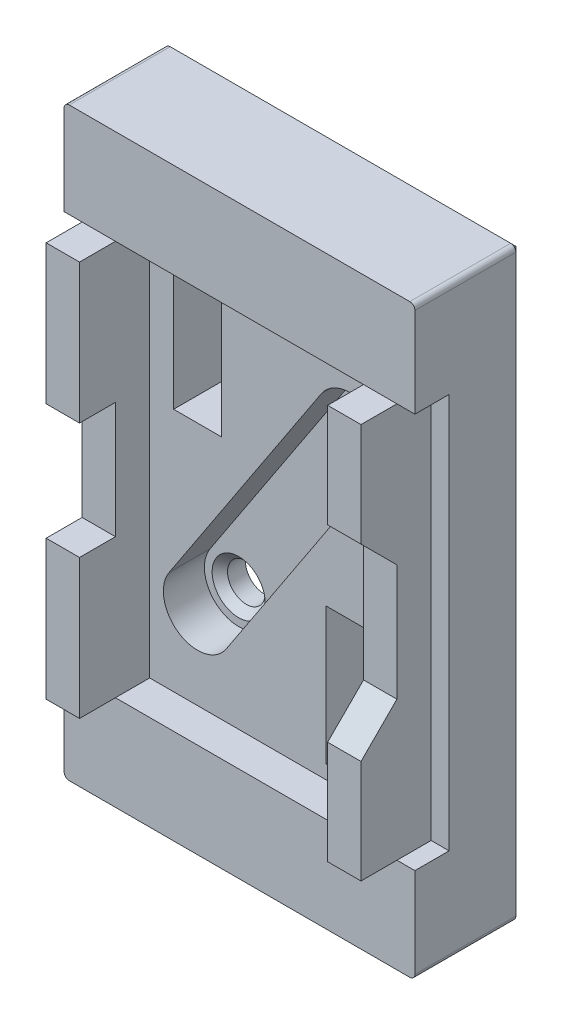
ISO-10303-21;
HEADER;
FILE_DESCRIPTION(('STEP AP214'),'2;1');
FILE_NAME('part.step','',(''),(''),'','','');
FILE_SCHEMA(('AUTOMOTIVE_DESIGN { 1 0 10303 214 1 1 1 1 }'));
ENDSEC;
DATA;
#1=APPLICATION_CONTEXT('core data for automotive mechanical design processes');
#2=APPLICATION_PROTOCOL_DEFINITION('international standard','automotive_design',2000,#1);
#3=PRODUCT_CONTEXT('',#1,'mechanical');
#4=PRODUCT('Part','Part','',(#3));
#5=PRODUCT_RELATED_PRODUCT_CATEGORY('part','',(#4));
#6=PRODUCT_DEFINITION_FORMATION('','',#4);
#7=PRODUCT_DEFINITION_CONTEXT('part definition',#1,'design');
#8=PRODUCT_DEFINITION('design','',#6,#7);
#9=PRODUCT_DEFINITION_SHAPE('','',#8);
#10=(LENGTH_UNIT() NAMED_UNIT(*) SI_UNIT(.MILLI.,.METRE.));
#11=(NAMED_UNIT(*) PLANE_ANGLE_UNIT() SI_UNIT($,.RADIAN.));
#12=(NAMED_UNIT(*) SI_UNIT($,.STERADIAN.) SOLID_ANGLE_UNIT());
#13=UNCERTAINTY_MEASURE_WITH_UNIT(LENGTH_MEASURE(1.E-05),#10,'distance_accuracy_value','');
#14=(GEOMETRIC_REPRESENTATION_CONTEXT(3) GLOBAL_UNCERTAINTY_ASSIGNED_CONTEXT((#13)) GLOBAL_UNIT_ASSIGNED_CONTEXT((#10,
#11,#12)) REPRESENTATION_CONTEXT('',''));
#15=CARTESIAN_POINT('',(0.,0.,0.));
#16=DIRECTION('',(0.,0.,1.));
#17=DIRECTION('',(1.,0.,0.));
#18=AXIS2_PLACEMENT_3D('',#15,#16,#17);
#19=CARTESIAN_POINT('',(4.45,-6.75,8.));
#20=DIRECTION('',(0.,0.,-1.));
#21=DIRECTION('',(-1.,0.,0.));
#22=AXIS2_PLACEMENT_3D('',#19,#20,#21);
#23=PLANE('',#22);
#24=DIRECTION('',(0.,-1.,0.));
#25=VECTOR('',#24,1.);
#26=CARTESIAN_POINT('',(-2.8,4.8,8.));
#27=LINE('',#26,#25);
#28=CARTESIAN_POINT('',(-2.8,-3.35,8.));
#29=VERTEX_POINT('',#28);
#30=CARTESIAN_POINT('',(-2.8,4.8,8.));
#31=VERTEX_POINT('',#30);
#32=EDGE_CURVE('E754',#29,#31,#27,.F.);
#33=ORIENTED_EDGE('',*,*,#32,.T.);
#34=DIRECTION('',(1.,0.,0.));
#35=VECTOR('',#34,1.);
#36=CARTESIAN_POINT('',(-4.75,4.8,8.));
#37=LINE('',#36,#35);
#38=CARTESIAN_POINT('',(-4.75,4.8,8.));
#39=VERTEX_POINT('',#38);
#40=EDGE_CURVE('E631',#31,#39,#37,.F.);
#41=ORIENTED_EDGE('',*,*,#40,.T.);
#42=DIRECTION('',(0.,1.,0.));
#43=VECTOR('',#42,1.);
#44=CARTESIAN_POINT('',(-4.75,-18.3,8.));
#45=LINE('',#44,#43);
#46=CARTESIAN_POINT('',(-4.75,-3.35,8.));
#47=VERTEX_POINT('',#46);
#48=EDGE_CURVE('E826',#39,#47,#45,.F.);
#49=ORIENTED_EDGE('',*,*,#48,.T.);
#50=DIRECTION('',(1.,0.,0.));
#51=VECTOR('',#50,1.);
#52=CARTESIAN_POINT('',(-36.2781229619,-3.35,8.));
#53=LINE('',#52,#51);
#54=EDGE_CURVE('E809',#29,#47,#53,.F.);
#55=ORIENTED_EDGE('',*,*,#54,.F.);
#56=EDGE_LOOP('',(#33,#41,#49,#55));
#57=FACE_BOUND('',#56,.T.);
#58=ADVANCED_FACE('F17',(#57),#23,.F.);
#59=CARTESIAN_POINT('',(4.45,-6.75,8.));
#60=DIRECTION('',(0.,0.,-1.));
#61=DIRECTION('',(-1.,0.,0.));
#62=AXIS2_PLACEMENT_3D('',#59,#60,#61);
#63=PLANE('',#62);
#64=DIRECTION('',(0.,1.,0.));
#65=VECTOR('',#64,1.);
#66=CARTESIAN_POINT('',(-4.75,-18.3,8.));
#67=LINE('',#66,#65);
#68=CARTESIAN_POINT('',(-4.75,-10.15,8.));
#69=VERTEX_POINT('',#68);
#70=CARTESIAN_POINT('',(-4.75,-18.3,8.));
#71=VERTEX_POINT('',#70);
#72=EDGE_CURVE('E829',#69,#71,#67,.F.);
#73=ORIENTED_EDGE('',*,*,#72,.T.);
#74=DIRECTION('',(-1.,0.,0.));
#75=VECTOR('',#74,1.);
#76=CARTESIAN_POINT('',(-2.8,-18.3,8.));
#77=LINE('',#76,#75);
#78=CARTESIAN_POINT('',(-2.8,-18.3,8.));
#79=VERTEX_POINT('',#78);
#80=EDGE_CURVE('E658',#71,#79,#77,.F.);
#81=ORIENTED_EDGE('',*,*,#80,.T.);
#82=DIRECTION('',(0.,-1.,0.));
#83=VECTOR('',#82,1.);
#84=CARTESIAN_POINT('',(-2.8,4.8,8.));
#85=LINE('',#84,#83);
#86=CARTESIAN_POINT('',(-2.8,-10.15,8.));
#87=VERTEX_POINT('',#86);
#88=EDGE_CURVE('E723',#79,#87,#85,.F.);
#89=ORIENTED_EDGE('',*,*,#88,.T.);
#90=DIRECTION('',(1.,0.,0.));
#91=VECTOR('',#90,1.);
#92=CARTESIAN_POINT('',(-36.2781229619,-10.15,8.));
#93=LINE('',#92,#91);
#94=EDGE_CURVE('E849',#69,#87,#93,.T.);
#95=ORIENTED_EDGE('',*,*,#94,.F.);
#96=EDGE_LOOP('',(#73,#81,#89,#95));
#97=FACE_BOUND('',#96,.T.);
#98=ADVANCED_FACE('F1862',(#97),#63,.F.);
#99=CARTESIAN_POINT('',(-36.2781229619,-10.15,5.9));
#100=DIRECTION('',(0.,1.,0.));
#101=DIRECTION('',(0.,0.,1.));
#102=AXIS2_PLACEMENT_3D('',#99,#100,#101);
#103=PLANE('',#102);
#104=DIRECTION('',(0.,0.,1.));
#105=VECTOR('',#104,1.);
#106=CARTESIAN_POINT('',(-4.75,-10.15,-32.7281229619));
#107=LINE('',#106,#105);
#108=CARTESIAN_POINT('',(-4.75,-10.15,5.9));
#109=VERTEX_POINT('',#108);
#110=EDGE_CURVE('E833',#109,#69,#107,.T.);
#111=ORIENTED_EDGE('',*,*,#110,.T.);
#112=ORIENTED_EDGE('',*,*,#94,.T.);
#113=DIRECTION('',(0.,0.,1.));
#114=VECTOR('',#113,1.);
#115=CARTESIAN_POINT('',(-2.8,-10.15,-32.7281229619));
#116=LINE('',#115,#114);
#117=CARTESIAN_POINT('',(-2.8,-10.15,5.9));
#118=VERTEX_POINT('',#117);
#119=EDGE_CURVE('E798',#87,#118,#116,.F.);
#120=ORIENTED_EDGE('',*,*,#119,.T.);
#121=DIRECTION('',(1.,0.,0.));
#122=VECTOR('',#121,1.);
#123=CARTESIAN_POINT('',(-36.2781229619,-10.15,5.9));
#124=LINE('',#123,#122);
#125=EDGE_CURVE('E811',#109,#118,#124,.T.);
#126=ORIENTED_EDGE('',*,*,#125,.F.);
#127=EDGE_LOOP('',(#111,#112,#120,#126));
#128=FACE_BOUND('',#127,.T.);
#129=ADVANCED_FACE('F1859',(#128),#103,.T.);
#130=CARTESIAN_POINT('',(-36.2781229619,-3.35,5.9));
#131=DIRECTION('',(0.,0.,1.));
#132=DIRECTION('',(0.,-1.,0.));
#133=AXIS2_PLACEMENT_3D('',#130,#131,#132);
#134=PLANE('',#133);
#135=DIRECTION('',(0.,1.,0.));
#136=VECTOR('',#135,1.);
#137=CARTESIAN_POINT('',(-4.75,-18.3,5.9));
#138=LINE('',#137,#136);
#139=CARTESIAN_POINT('',(-4.75,-3.35,5.9));
#140=VERTEX_POINT('',#139);
#141=EDGE_CURVE('E846',#140,#109,#138,.F.);
#142=ORIENTED_EDGE('',*,*,#141,.T.);
#143=ORIENTED_EDGE('',*,*,#125,.T.);
#144=DIRECTION('',(0.,-1.,0.));
#145=VECTOR('',#144,1.);
#146=CARTESIAN_POINT('',(-2.8,4.8,5.9));
#147=LINE('',#146,#145);
#148=CARTESIAN_POINT('',(-2.8,-3.35,5.9));
#149=VERTEX_POINT('',#148);
#150=EDGE_CURVE('E816',#118,#149,#147,.F.);
#151=ORIENTED_EDGE('',*,*,#150,.T.);
#152=DIRECTION('',(1.,0.,0.));
#153=VECTOR('',#152,1.);
#154=CARTESIAN_POINT('',(-36.2781229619,-3.35,5.9));
#155=LINE('',#154,#153);
#156=EDGE_CURVE('E787',#140,#149,#155,.T.);
#157=ORIENTED_EDGE('',*,*,#156,.F.);
#158=EDGE_LOOP('',(#142,#143,#151,#157));
#159=FACE_BOUND('',#158,.T.);
#160=ADVANCED_FACE('F1855',(#159),#134,.T.);
#161=CARTESIAN_POINT('',(-36.2781229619,-3.35,8.));
#162=DIRECTION('',(0.,-1.,0.));
#163=DIRECTION('',(0.,0.,-1.));
#164=AXIS2_PLACEMENT_3D('',#161,#162,#163);
#165=PLANE('',#164);
#166=DIRECTION('',(0.,0.,1.));
#167=VECTOR('',#166,1.);
#168=CARTESIAN_POINT('',(-4.75,-3.35,-32.7281229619));
#169=LINE('',#168,#167);
#170=EDGE_CURVE('E686',#47,#140,#169,.F.);
#171=ORIENTED_EDGE('',*,*,#170,.T.);
#172=ORIENTED_EDGE('',*,*,#156,.T.);
#173=DIRECTION('',(0.,0.,1.));
#174=VECTOR('',#173,1.);
#175=CARTESIAN_POINT('',(-2.8,-3.35,-32.7281229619));
#176=LINE('',#175,#174);
#177=EDGE_CURVE('E621',#149,#29,#176,.T.);
#178=ORIENTED_EDGE('',*,*,#177,.T.);
#179=ORIENTED_EDGE('',*,*,#54,.T.);
#180=EDGE_LOOP('',(#171,#172,#178,#179));
#181=FACE_BOUND('',#180,.T.);
#182=ADVANCED_FACE('F1851',(#181),#165,.T.);
#183=CARTESIAN_POINT('',(4.45,-6.75,8.));
#184=DIRECTION('',(0.,0.,1.));
#185=DIRECTION('',(1.,0.,0.));
#186=AXIS2_PLACEMENT_3D('',#183,#184,#185);
#187=PLANE('',#186);
#188=DIRECTION('',(0.,-1.,0.));
#189=VECTOR('',#188,1.);
#190=CARTESIAN_POINT('',(11.7,4.8,8.));
#191=LINE('',#190,#189);
#192=CARTESIAN_POINT('',(11.7,-18.3,8.));
#193=VERTEX_POINT('',#192);
#194=CARTESIAN_POINT('',(11.7,-12.25,8.));
#195=VERTEX_POINT('',#194);
#196=EDGE_CURVE('E620',#193,#195,#191,.F.);
#197=ORIENTED_EDGE('',*,*,#196,.F.);
#198=DIRECTION('',(1.,0.,0.));
#199=VECTOR('',#198,1.);
#200=CARTESIAN_POINT('',(11.7,-18.3,8.));
#201=LINE('',#200,#199);
#202=CARTESIAN_POINT('',(13.65,-18.3,8.));
#203=VERTEX_POINT('',#202);
#204=EDGE_CURVE('E659',#203,#193,#201,.F.);
#205=ORIENTED_EDGE('',*,*,#204,.F.);
#206=DIRECTION('',(0.,1.,0.));
#207=VECTOR('',#206,1.);
#208=CARTESIAN_POINT('',(13.65,-18.3,8.));
#209=LINE('',#208,#207);
#210=CARTESIAN_POINT('',(13.65,-12.25,8.));
#211=VERTEX_POINT('',#210);
#212=EDGE_CURVE('E823',#211,#203,#209,.F.);
#213=ORIENTED_EDGE('',*,*,#212,.F.);
#214=DIRECTION('',(1.,0.,0.));
#215=VECTOR('',#214,1.);
#216=CARTESIAN_POINT('',(45.178122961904,-12.25,8.));
#217=LINE('',#216,#215);
#218=EDGE_CURVE('E780',#195,#211,#217,.T.);
#219=ORIENTED_EDGE('',*,*,#218,.F.);
#220=EDGE_LOOP('',(#197,#205,#213,#219));
#221=FACE_BOUND('',#220,.T.);
#222=ADVANCED_FACE('F1847',(#221),#187,.T.);
#223=CARTESIAN_POINT('',(45.178122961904,-10.15,5.9));
#224=DIRECTION('',(0.,0.707106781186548,0.707106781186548));
#225=DIRECTION('',(0.,-0.707106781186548,0.707106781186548));
#226=AXIS2_PLACEMENT_3D('',#223,#224,#225);
#227=PLANE('',#226);
#228=DIRECTION('',(0.,-0.707106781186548,0.707106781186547));
#229=VECTOR('',#228,1.);
#230=CARTESIAN_POINT('',(13.65,-10.15,5.9));
#231=LINE('',#230,#229);
#232=CARTESIAN_POINT('',(13.65,-10.15,5.9));
#233=VERTEX_POINT('',#232);
#234=EDGE_CURVE('E837',#233,#211,#231,.T.);
#235=ORIENTED_EDGE('',*,*,#234,.F.);
#236=DIRECTION('',(1.,0.,0.));
#237=VECTOR('',#236,1.);
#238=CARTESIAN_POINT('',(45.178122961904,-10.15,5.9));
#239=LINE('',#238,#237);
#240=CARTESIAN_POINT('',(11.7,-10.15,5.9));
#241=VERTEX_POINT('',#240);
#242=EDGE_CURVE('E772',#233,#241,#239,.F.);
#243=ORIENTED_EDGE('',*,*,#242,.T.);
#244=DIRECTION('',(0.,0.707106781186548,-0.707106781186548));
#245=VECTOR('',#244,1.);
#246=CARTESIAN_POINT('',(11.7,-12.25,8.));
#247=LINE('',#246,#245);
#248=EDGE_CURVE('E737',#195,#241,#247,.T.);
#249=ORIENTED_EDGE('',*,*,#248,.F.);
#250=ORIENTED_EDGE('',*,*,#218,.T.);
#251=EDGE_LOOP('',(#235,#243,#249,#250));
#252=FACE_BOUND('',#251,.T.);
#253=ADVANCED_FACE('F1843',(#252),#227,.T.);
#254=CARTESIAN_POINT('',(45.178122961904,-3.35,5.9));
#255=DIRECTION('',(0.,0.,-1.));
#256=DIRECTION('',(0.,1.,0.));
#257=AXIS2_PLACEMENT_3D('',#254,#255,#256);
#258=PLANE('',#257);
#259=ORIENTED_EDGE('',*,*,#242,.F.);
#260=DIRECTION('',(0.,1.,0.));
#261=VECTOR('',#260,1.);
#262=CARTESIAN_POINT('',(13.65,-18.3,5.9));
#263=LINE('',#262,#261);
#264=CARTESIAN_POINT('',(13.65,-3.35,5.9));
#265=VERTEX_POINT('',#264);
#266=EDGE_CURVE('E763',#265,#233,#263,.F.);
#267=ORIENTED_EDGE('',*,*,#266,.F.);
#268=DIRECTION('',(1.,0.,0.));
#269=VECTOR('',#268,1.);
#270=CARTESIAN_POINT('',(45.178122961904,-3.35,5.9));
#271=LINE('',#270,#269);
#272=CARTESIAN_POINT('',(11.7,-3.35,5.9));
#273=VERTEX_POINT('',#272);
#274=EDGE_CURVE('E764',#273,#265,#271,.T.);
#275=ORIENTED_EDGE('',*,*,#274,.F.);
#276=DIRECTION('',(0.,-1.,0.));
#277=VECTOR('',#276,1.);
#278=CARTESIAN_POINT('',(11.7,4.8,5.9));
#279=LINE('',#278,#277);
#280=EDGE_CURVE('E768',#241,#273,#279,.F.);
#281=ORIENTED_EDGE('',*,*,#280,.F.);
#282=EDGE_LOOP('',(#259,#267,#275,#281));
#283=FACE_BOUND('',#282,.T.);
#284=ADVANCED_FACE('F1839',(#283),#258,.F.);
#285=CARTESIAN_POINT('',(45.178122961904,-3.35,5.9));
#286=DIRECTION('',(0.,-0.707106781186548,0.707106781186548));
#287=DIRECTION('',(0.,-0.707106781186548,-0.707106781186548));
#288=AXIS2_PLACEMENT_3D('',#285,#286,#287);
#289=PLANE('',#288);
#290=DIRECTION('',(0.,0.707106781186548,0.707106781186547));
#291=VECTOR('',#290,1.);
#292=CARTESIAN_POINT('',(11.7,-3.35,5.9));
#293=LINE('',#292,#291);
#294=CARTESIAN_POINT('',(11.7,-1.25,8.));
#295=VERTEX_POINT('',#294);
#296=EDGE_CURVE('E758',#273,#295,#293,.T.);
#297=ORIENTED_EDGE('',*,*,#296,.F.);
#298=ORIENTED_EDGE('',*,*,#274,.T.);
#299=DIRECTION('',(0.,-0.707106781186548,-0.707106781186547));
#300=VECTOR('',#299,1.);
#301=CARTESIAN_POINT('',(13.65,-1.25,8.));
#302=LINE('',#301,#300);
#303=CARTESIAN_POINT('',(13.65,-1.25,8.));
#304=VERTEX_POINT('',#303);
#305=EDGE_CURVE('E822',#304,#265,#302,.T.);
#306=ORIENTED_EDGE('',*,*,#305,.F.);
#307=DIRECTION('',(1.,0.,0.));
#308=VECTOR('',#307,1.);
#309=CARTESIAN_POINT('',(4.45,-1.25,8.));
#310=LINE('',#309,#308);
#311=EDGE_CURVE('E761',#295,#304,#310,.T.);
#312=ORIENTED_EDGE('',*,*,#311,.F.);
#313=EDGE_LOOP('',(#297,#298,#306,#312));
#314=FACE_BOUND('',#313,.T.);
#315=ADVANCED_FACE('F1835',(#314),#289,.T.);
#316=CARTESIAN_POINT('',(4.45,-6.75,8.));
#317=DIRECTION('',(0.,0.,1.));
#318=DIRECTION('',(1.,0.,0.));
#319=AXIS2_PLACEMENT_3D('',#316,#317,#318);
#320=PLANE('',#319);
#321=DIRECTION('',(0.,1.,0.));
#322=VECTOR('',#321,1.);
#323=CARTESIAN_POINT('',(13.65,-18.3,8.));
#324=LINE('',#323,#322);
#325=CARTESIAN_POINT('',(13.65,4.8,8.));
#326=VERTEX_POINT('',#325);
#327=EDGE_CURVE('E819',#326,#304,#324,.F.);
#328=ORIENTED_EDGE('',*,*,#327,.F.);
#329=DIRECTION('',(-1.,0.,0.));
#330=VECTOR('',#329,1.);
#331=CARTESIAN_POINT('',(13.65,4.8,8.));
#332=LINE('',#331,#330);
#333=CARTESIAN_POINT('',(11.7,4.8,8.));
#334=VERTEX_POINT('',#333);
#335=EDGE_CURVE('E608',#334,#326,#332,.F.);
#336=ORIENTED_EDGE('',*,*,#335,.F.);
#337=DIRECTION('',(0.,-1.,0.));
#338=VECTOR('',#337,1.);
#339=CARTESIAN_POINT('',(11.7,4.8,8.));
#340=LINE('',#339,#338);
#341=EDGE_CURVE('E742',#295,#334,#340,.F.);
#342=ORIENTED_EDGE('',*,*,#341,.F.);
#343=ORIENTED_EDGE('',*,*,#311,.T.);
#344=EDGE_LOOP('',(#328,#336,#342,#343));
#345=FACE_BOUND('',#344,.T.);
#346=ADVANCED_FACE('F1831',(#345),#320,.T.);
#347=CARTESIAN_POINT('',(4.45,-6.75,0.));
#348=DIRECTION('',(0.,0.,1.));
#349=DIRECTION('',(1.,0.,0.));
#350=AXIS2_PLACEMENT_3D('',#347,#348,#349);
#351=PLANE('',#350);
#352=DIRECTION('',(0.,1.,0.));
#353=VECTOR('',#352,1.);
#354=CARTESIAN_POINT('',(2.944307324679,-3.655948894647,0.));
#355=LINE('',#354,#353);
#356=CARTESIAN_POINT('',(2.94430732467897,-4.413403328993,0.));
#357=VERTEX_POINT('',#356);
#358=CARTESIAN_POINT('',(2.94430732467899,-3.65594889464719,0.));
#359=VERTEX_POINT('',#358);
#360=EDGE_CURVE('E916',#357,#359,#355,.T.);
#361=ORIENTED_EDGE('',*,*,#360,.T.);
#362=DIRECTION('',(0.998643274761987,-0.0520731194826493,0.));
#363=VECTOR('',#362,1.);
#364=CARTESIAN_POINT('',(5.955692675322,-3.812974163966,0.));
#365=LINE('',#364,#363);
#366=CARTESIAN_POINT('',(5.955692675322,-3.812974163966,0.));
#367=VERTEX_POINT('',#366);
#368=EDGE_CURVE('E995',#359,#367,#365,.T.);
#369=ORIENTED_EDGE('',*,*,#368,.T.);
#370=DIRECTION('',(0.,-1.,0.));
#371=VECTOR('',#370,1.);
#372=CARTESIAN_POINT('',(5.955692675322,-4.524277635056,0.));
#373=LINE('',#372,#371);
#374=CARTESIAN_POINT('',(5.95569267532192,-4.52427763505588,0.));
#375=VERTEX_POINT('',#374);
#376=EDGE_CURVE('E986',#367,#375,#373,.T.);
#377=ORIENTED_EDGE('',*,*,#376,.T.);
#378=DIRECTION('',(-0.834335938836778,-0.551256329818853,0.));
#379=VECTOR('',#378,1.);
#380=CARTESIAN_POINT('',(5.438419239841,-4.866046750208,0.));
#381=LINE('',#380,#379);
#382=CARTESIAN_POINT('',(5.43841923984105,-4.86604675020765,0.));
#383=VERTEX_POINT('',#382);
#384=EDGE_CURVE('E980',#375,#383,#381,.T.);
#385=ORIENTED_EDGE('',*,*,#384,.T.);
#386=DIRECTION('',(0.989944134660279,-0.14145886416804,0.));
#387=VECTOR('',#386,1.);
#388=CARTESIAN_POINT('',(5.955692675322,-4.939962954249,0.));
#389=LINE('',#388,#387);
#390=CARTESIAN_POINT('',(5.955692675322,-4.939962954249,0.));
#391=VERTEX_POINT('',#390);
#392=EDGE_CURVE('E974',#383,#391,#389,.T.);
#393=ORIENTED_EDGE('',*,*,#392,.T.);
#394=DIRECTION('',(0.,-1.,0.));
#395=VECTOR('',#394,1.);
#396=CARTESIAN_POINT('',(5.955692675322,-5.715896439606,0.));
#397=LINE('',#396,#395);
#398=CARTESIAN_POINT('',(5.95569267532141,-5.715896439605,0.));
#399=VERTEX_POINT('',#398);
#400=EDGE_CURVE('E968',#391,#399,#397,.T.);
#401=ORIENTED_EDGE('',*,*,#400,.T.);
#402=DIRECTION('',(-0.862812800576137,-0.50552356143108,0.));
#403=VECTOR('',#402,1.);
#404=CARTESIAN_POINT('',(2.944307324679,-7.480272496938,0.));
#405=LINE('',#404,#403);
#406=CARTESIAN_POINT('',(2.944307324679,-7.480272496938,0.));
#407=VERTEX_POINT('',#406);
#408=EDGE_CURVE('E962',#399,#407,#405,.T.);
#409=ORIENTED_EDGE('',*,*,#408,.T.);
#410=DIRECTION('',(0.,1.,0.));
#411=VECTOR('',#410,1.);
#412=CARTESIAN_POINT('',(2.944307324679,-6.63042280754,0.));
#413=LINE('',#412,#411);
#414=CARTESIAN_POINT('',(2.94430732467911,-6.63042280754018,0.));
#415=VERTEX_POINT('',#414);
#416=EDGE_CURVE('E956',#407,#415,#413,.T.);
#417=ORIENTED_EDGE('',*,*,#416,.T.);
#418=DIRECTION('',(0.858817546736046,0.512281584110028,0.));
#419=VECTOR('',#418,1.);
#420=CARTESIAN_POINT('',(4.523939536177,-5.68817786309,0.));
#421=LINE('',#420,#419);
#422=CARTESIAN_POINT('',(4.52393953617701,-5.68817786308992,0.));
#423=VERTEX_POINT('',#422);
#424=EDGE_CURVE('E950',#415,#423,#421,.T.);
#425=ORIENTED_EDGE('',*,*,#424,.T.);
#426=DIRECTION('',(-0.985344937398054,0.170573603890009,0.));
#427=VECTOR('',#426,1.);
#428=CARTESIAN_POINT('',(4.043577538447,-5.605022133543,0.));
#429=LINE('',#428,#427);
#430=CARTESIAN_POINT('',(4.043577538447,-5.605022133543,0.));
#431=VERTEX_POINT('',#430);
#432=EDGE_CURVE('E944',#423,#431,#429,.T.);
#433=ORIENTED_EDGE('',*,*,#432,.T.);
#434=DIRECTION('',(0.,1.,0.));
#435=VECTOR('',#434,1.);
#436=CARTESIAN_POINT('',(4.043577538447,-4.819849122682,0.));
#437=LINE('',#436,#435);
#438=CARTESIAN_POINT('',(4.04357753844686,-4.81984912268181,0.));
#439=VERTEX_POINT('',#438);
#440=EDGE_CURVE('E938',#431,#439,#437,.T.);
#441=ORIENTED_EDGE('',*,*,#440,.T.);
#442=DIRECTION('',(0.812281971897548,0.583264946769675,0.));
#443=VECTOR('',#442,1.);
#444=CARTESIAN_POINT('',(4.506673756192,-4.487319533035,0.));
#445=LINE('',#444,#443);
#446=CARTESIAN_POINT('',(4.50667375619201,-4.4873195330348,0.));
#447=VERTEX_POINT('',#446);
#448=EDGE_CURVE('E932',#439,#447,#445,.T.);
#449=ORIENTED_EDGE('',*,*,#448,.T.);
#450=DIRECTION('',(-0.998882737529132,0.0472575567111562,0.));
#451=VECTOR('',#450,1.);
#452=CARTESIAN_POINT('',(2.944307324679,-4.413403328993,0.));
#453=LINE('',#452,#451);
#454=EDGE_CURVE('E926',#447,#357,#453,.T.);
#455=ORIENTED_EDGE('',*,*,#454,.T.);
#456=EDGE_LOOP('',(#361,#369,#377,#385,#393,#401,#409,#417,#425,#433,#441,#449,#455));
#457=FACE_BOUND('',#456,.T.);
#458=ADVANCED_FACE('F1827',(#457),#351,.F.);
#459=CARTESIAN_POINT('',(4.45,-6.75,0.));
#460=DIRECTION('',(0.,0.,1.));
#461=DIRECTION('',(1.,0.,0.));
#462=AXIS2_PLACEMENT_3D('',#459,#460,#461);
#463=PLANE('',#462);
#464=DIRECTION('',(-0.86396675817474,-0.503548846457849,0.));
#465=VECTOR('',#464,1.);
#466=CARTESIAN_POINT('',(2.944307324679,-7.692921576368,0.));
#467=LINE('',#466,#465);
#468=CARTESIAN_POINT('',(5.95569267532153,-5.93778504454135,0.));
#469=VERTEX_POINT('',#468);
#470=CARTESIAN_POINT('',(2.944307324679,-7.692921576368,0.));
#471=VERTEX_POINT('',#470);
#472=EDGE_CURVE('E1050',#469,#471,#467,.T.);
#473=ORIENTED_EDGE('',*,*,#472,.F.);
#474=DIRECTION('',(3.645766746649E-13,1.,0.));
#475=VECTOR('',#474,1.);
#476=CARTESIAN_POINT('',(5.955692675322,-5.937785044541,0.));
#477=LINE('',#476,#475);
#478=CARTESIAN_POINT('',(5.95569267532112,-8.06968889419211,0.));
#479=VERTEX_POINT('',#478);
#480=EDGE_CURVE('E1045',#479,#469,#477,.T.);
#481=ORIENTED_EDGE('',*,*,#480,.F.);
#482=DIRECTION('',(0.86064662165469,0.509202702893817,0.));
#483=VECTOR('',#482,1.);
#484=CARTESIAN_POINT('',(5.955692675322,-8.069688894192,0.));
#485=LINE('',#484,#483);
#486=CARTESIAN_POINT('',(5.22124372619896,-8.50422657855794,0.));
#487=VERTEX_POINT('',#486);
#488=EDGE_CURVE('E1040',#487,#479,#485,.T.);
#489=ORIENTED_EDGE('',*,*,#488,.F.);
#490=DIRECTION('',(0.,-1.,0.));
#491=VECTOR('',#490,1.);
#492=CARTESIAN_POINT('',(5.221243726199,-8.504226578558,0.));
#493=LINE('',#492,#491);
#494=CARTESIAN_POINT('',(5.221243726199,-7.228892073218,0.));
#495=VERTEX_POINT('',#494);
#496=EDGE_CURVE('E1035',#495,#487,#493,.T.);
#497=ORIENTED_EDGE('',*,*,#496,.F.);
#498=DIRECTION('',(0.861792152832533,0.507261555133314,0.));
#499=VECTOR('',#498,1.);
#500=CARTESIAN_POINT('',(5.221243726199,-7.228892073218,0.));
#501=LINE('',#500,#499);
#502=CARTESIAN_POINT('',(4.79179244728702,-7.48167242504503,0.));
#503=VERTEX_POINT('',#502);
#504=EDGE_CURVE('E1030',#503,#495,#501,.T.);
#505=ORIENTED_EDGE('',*,*,#504,.F.);
#506=DIRECTION('',(0.,1.,0.));
#507=VECTOR('',#506,1.);
#508=CARTESIAN_POINT('',(4.791792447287,-7.481672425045,0.));
#509=LINE('',#508,#507);
#510=CARTESIAN_POINT('',(4.791792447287,-8.756446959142,0.));
#511=VERTEX_POINT('',#510);
#512=EDGE_CURVE('E1025',#511,#503,#509,.T.);
#513=ORIENTED_EDGE('',*,*,#512,.F.);
#514=DIRECTION('',(0.863126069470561,0.504988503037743,0.));
#515=VECTOR('',#514,1.);
#516=CARTESIAN_POINT('',(4.791792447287,-8.756446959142,0.));
#517=LINE('',#516,#515);
#518=CARTESIAN_POINT('',(4.04357753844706,-9.19420447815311,0.));
#519=VERTEX_POINT('',#518);
#520=EDGE_CURVE('E1020',#519,#511,#517,.T.);
#521=ORIENTED_EDGE('',*,*,#520,.F.);
#522=DIRECTION('',(0.,-1.,0.));
#523=VECTOR('',#522,1.);
#524=CARTESIAN_POINT('',(4.043577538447,-9.194204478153,0.));
#525=LINE('',#524,#523);
#526=CARTESIAN_POINT('',(4.043577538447,-7.924982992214,0.));
#527=VERTEX_POINT('',#526);
#528=EDGE_CURVE('E1015',#527,#519,#525,.T.);
#529=ORIENTED_EDGE('',*,*,#528,.F.);
#530=DIRECTION('',(0.854372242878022,0.519661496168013,0.));
#531=VECTOR('',#530,1.);
#532=CARTESIAN_POINT('',(4.043577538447,-7.924982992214,0.));
#533=LINE('',#532,#531);
#534=CARTESIAN_POINT('',(3.6935021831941,-8.13791205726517,0.));
#535=VERTEX_POINT('',#534);
#536=EDGE_CURVE('E1010',#535,#527,#533,.T.);
#537=ORIENTED_EDGE('',*,*,#536,.F.);
#538=DIRECTION('',(0.,1.,0.));
#539=VECTOR('',#538,1.);
#540=CARTESIAN_POINT('',(3.693502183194,-8.137912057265,0.));
#541=LINE('',#540,#539);
#542=CARTESIAN_POINT('',(3.693502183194,-9.403073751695,0.));
#543=VERTEX_POINT('',#542);
#544=EDGE_CURVE('E1005',#543,#535,#541,.T.);
#545=ORIENTED_EDGE('',*,*,#544,.F.);
#546=DIRECTION('',(0.861796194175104,0.507254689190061,0.));
#547=VECTOR('',#546,1.);
#548=CARTESIAN_POINT('',(3.693502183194,-9.403073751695,0.));
#549=LINE('',#548,#547);
#550=CARTESIAN_POINT('',(2.94430732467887,-9.84405110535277,0.));
#551=VERTEX_POINT('',#550);
#552=EDGE_CURVE('E1000',#551,#543,#549,.T.);
#553=ORIENTED_EDGE('',*,*,#552,.F.);
#554=DIRECTION('',(0.,-1.,0.));
#555=VECTOR('',#554,1.);
#556=CARTESIAN_POINT('',(2.944307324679,-9.844051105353,0.));
#557=LINE('',#556,#555);
#558=EDGE_CURVE('E998',#471,#551,#557,.T.);
#559=ORIENTED_EDGE('',*,*,#558,.F.);
#560=EDGE_LOOP('',(#473,#481,#489,#497,#505,#513,#521,#529,#537,#545,#553,#559));
#561=FACE_BOUND('',#560,.T.);
#562=ADVANCED_FACE('F1823',(#561),#463,.F.);
#563=CARTESIAN_POINT('',(13.65,-18.3,-32.7281229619));
#564=DIRECTION('',(1.,0.,0.));
#565=DIRECTION('',(0.,1.,0.));
#566=AXIS2_PLACEMENT_3D('',#563,#564,#565);
#567=PLANE('',#566);
#568=ORIENTED_EDGE('',*,*,#327,.T.);
#569=ORIENTED_EDGE('',*,*,#305,.T.);
#570=ORIENTED_EDGE('',*,*,#266,.T.);
#571=ORIENTED_EDGE('',*,*,#234,.T.);
#572=ORIENTED_EDGE('',*,*,#212,.T.);
#573=DIRECTION('',(0.,0.,1.));
#574=VECTOR('',#573,1.);
#575=CARTESIAN_POINT('',(13.65,-18.3,-32.7281229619));
#576=LINE('',#575,#574);
#577=CARTESIAN_POINT('',(13.65,-18.3,5.9));
#578=VERTEX_POINT('',#577);
#579=EDGE_CURVE('E683',#578,#203,#576,.T.);
#580=ORIENTED_EDGE('',*,*,#579,.F.);
#581=DIRECTION('',(0.,0.,1.));
#582=VECTOR('',#581,1.);
#583=CARTESIAN_POINT('',(13.65,-18.3,44.628122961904));
#584=LINE('',#583,#582);
#585=CARTESIAN_POINT('',(13.65,-18.3,3.9));
#586=VERTEX_POINT('',#585);
#587=EDGE_CURVE('E689',#586,#578,#584,.T.);
#588=ORIENTED_EDGE('',*,*,#587,.F.);
#589=DIRECTION('',(0.,1.,0.));
#590=VECTOR('',#589,1.);
#591=CARTESIAN_POINT('',(13.65,-6.75,3.9));
#592=LINE('',#591,#590);
#593=CARTESIAN_POINT('',(13.65,4.8,3.9));
#594=VERTEX_POINT('',#593);
#595=EDGE_CURVE('E691',#594,#586,#592,.F.);
#596=ORIENTED_EDGE('',*,*,#595,.F.);
#597=DIRECTION('',(0.,0.,1.));
#598=VECTOR('',#597,1.);
#599=CARTESIAN_POINT('',(13.65,4.8,44.628122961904));
#600=LINE('',#599,#598);
#601=CARTESIAN_POINT('',(13.65,4.8,5.9));
#602=VERTEX_POINT('',#601);
#603=EDGE_CURVE('E593',#602,#594,#600,.F.);
#604=ORIENTED_EDGE('',*,*,#603,.F.);
#605=DIRECTION('',(0.,0.,1.));
#606=VECTOR('',#605,1.);
#607=CARTESIAN_POINT('',(13.65,4.8,-32.7281229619));
#608=LINE('',#607,#606);
#609=EDGE_CURVE('E606',#326,#602,#608,.F.);
#610=ORIENTED_EDGE('',*,*,#609,.F.);
#611=EDGE_LOOP('',(#568,#569,#570,#571,#572,#580,#588,#596,#604,#610));
#612=FACE_BOUND('',#611,.T.);
#613=ADVANCED_FACE('F1819',(#612),#567,.T.);
#614=CARTESIAN_POINT('',(-4.75,-18.3,-32.7281229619));
#615=DIRECTION('',(1.,0.,0.));
#616=DIRECTION('',(0.,1.,0.));
#617=AXIS2_PLACEMENT_3D('',#614,#615,#616);
#618=PLANE('',#617);
#619=ORIENTED_EDGE('',*,*,#48,.F.);
#620=DIRECTION('',(0.,0.,1.));
#621=VECTOR('',#620,1.);
#622=CARTESIAN_POINT('',(-4.75,4.8,-32.7281229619));
#623=LINE('',#622,#621);
#624=CARTESIAN_POINT('',(-4.75,4.8,5.9));
#625=VERTEX_POINT('',#624);
#626=EDGE_CURVE('E609',#39,#625,#623,.F.);
#627=ORIENTED_EDGE('',*,*,#626,.T.);
#628=DIRECTION('',(0.,0.,1.));
#629=VECTOR('',#628,1.);
#630=CARTESIAN_POINT('',(-4.75,4.8,44.628122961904));
#631=LINE('',#630,#629);
#632=CARTESIAN_POINT('',(-4.75,4.8,3.9));
#633=VERTEX_POINT('',#632);
#634=EDGE_CURVE('E634',#625,#633,#631,.F.);
#635=ORIENTED_EDGE('',*,*,#634,.T.);
#636=DIRECTION('',(0.,1.,0.));
#637=VECTOR('',#636,1.);
#638=CARTESIAN_POINT('',(-4.75,-6.75,3.9));
#639=LINE('',#638,#637);
#640=CARTESIAN_POINT('',(-4.75,-18.3,3.9));
#641=VERTEX_POINT('',#640);
#642=EDGE_CURVE('E637',#633,#641,#639,.F.);
#643=ORIENTED_EDGE('',*,*,#642,.T.);
#644=DIRECTION('',(0.,0.,1.));
#645=VECTOR('',#644,1.);
#646=CARTESIAN_POINT('',(-4.75,-18.3,44.628122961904));
#647=LINE('',#646,#645);
#648=CARTESIAN_POINT('',(-4.75,-18.3,5.9));
#649=VERTEX_POINT('',#648);
#650=EDGE_CURVE('E641',#641,#649,#647,.T.);
#651=ORIENTED_EDGE('',*,*,#650,.T.);
#652=DIRECTION('',(0.,0.,1.));
#653=VECTOR('',#652,1.);
#654=CARTESIAN_POINT('',(-4.75,-18.3,-32.7281229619));
#655=LINE('',#654,#653);
#656=EDGE_CURVE('E655',#649,#71,#655,.T.);
#657=ORIENTED_EDGE('',*,*,#656,.T.);
#658=ORIENTED_EDGE('',*,*,#72,.F.);
#659=ORIENTED_EDGE('',*,*,#110,.F.);
#660=ORIENTED_EDGE('',*,*,#141,.F.);
#661=ORIENTED_EDGE('',*,*,#170,.F.);
#662=EDGE_LOOP('',(#619,#627,#635,#643,#651,#657,#658,#659,#660,#661));
#663=FACE_BOUND('',#662,.T.);
#664=ADVANCED_FACE('F1815',(#663),#618,.F.);
#665=CARTESIAN_POINT('',(11.7,-18.3,-32.7281229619));
#666=DIRECTION('',(0.,-1.,0.));
#667=DIRECTION('',(1.,0.,0.));
#668=AXIS2_PLACEMENT_3D('',#665,#666,#667);
#669=PLANE('',#668);
#670=ORIENTED_EDGE('',*,*,#579,.T.);
#671=ORIENTED_EDGE('',*,*,#204,.T.);
#672=DIRECTION('',(0.,0.,1.));
#673=VECTOR('',#672,1.);
#674=CARTESIAN_POINT('',(11.7,-18.3,-32.7281229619));
#675=LINE('',#674,#673);
#676=CARTESIAN_POINT('',(11.7,-18.3,5.9));
#677=VERTEX_POINT('',#676);
#678=EDGE_CURVE('E671',#677,#193,#675,.T.);
#679=ORIENTED_EDGE('',*,*,#678,.F.);
#680=DIRECTION('',(1.,0.,0.));
#681=VECTOR('',#680,1.);
#682=CARTESIAN_POINT('',(4.45,-18.3,5.9));
#683=LINE('',#682,#681);
#684=EDGE_CURVE('E664',#578,#677,#683,.F.);
#685=ORIENTED_EDGE('',*,*,#684,.F.);
#686=EDGE_LOOP('',(#670,#671,#679,#685));
#687=FACE_BOUND('',#686,.T.);
#688=ADVANCED_FACE('F1811',(#687),#669,.T.);
#689=CARTESIAN_POINT('',(-2.8,-18.3,-32.7281229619));
#690=DIRECTION('',(0.,1.,0.));
#691=DIRECTION('',(-1.,0.,0.));
#692=AXIS2_PLACEMENT_3D('',#689,#690,#691);
#693=PLANE('',#692);
#694=DIRECTION('',(0.,0.,1.));
#695=VECTOR('',#694,1.);
#696=CARTESIAN_POINT('',(-2.8,-18.3,-32.7281229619));
#697=LINE('',#696,#695);
#698=CARTESIAN_POINT('',(-2.8,-18.3,5.9));
#699=VERTEX_POINT('',#698);
#700=EDGE_CURVE('E720',#699,#79,#697,.T.);
#701=ORIENTED_EDGE('',*,*,#700,.T.);
#702=ORIENTED_EDGE('',*,*,#80,.F.);
#703=ORIENTED_EDGE('',*,*,#656,.F.);
#704=DIRECTION('',(1.,0.,0.));
#705=VECTOR('',#704,1.);
#706=CARTESIAN_POINT('',(4.45,-18.3,5.9));
#707=LINE('',#706,#705);
#708=EDGE_CURVE('E648',#699,#649,#707,.F.);
#709=ORIENTED_EDGE('',*,*,#708,.F.);
#710=EDGE_LOOP('',(#701,#702,#703,#709));
#711=FACE_BOUND('',#710,.T.);
#712=ADVANCED_FACE('F1807',(#711),#693,.F.);
#713=CARTESIAN_POINT('',(-4.75,4.8,-32.7281229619));
#714=DIRECTION('',(0.,-1.,0.));
#715=DIRECTION('',(1.,0.,0.));
#716=AXIS2_PLACEMENT_3D('',#713,#714,#715);
#717=PLANE('',#716);
#718=ORIENTED_EDGE('',*,*,#626,.F.);
#719=ORIENTED_EDGE('',*,*,#40,.F.);
#720=DIRECTION('',(0.,0.,1.));
#721=VECTOR('',#720,1.);
#722=CARTESIAN_POINT('',(-2.8,4.8,-32.7281229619));
#723=LINE('',#722,#721);
#724=CARTESIAN_POINT('',(-2.8,4.8,5.9));
#725=VERTEX_POINT('',#724);
#726=EDGE_CURVE('E724',#31,#725,#723,.F.);
#727=ORIENTED_EDGE('',*,*,#726,.T.);
#728=DIRECTION('',(1.,0.,0.));
#729=VECTOR('',#728,1.);
#730=CARTESIAN_POINT('',(4.45,4.8,5.9));
#731=LINE('',#730,#729);
#732=EDGE_CURVE('E614',#625,#725,#731,.T.);
#733=ORIENTED_EDGE('',*,*,#732,.F.);
#734=EDGE_LOOP('',(#718,#719,#727,#733));
#735=FACE_BOUND('',#734,.T.);
#736=ADVANCED_FACE('F1803',(#735),#717,.F.);
#737=CARTESIAN_POINT('',(13.65,4.8,-32.7281229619));
#738=DIRECTION('',(0.,1.,0.));
#739=DIRECTION('',(-1.,0.,0.));
#740=AXIS2_PLACEMENT_3D('',#737,#738,#739);
#741=PLANE('',#740);
#742=DIRECTION('',(0.,0.,1.));
#743=VECTOR('',#742,1.);
#744=CARTESIAN_POINT('',(11.7,4.8,-32.7281229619));
#745=LINE('',#744,#743);
#746=CARTESIAN_POINT('',(11.7,4.8,5.9));
#747=VERTEX_POINT('',#746);
#748=EDGE_CURVE('E740',#334,#747,#745,.F.);
#749=ORIENTED_EDGE('',*,*,#748,.F.);
#750=ORIENTED_EDGE('',*,*,#335,.T.);
#751=ORIENTED_EDGE('',*,*,#609,.T.);
#752=DIRECTION('',(1.,0.,0.));
#753=VECTOR('',#752,1.);
#754=CARTESIAN_POINT('',(4.45,4.8,5.9));
#755=LINE('',#754,#753);
#756=EDGE_CURVE('E599',#747,#602,#755,.T.);
#757=ORIENTED_EDGE('',*,*,#756,.F.);
#758=EDGE_LOOP('',(#749,#750,#751,#757));
#759=FACE_BOUND('',#758,.T.);
#760=ADVANCED_FACE('F1799',(#759),#741,.T.);
#761=CARTESIAN_POINT('',(8.9,0.,1.5));
#762=DIRECTION('',(0.,0.,-1.));
#763=DIRECTION('',(-1.,0.,0.));
#764=AXIS2_PLACEMENT_3D('',#761,#762,#763);
#765=PLANE('',#764);
#766=CARTESIAN_POINT('',(0.,-13.5,1.49999999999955));
#767=DIRECTION('',(0.,0.,1.));
#768=DIRECTION('',(1.,0.,0.));
#769=AXIS2_PLACEMENT_3D('',#766,#767,#768);
#770=CIRCLE('',#769,1.54999999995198);
#771=CARTESIAN_POINT('',(1.54999999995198,-13.5,1.49999999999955));
#772=VERTEX_POINT('',#771);
#773=EDGE_CURVE('E730',#772,#772,#770,.F.);
#774=ORIENTED_EDGE('',*,*,#773,.T.);
#775=EDGE_LOOP('',(#774));
#776=FACE_BOUND('',#775,.T.);
#777=CARTESIAN_POINT('',(8.9,0.,1.50000000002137));
#778=DIRECTION('',(0.,0.,1.));
#779=DIRECTION('',(1.,0.,0.));
#780=AXIS2_PLACEMENT_3D('',#777,#778,#779);
#781=CIRCLE('',#780,1.54999999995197);
#782=CARTESIAN_POINT('',(10.449999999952,0.,1.50000000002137));
#783=VERTEX_POINT('',#782);
#784=EDGE_CURVE('E899',#783,#783,#781,.F.);
#785=ORIENTED_EDGE('',*,*,#784,.T.);
#786=EDGE_LOOP('',(#785));
#787=FACE_BOUND('',#786,.T.);
#788=DIRECTION('',(-0.550411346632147,-0.834893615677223,0.));
#789=VECTOR('',#788,1.);
#790=CARTESIAN_POINT('',(7.230212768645,1.100822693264,1.49999999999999));
#791=LINE('',#790,#789);
#792=CARTESIAN_POINT('',(7.23021276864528,1.10082269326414,1.5));
#793=VERTEX_POINT('',#792);
#794=CARTESIAN_POINT('',(-1.66978723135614,-12.3991773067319,1.5));
#795=VERTEX_POINT('',#794);
#796=EDGE_CURVE('E565',#793,#795,#791,.T.);
#797=ORIENTED_EDGE('',*,*,#796,.T.);
#798=CARTESIAN_POINT('',(0.,-13.5,1.5));
#799=DIRECTION('',(0.,0.,-1.));
#800=DIRECTION('',(-1.,0.,0.));
#801=AXIS2_PLACEMENT_3D('',#798,#799,#800);
#802=CIRCLE('',#801,2.);
#803=CARTESIAN_POINT('',(1.66978723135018,-14.6008226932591,1.49999999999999));
#804=VERTEX_POINT('',#803);
#805=EDGE_CURVE('E20',#795,#804,#802,.F.);
#806=ORIENTED_EDGE('',*,*,#805,.T.);
#807=DIRECTION('',(0.550411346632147,0.834893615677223,0.));
#808=VECTOR('',#807,1.);
#809=CARTESIAN_POINT('',(10.569787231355,-1.100822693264,1.49999999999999));
#810=LINE('',#809,#808);
#811=CARTESIAN_POINT('',(10.5697872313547,-1.10082269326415,1.5));
#812=VERTEX_POINT('',#811);
#813=EDGE_CURVE('E569',#804,#812,#810,.T.);
#814=ORIENTED_EDGE('',*,*,#813,.T.);
#815=CARTESIAN_POINT('',(8.9,0.,1.5));
#816=DIRECTION('',(0.,0.,-1.));
#817=DIRECTION('',(-1.,0.,0.));
#818=AXIS2_PLACEMENT_3D('',#815,#816,#817);
#819=CIRCLE('',#818,2.);
#820=EDGE_CURVE('E915',#812,#793,#819,.F.);
#821=ORIENTED_EDGE('',*,*,#820,.T.);
#822=EDGE_LOOP('',(#797,#806,#814,#821));
#823=FACE_BOUND('',#822,.T.);
#824=ADVANCED_FACE('F568',(#776,#787,#823),#765,.F.);
#825=CARTESIAN_POINT('',(-2.8,4.8,-32.7281229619));
#826=DIRECTION('',(-1.,0.,0.));
#827=DIRECTION('',(0.,-1.,0.));
#828=AXIS2_PLACEMENT_3D('',#825,#826,#827);
#829=PLANE('',#828);
#830=ORIENTED_EDGE('',*,*,#150,.F.);
#831=ORIENTED_EDGE('',*,*,#119,.F.);
#832=ORIENTED_EDGE('',*,*,#88,.F.);
#833=ORIENTED_EDGE('',*,*,#700,.F.);
#834=DIRECTION('',(0.,0.,1.));
#835=VECTOR('',#834,1.);
#836=CARTESIAN_POINT('',(-2.8,-18.3,44.628122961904));
#837=LINE('',#836,#835);
#838=CARTESIAN_POINT('',(-2.8,-18.3,3.9));
#839=VERTEX_POINT('',#838);
#840=EDGE_CURVE('E667',#699,#839,#837,.F.);
#841=ORIENTED_EDGE('',*,*,#840,.T.);
#842=DIRECTION('',(0.,1.,0.));
#843=VECTOR('',#842,1.);
#844=CARTESIAN_POINT('',(-2.8,-6.75,3.9));
#845=LINE('',#844,#843);
#846=CARTESIAN_POINT('',(-2.8,4.8,3.9));
#847=VERTEX_POINT('',#846);
#848=EDGE_CURVE('E727',#839,#847,#845,.T.);
#849=ORIENTED_EDGE('',*,*,#848,.T.);
#850=DIRECTION('',(0.,0.,1.));
#851=VECTOR('',#850,1.);
#852=CARTESIAN_POINT('',(-2.8,4.8,44.628122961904));
#853=LINE('',#852,#851);
#854=EDGE_CURVE('E617',#847,#725,#853,.T.);
#855=ORIENTED_EDGE('',*,*,#854,.T.);
#856=ORIENTED_EDGE('',*,*,#726,.F.);
#857=ORIENTED_EDGE('',*,*,#32,.F.);
#858=ORIENTED_EDGE('',*,*,#177,.F.);
#859=EDGE_LOOP('',(#830,#831,#832,#833,#841,#849,#855,#856,#857,#858));
#860=FACE_BOUND('',#859,.T.);
#861=ADVANCED_FACE('F1792',(#860),#829,.F.);
#862=CARTESIAN_POINT('',(-2.8,4.8,44.628122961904));
#863=DIRECTION('',(0.,1.,0.));
#864=DIRECTION('',(-1.,0.,0.));
#865=AXIS2_PLACEMENT_3D('',#862,#863,#864);
#866=PLANE('',#865);
#867=ORIENTED_EDGE('',*,*,#854,.F.);
#868=DIRECTION('',(-1.,0.,0.));
#869=VECTOR('',#868,1.);
#870=CARTESIAN_POINT('',(4.45,4.8,3.9));
#871=LINE('',#870,#869);
#872=CARTESIAN_POINT('',(11.7,4.8,3.9));
#873=VERTEX_POINT('',#872);
#874=EDGE_CURVE('E717',#847,#873,#871,.F.);
#875=ORIENTED_EDGE('',*,*,#874,.T.);
#876=DIRECTION('',(0.,0.,1.));
#877=VECTOR('',#876,1.);
#878=CARTESIAN_POINT('',(11.7,4.8,-32.7281229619));
#879=LINE('',#878,#877);
#880=EDGE_CURVE('E705',#747,#873,#879,.F.);
#881=ORIENTED_EDGE('',*,*,#880,.F.);
#882=DIRECTION('',(1.,0.,0.));
#883=VECTOR('',#882,1.);
#884=CARTESIAN_POINT('',(4.45,4.8,5.9));
#885=LINE('',#884,#883);
#886=EDGE_CURVE('E603',#725,#747,#885,.T.);
#887=ORIENTED_EDGE('',*,*,#886,.F.);
#888=EDGE_LOOP('',(#867,#875,#881,#887));
#889=FACE_BOUND('',#888,.T.);
#890=ADVANCED_FACE('F1788',(#889),#866,.F.);
#891=CARTESIAN_POINT('',(11.7,4.8,-32.7281229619));
#892=DIRECTION('',(-1.,0.,0.));
#893=DIRECTION('',(0.,-1.,0.));
#894=AXIS2_PLACEMENT_3D('',#891,#892,#893);
#895=PLANE('',#894);
#896=DIRECTION('',(0.,0.,1.));
#897=VECTOR('',#896,1.);
#898=CARTESIAN_POINT('',(11.7,-18.3,44.628122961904));
#899=LINE('',#898,#897);
#900=CARTESIAN_POINT('',(11.7,-18.3,3.9));
#901=VERTEX_POINT('',#900);
#902=EDGE_CURVE('E670',#901,#677,#899,.T.);
#903=ORIENTED_EDGE('',*,*,#902,.T.);
#904=ORIENTED_EDGE('',*,*,#678,.T.);
#905=ORIENTED_EDGE('',*,*,#196,.T.);
#906=ORIENTED_EDGE('',*,*,#248,.T.);
#907=ORIENTED_EDGE('',*,*,#280,.T.);
#908=ORIENTED_EDGE('',*,*,#296,.T.);
#909=ORIENTED_EDGE('',*,*,#341,.T.);
#910=ORIENTED_EDGE('',*,*,#748,.T.);
#911=ORIENTED_EDGE('',*,*,#880,.T.);
#912=DIRECTION('',(0.,1.,0.));
#913=VECTOR('',#912,1.);
#914=CARTESIAN_POINT('',(11.7,-6.75,3.9));
#915=LINE('',#914,#913);
#916=EDGE_CURVE('E712',#873,#901,#915,.F.);
#917=ORIENTED_EDGE('',*,*,#916,.T.);
#918=EDGE_LOOP('',(#903,#904,#905,#906,#907,#908,#909,#910,#911,#917));
#919=FACE_BOUND('',#918,.T.);
#920=ADVANCED_FACE('F1784',(#919),#895,.T.);
#921=CARTESIAN_POINT('',(11.7,-18.3,44.628122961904));
#922=DIRECTION('',(0.,-1.,0.));
#923=DIRECTION('',(1.,0.,0.));
#924=AXIS2_PLACEMENT_3D('',#921,#922,#923);
#925=PLANE('',#924);
#926=ORIENTED_EDGE('',*,*,#902,.F.);
#927=DIRECTION('',(-1.,0.,0.));
#928=VECTOR('',#927,1.);
#929=CARTESIAN_POINT('',(4.45,-18.3,3.9));
#930=LINE('',#929,#928);
#931=EDGE_CURVE('E708',#901,#839,#930,.T.);
#932=ORIENTED_EDGE('',*,*,#931,.T.);
#933=ORIENTED_EDGE('',*,*,#840,.F.);
#934=DIRECTION('',(1.,0.,0.));
#935=VECTOR('',#934,1.);
#936=CARTESIAN_POINT('',(4.45,-18.3,5.9));
#937=LINE('',#936,#935);
#938=EDGE_CURVE('E652',#677,#699,#937,.F.);
#939=ORIENTED_EDGE('',*,*,#938,.F.);
#940=EDGE_LOOP('',(#926,#932,#933,#939));
#941=FACE_BOUND('',#940,.T.);
#942=ADVANCED_FACE('F1781',(#941),#925,.F.);
#943=CARTESIAN_POINT('',(7.230212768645,1.100822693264,42.228122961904));
#944=DIRECTION('',(-0.834893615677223,0.550411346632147,0.));
#945=DIRECTION('',(-0.550411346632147,-0.834893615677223,0.));
#946=AXIS2_PLACEMENT_3D('',#943,#944,#945);
#947=PLANE('',#946);
#948=ORIENTED_EDGE('',*,*,#796,.F.);
#949=DIRECTION('',(0.,0.,-1.));
#950=VECTOR('',#949,1.);
#951=CARTESIAN_POINT('',(7.23021276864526,1.10082269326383,6.3));
#952=LINE('',#951,#950);
#953=CARTESIAN_POINT('',(7.23021276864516,1.10082269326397,3.9));
#954=VERTEX_POINT('',#953);
#955=EDGE_CURVE('E582',#793,#954,#952,.F.);
#956=ORIENTED_EDGE('',*,*,#955,.T.);
#957=DIRECTION('',(-0.550411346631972,-0.834893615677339,0.));
#958=VECTOR('',#957,1.);
#959=CARTESIAN_POINT('',(7.230212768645,1.100822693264,3.9));
#960=LINE('',#959,#958);
#961=CARTESIAN_POINT('',(-1.66978723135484,-12.399177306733,3.9));
#962=VERTEX_POINT('',#961);
#963=EDGE_CURVE('E711',#954,#962,#960,.T.);
#964=ORIENTED_EDGE('',*,*,#963,.T.);
#965=DIRECTION('',(0.,0.,-1.));
#966=VECTOR('',#965,1.);
#967=CARTESIAN_POINT('',(-1.66978723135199,-12.399177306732,6.3));
#968=LINE('',#967,#966);
#969=EDGE_CURVE('E575',#962,#795,#968,.T.);
#970=ORIENTED_EDGE('',*,*,#969,.T.);
#971=EDGE_LOOP('',(#948,#956,#964,#970));
#972=FACE_BOUND('',#971,.T.);
#973=ADVANCED_FACE('F1778',(#972),#947,.F.);
#974=CARTESIAN_POINT('',(0.,-13.5,6.3));
#975=DIRECTION('',(0.,0.,-1.));
#976=DIRECTION('',(-1.,0.,0.));
#977=AXIS2_PLACEMENT_3D('',#974,#975,#976);
#978=CYLINDRICAL_SURFACE('',#977,2.);
#979=ORIENTED_EDGE('',*,*,#805,.F.);
#980=ORIENTED_EDGE('',*,*,#969,.F.);
#981=CARTESIAN_POINT('',(0.,-13.5,3.9));
#982=DIRECTION('',(0.,0.,-1.));
#983=DIRECTION('',(-1.,0.,0.));
#984=AXIS2_PLACEMENT_3D('',#981,#982,#983);
#985=CIRCLE('',#984,2.);
#986=CARTESIAN_POINT('',(1.6697872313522,-14.6008226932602,3.9));
#987=VERTEX_POINT('',#986);
#988=EDGE_CURVE('E587',#962,#987,#985,.F.);
#989=ORIENTED_EDGE('',*,*,#988,.T.);
#990=DIRECTION('',(0.,0.,1.));
#991=VECTOR('',#990,1.);
#992=CARTESIAN_POINT('',(1.66978723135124,-14.6008226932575,42.228122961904));
#993=LINE('',#992,#991);
#994=EDGE_CURVE('E574',#987,#804,#993,.F.);
#995=ORIENTED_EDGE('',*,*,#994,.T.);
#996=EDGE_LOOP('',(#979,#980,#989,#995));
#997=FACE_BOUND('',#996,.T.);
#998=ADVANCED_FACE('F585',(#997),#978,.F.);
#999=CARTESIAN_POINT('',(10.569787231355,-1.100822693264,42.228122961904));
#1000=DIRECTION('',(0.834893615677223,-0.550411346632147,0.));
#1001=DIRECTION('',(0.550411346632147,0.834893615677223,0.));
#1002=AXIS2_PLACEMENT_3D('',#999,#1000,#1001);
#1003=PLANE('',#1002);
#1004=ORIENTED_EDGE('',*,*,#813,.F.);
#1005=ORIENTED_EDGE('',*,*,#994,.F.);
#1006=DIRECTION('',(0.550411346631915,0.834893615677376,0.));
#1007=VECTOR('',#1006,1.);
#1008=CARTESIAN_POINT('',(1.669787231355,-14.60082269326,3.9));
#1009=LINE('',#1008,#1007);
#1010=CARTESIAN_POINT('',(10.5697872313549,-1.10082269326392,3.9));
#1011=VERTEX_POINT('',#1010);
#1012=EDGE_CURVE('E895',#987,#1011,#1009,.T.);
#1013=ORIENTED_EDGE('',*,*,#1012,.T.);
#1014=DIRECTION('',(0.,0.,-1.));
#1015=VECTOR('',#1014,1.);
#1016=CARTESIAN_POINT('',(10.5697872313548,-1.10082269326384,6.3));
#1017=LINE('',#1016,#1015);
#1018=EDGE_CURVE('E581',#1011,#812,#1017,.T.);
#1019=ORIENTED_EDGE('',*,*,#1018,.T.);
#1020=EDGE_LOOP('',(#1004,#1005,#1013,#1019));
#1021=FACE_BOUND('',#1020,.T.);
#1022=ADVANCED_FACE('F578',(#1021),#1003,.F.);
#1023=CARTESIAN_POINT('',(8.9,0.,6.3));
#1024=DIRECTION('',(0.,0.,-1.));
#1025=DIRECTION('',(-1.,0.,0.));
#1026=AXIS2_PLACEMENT_3D('',#1023,#1024,#1025);
#1027=CYLINDRICAL_SURFACE('',#1026,2.);
#1028=ORIENTED_EDGE('',*,*,#1018,.F.);
#1029=CARTESIAN_POINT('',(8.9,0.,3.9));
#1030=DIRECTION('',(0.,0.,-1.));
#1031=DIRECTION('',(-1.,0.,0.));
#1032=AXIS2_PLACEMENT_3D('',#1029,#1030,#1031);
#1033=CIRCLE('',#1032,2.);
#1034=EDGE_CURVE('E891',#1011,#954,#1033,.F.);
#1035=ORIENTED_EDGE('',*,*,#1034,.T.);
#1036=ORIENTED_EDGE('',*,*,#955,.F.);
#1037=ORIENTED_EDGE('',*,*,#820,.F.);
#1038=EDGE_LOOP('',(#1028,#1035,#1036,#1037));
#1039=FACE_BOUND('',#1038,.T.);
#1040=ADVANCED_FACE('F1769',(#1039),#1027,.F.);
#1041=CARTESIAN_POINT('',(2.944307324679,-3.655948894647,0.1));
#1042=DIRECTION('',(1.,0.,0.));
#1043=DIRECTION('',(0.,1.,0.));
#1044=AXIS2_PLACEMENT_3D('',#1041,#1042,#1043);
#1045=PLANE('',#1044);
#1046=DIRECTION('',(0.,0.,1.));
#1047=VECTOR('',#1046,1.);
#1048=CARTESIAN_POINT('',(2.944307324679,-4.413403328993,0.1));
#1049=LINE('',#1048,#1047);
#1050=CARTESIAN_POINT('',(2.94430732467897,-4.413403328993,0.1));
#1051=VERTEX_POINT('',#1050);
#1052=EDGE_CURVE('E917',#357,#1051,#1049,.T.);
#1053=ORIENTED_EDGE('',*,*,#1052,.T.);
#1054=DIRECTION('',(0.,1.,0.));
#1055=VECTOR('',#1054,1.);
#1056=CARTESIAN_POINT('',(2.944307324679,-6.75,0.1));
#1057=LINE('',#1056,#1055);
#1058=CARTESIAN_POINT('',(2.94430732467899,-3.65594889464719,0.1));
#1059=VERTEX_POINT('',#1058);
#1060=EDGE_CURVE('E894',#1059,#1051,#1057,.F.);
#1061=ORIENTED_EDGE('',*,*,#1060,.F.);
#1062=DIRECTION('',(0.,0.,1.));
#1063=VECTOR('',#1062,1.);
#1064=CARTESIAN_POINT('',(2.94430732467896,-3.65594889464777,0.1));
#1065=LINE('',#1064,#1063);
#1066=EDGE_CURVE('E992',#1059,#359,#1065,.F.);
#1067=ORIENTED_EDGE('',*,*,#1066,.T.);
#1068=ORIENTED_EDGE('',*,*,#360,.F.);
#1069=EDGE_LOOP('',(#1053,#1061,#1067,#1068));
#1070=FACE_BOUND('',#1069,.T.);
#1071=ADVANCED_FACE('F1765',(#1070),#1045,.F.);
#1072=CARTESIAN_POINT('',(2.944307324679,-4.413403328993,0.1));
#1073=DIRECTION('',(0.0472575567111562,0.998882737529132,0.));
#1074=DIRECTION('',(-0.998882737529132,0.0472575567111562,0.));
#1075=AXIS2_PLACEMENT_3D('',#1072,#1073,#1074);
#1076=PLANE('',#1075);
#1077=DIRECTION('',(0.,0.,1.));
#1078=VECTOR('',#1077,1.);
#1079=CARTESIAN_POINT('',(4.506673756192,-4.487319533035,0.1));
#1080=LINE('',#1079,#1078);
#1081=CARTESIAN_POINT('',(4.50667375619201,-4.4873195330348,0.1));
#1082=VERTEX_POINT('',#1081);
#1083=EDGE_CURVE('E929',#447,#1082,#1080,.T.);
#1084=ORIENTED_EDGE('',*,*,#1083,.T.);
#1085=DIRECTION('',(0.998882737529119,-0.0472575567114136,0.));
#1086=VECTOR('',#1085,1.);
#1087=CARTESIAN_POINT('',(2.944307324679,-4.413403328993,0.1));
#1088=LINE('',#1087,#1086);
#1089=EDGE_CURVE('E1151',#1051,#1082,#1088,.T.);
#1090=ORIENTED_EDGE('',*,*,#1089,.F.);
#1091=ORIENTED_EDGE('',*,*,#1052,.F.);
#1092=ORIENTED_EDGE('',*,*,#454,.F.);
#1093=EDGE_LOOP('',(#1084,#1090,#1091,#1092));
#1094=FACE_BOUND('',#1093,.T.);
#1095=ADVANCED_FACE('F1761',(#1094),#1076,.F.);
#1096=CARTESIAN_POINT('',(4.506673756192,-4.487319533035,0.1));
#1097=DIRECTION('',(0.583264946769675,-0.812281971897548,0.));
#1098=DIRECTION('',(0.812281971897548,0.583264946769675,0.));
#1099=AXIS2_PLACEMENT_3D('',#1096,#1097,#1098);
#1100=PLANE('',#1099);
#1101=DIRECTION('',(0.,0.,1.));
#1102=VECTOR('',#1101,1.);
#1103=CARTESIAN_POINT('',(4.043577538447,-4.819849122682,0.1));
#1104=LINE('',#1103,#1102);
#1105=CARTESIAN_POINT('',(4.04357753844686,-4.81984912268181,0.1));
#1106=VERTEX_POINT('',#1105);
#1107=EDGE_CURVE('E935',#439,#1106,#1104,.T.);
#1108=ORIENTED_EDGE('',*,*,#1107,.T.);
#1109=DIRECTION('',(-0.812281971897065,-0.583264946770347,0.));
#1110=VECTOR('',#1109,1.);
#1111=CARTESIAN_POINT('',(4.506673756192,-4.487319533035,0.1));
#1112=LINE('',#1111,#1110);
#1113=EDGE_CURVE('E1153',#1082,#1106,#1112,.T.);
#1114=ORIENTED_EDGE('',*,*,#1113,.F.);
#1115=ORIENTED_EDGE('',*,*,#1083,.F.);
#1116=ORIENTED_EDGE('',*,*,#448,.F.);
#1117=EDGE_LOOP('',(#1108,#1114,#1115,#1116));
#1118=FACE_BOUND('',#1117,.T.);
#1119=ADVANCED_FACE('F1757',(#1118),#1100,.F.);
#1120=CARTESIAN_POINT('',(4.043577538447,-4.819849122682,0.1));
#1121=DIRECTION('',(1.,0.,0.));
#1122=DIRECTION('',(0.,1.,0.));
#1123=AXIS2_PLACEMENT_3D('',#1120,#1121,#1122);
#1124=PLANE('',#1123);
#1125=DIRECTION('',(0.,0.,1.));
#1126=VECTOR('',#1125,1.);
#1127=CARTESIAN_POINT('',(4.043577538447,-5.605022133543,0.1));
#1128=LINE('',#1127,#1126);
#1129=CARTESIAN_POINT('',(4.043577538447,-5.605022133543,0.1));
#1130=VERTEX_POINT('',#1129);
#1131=EDGE_CURVE('E941',#431,#1130,#1128,.T.);
#1132=ORIENTED_EDGE('',*,*,#1131,.T.);
#1133=DIRECTION('',(0.,1.,0.));
#1134=VECTOR('',#1133,1.);
#1135=CARTESIAN_POINT('',(4.043577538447,-6.75,0.1));
#1136=LINE('',#1135,#1134);
#1137=EDGE_CURVE('E1155',#1106,#1130,#1136,.F.);
#1138=ORIENTED_EDGE('',*,*,#1137,.F.);
#1139=ORIENTED_EDGE('',*,*,#1107,.F.);
#1140=ORIENTED_EDGE('',*,*,#440,.F.);
#1141=EDGE_LOOP('',(#1132,#1138,#1139,#1140));
#1142=FACE_BOUND('',#1141,.T.);
#1143=ADVANCED_FACE('F1753',(#1142),#1124,.F.);
#1144=CARTESIAN_POINT('',(4.043577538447,-5.605022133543,0.1));
#1145=DIRECTION('',(0.170573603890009,0.985344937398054,0.));
#1146=DIRECTION('',(-0.985344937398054,0.170573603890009,0.));
#1147=AXIS2_PLACEMENT_3D('',#1144,#1145,#1146);
#1148=PLANE('',#1147);
#1149=DIRECTION('',(0.,0.,1.));
#1150=VECTOR('',#1149,1.);
#1151=CARTESIAN_POINT('',(4.523939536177,-5.68817786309,0.1));
#1152=LINE('',#1151,#1150);
#1153=CARTESIAN_POINT('',(4.52393953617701,-5.68817786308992,0.1));
#1154=VERTEX_POINT('',#1153);
#1155=EDGE_CURVE('E947',#423,#1154,#1152,.T.);
#1156=ORIENTED_EDGE('',*,*,#1155,.T.);
#1157=DIRECTION('',(0.985344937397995,-0.170573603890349,0.));
#1158=VECTOR('',#1157,1.);
#1159=CARTESIAN_POINT('',(4.043577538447,-5.605022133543,0.1));
#1160=LINE('',#1159,#1158);
#1161=EDGE_CURVE('E1157',#1130,#1154,#1160,.T.);
#1162=ORIENTED_EDGE('',*,*,#1161,.F.);
#1163=ORIENTED_EDGE('',*,*,#1131,.F.);
#1164=ORIENTED_EDGE('',*,*,#432,.F.);
#1165=EDGE_LOOP('',(#1156,#1162,#1163,#1164));
#1166=FACE_BOUND('',#1165,.T.);
#1167=ADVANCED_FACE('F1749',(#1166),#1148,.F.);
#1168=CARTESIAN_POINT('',(4.523939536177,-5.68817786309,0.1));
#1169=DIRECTION('',(0.512281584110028,-0.858817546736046,0.));
#1170=DIRECTION('',(0.858817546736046,0.512281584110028,0.));
#1171=AXIS2_PLACEMENT_3D('',#1168,#1169,#1170);
#1172=PLANE('',#1171);
#1173=DIRECTION('',(0.,0.,1.));
#1174=VECTOR('',#1173,1.);
#1175=CARTESIAN_POINT('',(2.944307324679,-6.63042280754,0.1));
#1176=LINE('',#1175,#1174);
#1177=CARTESIAN_POINT('',(2.94430732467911,-6.63042280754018,0.1));
#1178=VERTEX_POINT('',#1177);
#1179=EDGE_CURVE('E953',#415,#1178,#1176,.T.);
#1180=ORIENTED_EDGE('',*,*,#1179,.T.);
#1181=DIRECTION('',(-0.858817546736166,-0.512281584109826,0.));
#1182=VECTOR('',#1181,1.);
#1183=CARTESIAN_POINT('',(4.523939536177,-5.68817786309,0.1));
#1184=LINE('',#1183,#1182);
#1185=EDGE_CURVE('E1159',#1154,#1178,#1184,.T.);
#1186=ORIENTED_EDGE('',*,*,#1185,.F.);
#1187=ORIENTED_EDGE('',*,*,#1155,.F.);
#1188=ORIENTED_EDGE('',*,*,#424,.F.);
#1189=EDGE_LOOP('',(#1180,#1186,#1187,#1188));
#1190=FACE_BOUND('',#1189,.T.);
#1191=ADVANCED_FACE('F1745',(#1190),#1172,.F.);
#1192=CARTESIAN_POINT('',(2.944307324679,-6.63042280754,0.1));
#1193=DIRECTION('',(1.,0.,0.));
#1194=DIRECTION('',(0.,1.,0.));
#1195=AXIS2_PLACEMENT_3D('',#1192,#1193,#1194);
#1196=PLANE('',#1195);
#1197=DIRECTION('',(0.,0.,1.));
#1198=VECTOR('',#1197,1.);
#1199=CARTESIAN_POINT('',(2.944307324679,-7.480272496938,0.1));
#1200=LINE('',#1199,#1198);
#1201=CARTESIAN_POINT('',(2.944307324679,-7.480272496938,0.1));
#1202=VERTEX_POINT('',#1201);
#1203=EDGE_CURVE('E959',#407,#1202,#1200,.T.);
#1204=ORIENTED_EDGE('',*,*,#1203,.T.);
#1205=DIRECTION('',(0.,1.,0.));
#1206=VECTOR('',#1205,1.);
#1207=CARTESIAN_POINT('',(2.944307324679,-6.75,0.1));
#1208=LINE('',#1207,#1206);
#1209=EDGE_CURVE('E1161',#1178,#1202,#1208,.F.);
#1210=ORIENTED_EDGE('',*,*,#1209,.F.);
#1211=ORIENTED_EDGE('',*,*,#1179,.F.);
#1212=ORIENTED_EDGE('',*,*,#416,.F.);
#1213=EDGE_LOOP('',(#1204,#1210,#1211,#1212));
#1214=FACE_BOUND('',#1213,.T.);
#1215=ADVANCED_FACE('F1741',(#1214),#1196,.F.);
#1216=CARTESIAN_POINT('',(2.944307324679,-7.480272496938,0.1));
#1217=DIRECTION('',(-0.50552356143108,0.862812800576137,0.));
#1218=DIRECTION('',(-0.862812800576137,-0.50552356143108,0.));
#1219=AXIS2_PLACEMENT_3D('',#1216,#1217,#1218);
#1220=PLANE('',#1219);
#1221=DIRECTION('',(0.,0.,1.));
#1222=VECTOR('',#1221,1.);
#1223=CARTESIAN_POINT('',(5.955692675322,-5.715896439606,0.1));
#1224=LINE('',#1223,#1222);
#1225=CARTESIAN_POINT('',(5.95569267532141,-5.715896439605,0.1));
#1226=VERTEX_POINT('',#1225);
#1227=EDGE_CURVE('E965',#399,#1226,#1224,.T.);
#1228=ORIENTED_EDGE('',*,*,#1227,.T.);
#1229=DIRECTION('',(0.862812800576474,0.505523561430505,0.));
#1230=VECTOR('',#1229,1.);
#1231=CARTESIAN_POINT('',(2.944307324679,-7.480272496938,0.1));
#1232=LINE('',#1231,#1230);
#1233=EDGE_CURVE('E1163',#1202,#1226,#1232,.T.);
#1234=ORIENTED_EDGE('',*,*,#1233,.F.);
#1235=ORIENTED_EDGE('',*,*,#1203,.F.);
#1236=ORIENTED_EDGE('',*,*,#408,.F.);
#1237=EDGE_LOOP('',(#1228,#1234,#1235,#1236));
#1238=FACE_BOUND('',#1237,.T.);
#1239=ADVANCED_FACE('F1737',(#1238),#1220,.F.);
#1240=CARTESIAN_POINT('',(5.955692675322,-5.715896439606,0.1));
#1241=DIRECTION('',(-1.,0.,0.));
#1242=DIRECTION('',(0.,-1.,0.));
#1243=AXIS2_PLACEMENT_3D('',#1240,#1241,#1242);
#1244=PLANE('',#1243);
#1245=DIRECTION('',(0.,0.,1.));
#1246=VECTOR('',#1245,1.);
#1247=CARTESIAN_POINT('',(5.955692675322,-4.939962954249,0.1));
#1248=LINE('',#1247,#1246);
#1249=CARTESIAN_POINT('',(5.955692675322,-4.939962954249,0.1));
#1250=VERTEX_POINT('',#1249);
#1251=EDGE_CURVE('E971',#391,#1250,#1248,.T.);
#1252=ORIENTED_EDGE('',*,*,#1251,.T.);
#1253=DIRECTION('',(0.,1.,0.));
#1254=VECTOR('',#1253,1.);
#1255=CARTESIAN_POINT('',(5.955692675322,-6.75,0.1));
#1256=LINE('',#1255,#1254);
#1257=EDGE_CURVE('E1165',#1226,#1250,#1256,.T.);
#1258=ORIENTED_EDGE('',*,*,#1257,.F.);
#1259=ORIENTED_EDGE('',*,*,#1227,.F.);
#1260=ORIENTED_EDGE('',*,*,#400,.F.);
#1261=EDGE_LOOP('',(#1252,#1258,#1259,#1260));
#1262=FACE_BOUND('',#1261,.T.);
#1263=ADVANCED_FACE('F1733',(#1262),#1244,.F.);
#1264=CARTESIAN_POINT('',(5.955692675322,-4.939962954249,0.1));
#1265=DIRECTION('',(-0.14145886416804,-0.989944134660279,0.));
#1266=DIRECTION('',(0.989944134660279,-0.14145886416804,0.));
#1267=AXIS2_PLACEMENT_3D('',#1264,#1265,#1266);
#1268=PLANE('',#1267);
#1269=DIRECTION('',(0.,0.,1.));
#1270=VECTOR('',#1269,1.);
#1271=CARTESIAN_POINT('',(5.438419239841,-4.866046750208,0.1));
#1272=LINE('',#1271,#1270);
#1273=CARTESIAN_POINT('',(5.43841923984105,-4.86604675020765,0.1));
#1274=VERTEX_POINT('',#1273);
#1275=EDGE_CURVE('E977',#383,#1274,#1272,.T.);
#1276=ORIENTED_EDGE('',*,*,#1275,.T.);
#1277=DIRECTION('',(-0.989944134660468,0.141458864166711,0.));
#1278=VECTOR('',#1277,1.);
#1279=CARTESIAN_POINT('',(5.955692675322,-4.939962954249,0.1));
#1280=LINE('',#1279,#1278);
#1281=EDGE_CURVE('E1167',#1250,#1274,#1280,.T.);
#1282=ORIENTED_EDGE('',*,*,#1281,.F.);
#1283=ORIENTED_EDGE('',*,*,#1251,.F.);
#1284=ORIENTED_EDGE('',*,*,#392,.F.);
#1285=EDGE_LOOP('',(#1276,#1282,#1283,#1284));
#1286=FACE_BOUND('',#1285,.T.);
#1287=ADVANCED_FACE('F1729',(#1286),#1268,.F.);
#1288=CARTESIAN_POINT('',(5.438419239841,-4.866046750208,0.1));
#1289=DIRECTION('',(-0.551256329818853,0.834335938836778,0.));
#1290=DIRECTION('',(-0.834335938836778,-0.551256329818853,0.));
#1291=AXIS2_PLACEMENT_3D('',#1288,#1289,#1290);
#1292=PLANE('',#1291);
#1293=DIRECTION('',(0.,0.,1.));
#1294=VECTOR('',#1293,1.);
#1295=CARTESIAN_POINT('',(5.955692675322,-4.524277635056,0.1));
#1296=LINE('',#1295,#1294);
#1297=CARTESIAN_POINT('',(5.95569267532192,-4.52427763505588,0.1));
#1298=VERTEX_POINT('',#1297);
#1299=EDGE_CURVE('E983',#375,#1298,#1296,.T.);
#1300=ORIENTED_EDGE('',*,*,#1299,.T.);
#1301=DIRECTION('',(0.834335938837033,0.551256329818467,0.));
#1302=VECTOR('',#1301,1.);
#1303=CARTESIAN_POINT('',(5.438419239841,-4.866046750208,0.1));
#1304=LINE('',#1303,#1302);
#1305=EDGE_CURVE('E1169',#1274,#1298,#1304,.T.);
#1306=ORIENTED_EDGE('',*,*,#1305,.F.);
#1307=ORIENTED_EDGE('',*,*,#1275,.F.);
#1308=ORIENTED_EDGE('',*,*,#384,.F.);
#1309=EDGE_LOOP('',(#1300,#1306,#1307,#1308));
#1310=FACE_BOUND('',#1309,.T.);
#1311=ADVANCED_FACE('F1725',(#1310),#1292,.F.);
#1312=CARTESIAN_POINT('',(5.955692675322,-4.524277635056,0.1));
#1313=DIRECTION('',(-1.,0.,0.));
#1314=DIRECTION('',(0.,-1.,0.));
#1315=AXIS2_PLACEMENT_3D('',#1312,#1313,#1314);
#1316=PLANE('',#1315);
#1317=DIRECTION('',(0.,0.,1.));
#1318=VECTOR('',#1317,1.);
#1319=CARTESIAN_POINT('',(5.955692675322,-3.812974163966,0.1));
#1320=LINE('',#1319,#1318);
#1321=CARTESIAN_POINT('',(5.955692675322,-3.812974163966,0.1));
#1322=VERTEX_POINT('',#1321);
#1323=EDGE_CURVE('E989',#367,#1322,#1320,.T.);
#1324=ORIENTED_EDGE('',*,*,#1323,.T.);
#1325=DIRECTION('',(0.,1.,0.));
#1326=VECTOR('',#1325,1.);
#1327=CARTESIAN_POINT('',(5.955692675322,-6.75,0.1));
#1328=LINE('',#1327,#1326);
#1329=EDGE_CURVE('E1171',#1298,#1322,#1328,.T.);
#1330=ORIENTED_EDGE('',*,*,#1329,.F.);
#1331=ORIENTED_EDGE('',*,*,#1299,.F.);
#1332=ORIENTED_EDGE('',*,*,#376,.F.);
#1333=EDGE_LOOP('',(#1324,#1330,#1331,#1332));
#1334=FACE_BOUND('',#1333,.T.);
#1335=ADVANCED_FACE('F1721',(#1334),#1316,.F.);
#1336=CARTESIAN_POINT('',(5.955692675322,-3.812974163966,0.1));
#1337=DIRECTION('',(-0.0520731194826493,-0.998643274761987,0.));
#1338=DIRECTION('',(0.998643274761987,-0.0520731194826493,0.));
#1339=AXIS2_PLACEMENT_3D('',#1336,#1337,#1338);
#1340=PLANE('',#1339);
#1341=ORIENTED_EDGE('',*,*,#1066,.F.);
#1342=DIRECTION('',(-0.998643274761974,0.0520731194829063,0.));
#1343=VECTOR('',#1342,1.);
#1344=CARTESIAN_POINT('',(5.955692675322,-3.812974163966,0.1));
#1345=LINE('',#1344,#1343);
#1346=EDGE_CURVE('E1173',#1322,#1059,#1345,.T.);
#1347=ORIENTED_EDGE('',*,*,#1346,.F.);
#1348=ORIENTED_EDGE('',*,*,#1323,.F.);
#1349=ORIENTED_EDGE('',*,*,#368,.F.);
#1350=EDGE_LOOP('',(#1341,#1347,#1348,#1349));
#1351=FACE_BOUND('',#1350,.T.);
#1352=ADVANCED_FACE('F1717',(#1351),#1340,.F.);
#1353=CARTESIAN_POINT('',(2.944307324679,-9.844051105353,0.1));
#1354=DIRECTION('',(-1.,0.,0.));
#1355=DIRECTION('',(0.,-1.,0.));
#1356=AXIS2_PLACEMENT_3D('',#1353,#1354,#1355);
#1357=PLANE('',#1356);
#1358=DIRECTION('',(0.,1.,0.));
#1359=VECTOR('',#1358,1.);
#1360=CARTESIAN_POINT('',(2.944307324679,-6.75,0.1));
#1361=LINE('',#1360,#1359);
#1362=CARTESIAN_POINT('',(2.944307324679,-7.692921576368,0.1));
#1363=VERTEX_POINT('',#1362);
#1364=CARTESIAN_POINT('',(2.94430732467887,-9.84405110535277,0.1));
#1365=VERTEX_POINT('',#1364);
#1366=EDGE_CURVE('E1176',#1363,#1365,#1361,.F.);
#1367=ORIENTED_EDGE('',*,*,#1366,.F.);
#1368=DIRECTION('',(0.,0.,1.));
#1369=VECTOR('',#1368,1.);
#1370=CARTESIAN_POINT('',(2.944307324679,-7.692921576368,0.1));
#1371=LINE('',#1370,#1369);
#1372=EDGE_CURVE('E1052',#471,#1363,#1371,.T.);
#1373=ORIENTED_EDGE('',*,*,#1372,.F.);
#1374=ORIENTED_EDGE('',*,*,#558,.T.);
#1375=DIRECTION('',(0.,0.,1.));
#1376=VECTOR('',#1375,1.);
#1377=CARTESIAN_POINT('',(2.94430732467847,-9.84405110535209,0.1));
#1378=LINE('',#1377,#1376);
#1379=EDGE_CURVE('E1002',#1365,#551,#1378,.F.);
#1380=ORIENTED_EDGE('',*,*,#1379,.F.);
#1381=EDGE_LOOP('',(#1367,#1373,#1374,#1380));
#1382=FACE_BOUND('',#1381,.T.);
#1383=ADVANCED_FACE('F1713',(#1382),#1357,.T.);
#1384=CARTESIAN_POINT('',(3.693502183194,-9.403073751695,0.1));
#1385=DIRECTION('',(0.507254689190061,-0.861796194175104,0.));
#1386=DIRECTION('',(0.861796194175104,0.507254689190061,0.));
#1387=AXIS2_PLACEMENT_3D('',#1384,#1385,#1386);
#1388=PLANE('',#1387);
#1389=DIRECTION('',(0.861796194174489,0.507254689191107,0.));
#1390=VECTOR('',#1389,1.);
#1391=CARTESIAN_POINT('',(2.944307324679,-9.844051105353,0.1));
#1392=LINE('',#1391,#1390);
#1393=CARTESIAN_POINT('',(3.693502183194,-9.403073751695,0.1));
#1394=VERTEX_POINT('',#1393);
#1395=EDGE_CURVE('E1178',#1365,#1394,#1392,.T.);
#1396=ORIENTED_EDGE('',*,*,#1395,.F.);
#1397=ORIENTED_EDGE('',*,*,#1379,.T.);
#1398=ORIENTED_EDGE('',*,*,#552,.T.);
#1399=DIRECTION('',(0.,0.,1.));
#1400=VECTOR('',#1399,1.);
#1401=CARTESIAN_POINT('',(3.693502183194,-9.403073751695,0.1));
#1402=LINE('',#1401,#1400);
#1403=EDGE_CURVE('E1007',#1394,#543,#1402,.F.);
#1404=ORIENTED_EDGE('',*,*,#1403,.F.);
#1405=EDGE_LOOP('',(#1396,#1397,#1398,#1404));
#1406=FACE_BOUND('',#1405,.T.);
#1407=ADVANCED_FACE('F1709',(#1406),#1388,.T.);
#1408=CARTESIAN_POINT('',(3.693502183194,-8.137912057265,0.1));
#1409=DIRECTION('',(1.,0.,0.));
#1410=DIRECTION('',(0.,1.,0.));
#1411=AXIS2_PLACEMENT_3D('',#1408,#1409,#1410);
#1412=PLANE('',#1411);
#1413=DIRECTION('',(0.,1.,0.));
#1414=VECTOR('',#1413,1.);
#1415=CARTESIAN_POINT('',(3.693502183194,-6.75,0.1));
#1416=LINE('',#1415,#1414);
#1417=CARTESIAN_POINT('',(3.6935021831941,-8.13791205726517,0.1));
#1418=VERTEX_POINT('',#1417);
#1419=EDGE_CURVE('E1180',#1394,#1418,#1416,.T.);
#1420=ORIENTED_EDGE('',*,*,#1419,.F.);
#1421=ORIENTED_EDGE('',*,*,#1403,.T.);
#1422=ORIENTED_EDGE('',*,*,#544,.T.);
#1423=DIRECTION('',(0.,0.,1.));
#1424=VECTOR('',#1423,1.);
#1425=CARTESIAN_POINT('',(3.69350218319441,-8.13791205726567,0.1));
#1426=LINE('',#1425,#1424);
#1427=EDGE_CURVE('E1012',#1418,#535,#1426,.F.);
#1428=ORIENTED_EDGE('',*,*,#1427,.F.);
#1429=EDGE_LOOP('',(#1420,#1421,#1422,#1428));
#1430=FACE_BOUND('',#1429,.T.);
#1431=ADVANCED_FACE('F1705',(#1430),#1412,.T.);
#1432=CARTESIAN_POINT('',(4.043577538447,-7.924982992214,0.1));
#1433=DIRECTION('',(0.519661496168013,-0.854372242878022,0.));
#1434=DIRECTION('',(0.854372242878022,0.519661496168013,0.));
#1435=AXIS2_PLACEMENT_3D('',#1432,#1433,#1434);
#1436=PLANE('',#1435);
#1437=DIRECTION('',(0.854372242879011,0.519661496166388,0.));
#1438=VECTOR('',#1437,1.);
#1439=CARTESIAN_POINT('',(3.693502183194,-8.137912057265,0.1));
#1440=LINE('',#1439,#1438);
#1441=CARTESIAN_POINT('',(4.043577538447,-7.924982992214,0.1));
#1442=VERTEX_POINT('',#1441);
#1443=EDGE_CURVE('E1182',#1418,#1442,#1440,.T.);
#1444=ORIENTED_EDGE('',*,*,#1443,.F.);
#1445=ORIENTED_EDGE('',*,*,#1427,.T.);
#1446=ORIENTED_EDGE('',*,*,#536,.T.);
#1447=DIRECTION('',(0.,0.,1.));
#1448=VECTOR('',#1447,1.);
#1449=CARTESIAN_POINT('',(4.043577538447,-7.924982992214,0.1));
#1450=LINE('',#1449,#1448);
#1451=EDGE_CURVE('E1017',#1442,#527,#1450,.F.);
#1452=ORIENTED_EDGE('',*,*,#1451,.F.);
#1453=EDGE_LOOP('',(#1444,#1445,#1446,#1452));
#1454=FACE_BOUND('',#1453,.T.);
#1455=ADVANCED_FACE('F1701',(#1454),#1436,.T.);
#1456=CARTESIAN_POINT('',(4.043577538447,-9.194204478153,0.1));
#1457=DIRECTION('',(-1.,0.,0.));
#1458=DIRECTION('',(0.,-1.,0.));
#1459=AXIS2_PLACEMENT_3D('',#1456,#1457,#1458);
#1460=PLANE('',#1459);
#1461=DIRECTION('',(0.,1.,0.));
#1462=VECTOR('',#1461,1.);
#1463=CARTESIAN_POINT('',(4.043577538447,-6.75,0.1));
#1464=LINE('',#1463,#1462);
#1465=CARTESIAN_POINT('',(4.04357753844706,-9.19420447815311,0.1));
#1466=VERTEX_POINT('',#1465);
#1467=EDGE_CURVE('E1184',#1442,#1466,#1464,.F.);
#1468=ORIENTED_EDGE('',*,*,#1467,.F.);
#1469=ORIENTED_EDGE('',*,*,#1451,.T.);
#1470=ORIENTED_EDGE('',*,*,#528,.T.);
#1471=DIRECTION('',(0.,0.,1.));
#1472=VECTOR('',#1471,1.);
#1473=CARTESIAN_POINT('',(4.04357753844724,-9.19420447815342,0.1));
#1474=LINE('',#1473,#1472);
#1475=EDGE_CURVE('E1022',#1466,#519,#1474,.F.);
#1476=ORIENTED_EDGE('',*,*,#1475,.F.);
#1477=EDGE_LOOP('',(#1468,#1469,#1470,#1476));
#1478=FACE_BOUND('',#1477,.T.);
#1479=ADVANCED_FACE('F1697',(#1478),#1460,.T.);
#1480=CARTESIAN_POINT('',(4.791792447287,-8.756446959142,0.1));
#1481=DIRECTION('',(0.504988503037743,-0.863126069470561,0.));
#1482=DIRECTION('',(0.863126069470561,0.504988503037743,0.));
#1483=AXIS2_PLACEMENT_3D('',#1480,#1481,#1482);
#1484=PLANE('',#1483);
#1485=DIRECTION('',(0.863126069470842,0.504988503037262,0.));
#1486=VECTOR('',#1485,1.);
#1487=CARTESIAN_POINT('',(4.043577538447,-9.194204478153,0.1));
#1488=LINE('',#1487,#1486);
#1489=CARTESIAN_POINT('',(4.791792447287,-8.756446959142,0.1));
#1490=VERTEX_POINT('',#1489);
#1491=EDGE_CURVE('E1186',#1466,#1490,#1488,.T.);
#1492=ORIENTED_EDGE('',*,*,#1491,.F.);
#1493=ORIENTED_EDGE('',*,*,#1475,.T.);
#1494=ORIENTED_EDGE('',*,*,#520,.T.);
#1495=DIRECTION('',(0.,0.,1.));
#1496=VECTOR('',#1495,1.);
#1497=CARTESIAN_POINT('',(4.791792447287,-8.756446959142,0.1));
#1498=LINE('',#1497,#1496);
#1499=EDGE_CURVE('E1027',#1490,#511,#1498,.F.);
#1500=ORIENTED_EDGE('',*,*,#1499,.F.);
#1501=EDGE_LOOP('',(#1492,#1493,#1494,#1500));
#1502=FACE_BOUND('',#1501,.T.);
#1503=ADVANCED_FACE('F1693',(#1502),#1484,.T.);
#1504=CARTESIAN_POINT('',(4.791792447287,-7.481672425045,0.1));
#1505=DIRECTION('',(1.,0.,0.));
#1506=DIRECTION('',(0.,1.,0.));
#1507=AXIS2_PLACEMENT_3D('',#1504,#1505,#1506);
#1508=PLANE('',#1507);
#1509=DIRECTION('',(0.,1.,0.));
#1510=VECTOR('',#1509,1.);
#1511=CARTESIAN_POINT('',(4.791792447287,-6.75,0.1));
#1512=LINE('',#1511,#1510);
#1513=CARTESIAN_POINT('',(4.79179244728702,-7.48167242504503,0.1));
#1514=VERTEX_POINT('',#1513);
#1515=EDGE_CURVE('E1188',#1490,#1514,#1512,.T.);
#1516=ORIENTED_EDGE('',*,*,#1515,.F.);
#1517=ORIENTED_EDGE('',*,*,#1499,.T.);
#1518=ORIENTED_EDGE('',*,*,#512,.T.);
#1519=DIRECTION('',(0.,0.,1.));
#1520=VECTOR('',#1519,1.);
#1521=CARTESIAN_POINT('',(4.79179244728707,-7.48167242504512,0.1));
#1522=LINE('',#1521,#1520);
#1523=EDGE_CURVE('E1032',#1514,#503,#1522,.F.);
#1524=ORIENTED_EDGE('',*,*,#1523,.F.);
#1525=EDGE_LOOP('',(#1516,#1517,#1518,#1524));
#1526=FACE_BOUND('',#1525,.T.);
#1527=ADVANCED_FACE('F1689',(#1526),#1508,.T.);
#1528=CARTESIAN_POINT('',(5.221243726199,-7.228892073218,0.1));
#1529=DIRECTION('',(0.507261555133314,-0.861792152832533,0.));
#1530=DIRECTION('',(0.861792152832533,0.507261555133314,0.));
#1531=AXIS2_PLACEMENT_3D('',#1528,#1529,#1530);
#1532=PLANE('',#1531);
#1533=DIRECTION('',(0.861792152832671,0.507261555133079,0.));
#1534=VECTOR('',#1533,1.);
#1535=CARTESIAN_POINT('',(4.791792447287,-7.481672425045,0.1));
#1536=LINE('',#1535,#1534);
#1537=CARTESIAN_POINT('',(5.221243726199,-7.228892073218,0.1));
#1538=VERTEX_POINT('',#1537);
#1539=EDGE_CURVE('E1190',#1514,#1538,#1536,.T.);
#1540=ORIENTED_EDGE('',*,*,#1539,.F.);
#1541=ORIENTED_EDGE('',*,*,#1523,.T.);
#1542=ORIENTED_EDGE('',*,*,#504,.T.);
#1543=DIRECTION('',(0.,0.,1.));
#1544=VECTOR('',#1543,1.);
#1545=CARTESIAN_POINT('',(5.221243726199,-7.228892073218,0.1));
#1546=LINE('',#1545,#1544);
#1547=EDGE_CURVE('E1037',#1538,#495,#1546,.F.);
#1548=ORIENTED_EDGE('',*,*,#1547,.F.);
#1549=EDGE_LOOP('',(#1540,#1541,#1542,#1548));
#1550=FACE_BOUND('',#1549,.T.);
#1551=ADVANCED_FACE('F1685',(#1550),#1532,.T.);
#1552=CARTESIAN_POINT('',(5.221243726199,-8.504226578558,0.1));
#1553=DIRECTION('',(-1.,0.,0.));
#1554=DIRECTION('',(0.,-1.,0.));
#1555=AXIS2_PLACEMENT_3D('',#1552,#1553,#1554);
#1556=PLANE('',#1555);
#1557=DIRECTION('',(0.,1.,0.));
#1558=VECTOR('',#1557,1.);
#1559=CARTESIAN_POINT('',(5.221243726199,-6.75,0.1));
#1560=LINE('',#1559,#1558);
#1561=CARTESIAN_POINT('',(5.22124372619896,-8.50422657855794,0.1));
#1562=VERTEX_POINT('',#1561);
#1563=EDGE_CURVE('E1192',#1538,#1562,#1560,.F.);
#1564=ORIENTED_EDGE('',*,*,#1563,.F.);
#1565=ORIENTED_EDGE('',*,*,#1547,.T.);
#1566=ORIENTED_EDGE('',*,*,#496,.T.);
#1567=DIRECTION('',(0.,0.,1.));
#1568=VECTOR('',#1567,1.);
#1569=CARTESIAN_POINT('',(5.22124372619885,-8.50422657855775,0.1));
#1570=LINE('',#1569,#1568);
#1571=EDGE_CURVE('E1042',#1562,#487,#1570,.F.);
#1572=ORIENTED_EDGE('',*,*,#1571,.F.);
#1573=EDGE_LOOP('',(#1564,#1565,#1566,#1572));
#1574=FACE_BOUND('',#1573,.T.);
#1575=ADVANCED_FACE('F1681',(#1574),#1556,.T.);
#1576=CARTESIAN_POINT('',(5.955692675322,-8.069688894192,0.1));
#1577=DIRECTION('',(0.509202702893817,-0.86064662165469,0.));
#1578=DIRECTION('',(0.86064662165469,0.509202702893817,0.));
#1579=AXIS2_PLACEMENT_3D('',#1576,#1577,#1578);
#1580=PLANE('',#1579);
#1581=DIRECTION('',(0.86064662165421,0.509202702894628,0.));
#1582=VECTOR('',#1581,1.);
#1583=CARTESIAN_POINT('',(5.221243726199,-8.504226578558,0.1));
#1584=LINE('',#1583,#1582);
#1585=CARTESIAN_POINT('',(5.95569267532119,-8.06968889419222,0.1));
#1586=VERTEX_POINT('',#1585);
#1587=EDGE_CURVE('E1194',#1562,#1586,#1584,.T.);
#1588=ORIENTED_EDGE('',*,*,#1587,.F.);
#1589=ORIENTED_EDGE('',*,*,#1571,.T.);
#1590=ORIENTED_EDGE('',*,*,#488,.T.);
#1591=DIRECTION('',(0.,0.,1.));
#1592=VECTOR('',#1591,1.);
#1593=CARTESIAN_POINT('',(5.95569267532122,-8.069688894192,0.1));
#1594=LINE('',#1593,#1592);
#1595=EDGE_CURVE('E1047',#1586,#479,#1594,.F.);
#1596=ORIENTED_EDGE('',*,*,#1595,.F.);
#1597=EDGE_LOOP('',(#1588,#1589,#1590,#1596));
#1598=FACE_BOUND('',#1597,.T.);
#1599=ADVANCED_FACE('F1677',(#1598),#1580,.T.);
#1600=CARTESIAN_POINT('',(5.955692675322,-5.937785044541,0.1));
#1601=DIRECTION('',(1.,-3.645766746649E-13,0.));
#1602=DIRECTION('',(3.645766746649E-13,1.,0.));
#1603=AXIS2_PLACEMENT_3D('',#1600,#1601,#1602);
#1604=PLANE('',#1603);
#1605=DIRECTION('',(0.,1.,0.));
#1606=VECTOR('',#1605,1.);
#1607=CARTESIAN_POINT('',(5.955692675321,-6.75,0.1));
#1608=LINE('',#1607,#1606);
#1609=CARTESIAN_POINT('',(5.95569267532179,-5.93778504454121,0.1));
#1610=VERTEX_POINT('',#1609);
#1611=EDGE_CURVE('E1196',#1586,#1610,#1608,.T.);
#1612=ORIENTED_EDGE('',*,*,#1611,.F.);
#1613=ORIENTED_EDGE('',*,*,#1595,.T.);
#1614=ORIENTED_EDGE('',*,*,#480,.T.);
#1615=DIRECTION('',(0.,0.,1.));
#1616=VECTOR('',#1615,1.);
#1617=CARTESIAN_POINT('',(5.95569267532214,-5.93778504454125,0.1));
#1618=LINE('',#1617,#1616);
#1619=EDGE_CURVE('E914',#1610,#469,#1618,.F.);
#1620=ORIENTED_EDGE('',*,*,#1619,.F.);
#1621=EDGE_LOOP('',(#1612,#1613,#1614,#1620));
#1622=FACE_BOUND('',#1621,.T.);
#1623=ADVANCED_FACE('F1673',(#1622),#1604,.T.);
#1624=CARTESIAN_POINT('',(2.944307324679,-7.692921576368,0.1));
#1625=DIRECTION('',(-0.503548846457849,0.86396675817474,0.));
#1626=DIRECTION('',(-0.86396675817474,-0.503548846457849,0.));
#1627=AXIS2_PLACEMENT_3D('',#1624,#1625,#1626);
#1628=PLANE('',#1627);
#1629=DIRECTION('',(-0.863966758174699,-0.503548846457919,0.));
#1630=VECTOR('',#1629,1.);
#1631=CARTESIAN_POINT('',(5.955692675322,-5.937785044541,0.1));
#1632=LINE('',#1631,#1630);
#1633=EDGE_CURVE('E1198',#1610,#1363,#1632,.T.);
#1634=ORIENTED_EDGE('',*,*,#1633,.F.);
#1635=ORIENTED_EDGE('',*,*,#1619,.T.);
#1636=ORIENTED_EDGE('',*,*,#472,.T.);
#1637=ORIENTED_EDGE('',*,*,#1372,.T.);
#1638=EDGE_LOOP('',(#1634,#1635,#1636,#1637));
#1639=FACE_BOUND('',#1638,.T.);
#1640=ADVANCED_FACE('F1669',(#1639),#1628,.T.);
#1641=CARTESIAN_POINT('',(4.45,-6.75,-0.3));
#1642=DIRECTION('',(0.,0.,1.));
#1643=DIRECTION('',(1.,0.,0.));
#1644=AXIS2_PLACEMENT_3D('',#1641,#1642,#1643);
#1645=PLANE('',#1644);
#1646=DIRECTION('',(0.,-1.,0.));
#1647=VECTOR('',#1646,1.);
#1648=CARTESIAN_POINT('',(14.4,7.15,-0.3));
#1649=LINE('',#1648,#1647);
#1650=CARTESIAN_POINT('',(14.4,10.05,-0.3));
#1651=VERTEX_POINT('',#1650);
#1652=CARTESIAN_POINT('',(14.4,7.15,-0.3));
#1653=VERTEX_POINT('',#1652);
#1654=EDGE_CURVE('E1236',#1651,#1653,#1649,.T.);
#1655=ORIENTED_EDGE('',*,*,#1654,.T.);
#1656=DIRECTION('',(-1.,0.,0.));
#1657=VECTOR('',#1656,1.);
#1658=CARTESIAN_POINT('',(11.5,7.15,-0.3));
#1659=LINE('',#1658,#1657);
#1660=CARTESIAN_POINT('',(11.5,7.15,-0.3));
#1661=VERTEX_POINT('',#1660);
#1662=EDGE_CURVE('E1218',#1653,#1661,#1659,.T.);
#1663=ORIENTED_EDGE('',*,*,#1662,.T.);
#1664=DIRECTION('',(0.,1.,0.));
#1665=VECTOR('',#1664,1.);
#1666=CARTESIAN_POINT('',(11.5,10.05,-0.3));
#1667=LINE('',#1666,#1665);
#1668=CARTESIAN_POINT('',(11.5,10.05,-0.3));
#1669=VERTEX_POINT('',#1668);
#1670=EDGE_CURVE('E1223',#1661,#1669,#1667,.T.);
#1671=ORIENTED_EDGE('',*,*,#1670,.T.);
#1672=DIRECTION('',(1.,0.,0.));
#1673=VECTOR('',#1672,1.);
#1674=CARTESIAN_POINT('',(14.4,10.05,-0.3));
#1675=LINE('',#1674,#1673);
#1676=EDGE_CURVE('E1228',#1669,#1651,#1675,.T.);
#1677=ORIENTED_EDGE('',*,*,#1676,.T.);
#1678=EDGE_LOOP('',(#1655,#1663,#1671,#1677));
#1679=FACE_BOUND('',#1678,.T.);
#1680=ADVANCED_FACE('F1665',(#1679),#1645,.F.);
#1681=CARTESIAN_POINT('',(4.45,-6.75,-0.3));
#1682=DIRECTION('',(0.,0.,1.));
#1683=DIRECTION('',(1.,0.,0.));
#1684=AXIS2_PLACEMENT_3D('',#1681,#1682,#1683);
#1685=PLANE('',#1684);
#1686=DIRECTION('',(0.,1.,0.));
#1687=VECTOR('',#1686,1.);
#1688=CARTESIAN_POINT('',(-5.5,-20.65,-0.3));
#1689=LINE('',#1688,#1687);
#1690=CARTESIAN_POINT('',(-5.5,-23.55,-0.3));
#1691=VERTEX_POINT('',#1690);
#1692=CARTESIAN_POINT('',(-5.5,-20.65,-0.3));
#1693=VERTEX_POINT('',#1692);
#1694=EDGE_CURVE('E1257',#1691,#1693,#1689,.T.);
#1695=ORIENTED_EDGE('',*,*,#1694,.T.);
#1696=DIRECTION('',(1.,0.,0.));
#1697=VECTOR('',#1696,1.);
#1698=CARTESIAN_POINT('',(-2.6,-20.65,-0.3));
#1699=LINE('',#1698,#1697);
#1700=CARTESIAN_POINT('',(-2.6,-20.65,-0.3));
#1701=VERTEX_POINT('',#1700);
#1702=EDGE_CURVE('E1239',#1693,#1701,#1699,.T.);
#1703=ORIENTED_EDGE('',*,*,#1702,.T.);
#1704=DIRECTION('',(0.,-1.,0.));
#1705=VECTOR('',#1704,1.);
#1706=CARTESIAN_POINT('',(-2.6,-23.55,-0.3));
#1707=LINE('',#1706,#1705);
#1708=CARTESIAN_POINT('',(-2.6,-23.55,-0.3));
#1709=VERTEX_POINT('',#1708);
#1710=EDGE_CURVE('E1244',#1701,#1709,#1707,.T.);
#1711=ORIENTED_EDGE('',*,*,#1710,.T.);
#1712=DIRECTION('',(-1.,0.,0.));
#1713=VECTOR('',#1712,1.);
#1714=CARTESIAN_POINT('',(-5.5,-23.55,-0.3));
#1715=LINE('',#1714,#1713);
#1716=EDGE_CURVE('E1249',#1709,#1691,#1715,.T.);
#1717=ORIENTED_EDGE('',*,*,#1716,.T.);
#1718=EDGE_LOOP('',(#1695,#1703,#1711,#1717));
#1719=FACE_BOUND('',#1718,.T.);
#1720=ADVANCED_FACE('F1661',(#1719),#1685,.F.);
#1721=CARTESIAN_POINT('',(14.4,-23.55,5.9));
#1722=DIRECTION('',(0.,0.,-1.));
#1723=DIRECTION('',(-1.,0.,0.));
#1724=AXIS2_PLACEMENT_3D('',#1721,#1722,#1723);
#1725=CYLINDRICAL_SURFACE('',#1724,0.3);
#1726=CARTESIAN_POINT('',(14.4,-23.55,0.));
#1727=DIRECTION('',(0.,0.,-1.));
#1728=DIRECTION('',(-1.,0.,0.));
#1729=AXIS2_PLACEMENT_3D('',#1726,#1727,#1728);
#1730=CIRCLE('',#1729,0.3);
#1731=CARTESIAN_POINT('',(14.4,-23.85,0.));
#1732=VERTEX_POINT('',#1731);
#1733=CARTESIAN_POINT('',(14.7,-23.55,0.));
#1734=VERTEX_POINT('',#1733);
#1735=EDGE_CURVE('E692',#1732,#1734,#1730,.F.);
#1736=ORIENTED_EDGE('',*,*,#1735,.T.);
#1737=DIRECTION('',(0.,0.,1.));
#1738=VECTOR('',#1737,1.);
#1739=CARTESIAN_POINT('',(14.7,-23.55,5.9));
#1740=LINE('',#1739,#1738);
#1741=CARTESIAN_POINT('',(14.7,-23.55,5.9));
#1742=VERTEX_POINT('',#1741);
#1743=EDGE_CURVE('E1059',#1734,#1742,#1740,.T.);
#1744=ORIENTED_EDGE('',*,*,#1743,.T.);
#1745=CARTESIAN_POINT('',(14.4,-23.55,5.9));
#1746=DIRECTION('',(0.,0.,-1.));
#1747=DIRECTION('',(-1.,0.,0.));
#1748=AXIS2_PLACEMENT_3D('',#1745,#1746,#1747);
#1749=CIRCLE('',#1748,0.3);
#1750=CARTESIAN_POINT('',(14.4,-23.85,5.9));
#1751=VERTEX_POINT('',#1750);
#1752=EDGE_CURVE('E644',#1751,#1742,#1749,.F.);
#1753=ORIENTED_EDGE('',*,*,#1752,.F.);
#1754=DIRECTION('',(0.,0.,1.));
#1755=VECTOR('',#1754,1.);
#1756=CARTESIAN_POINT('',(14.4,-23.85,5.9));
#1757=LINE('',#1756,#1755);
#1758=EDGE_CURVE('E1260',#1751,#1732,#1757,.F.);
#1759=ORIENTED_EDGE('',*,*,#1758,.T.);
#1760=EDGE_LOOP('',(#1736,#1744,#1753,#1759));
#1761=FACE_BOUND('',#1760,.T.);
#1762=ADVANCED_FACE('F1657',(#1761),#1725,.T.);
#1763=CARTESIAN_POINT('',(13.65,-18.3,44.628122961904));
#1764=DIRECTION('',(0.,1.,0.));
#1765=DIRECTION('',(-1.,0.,0.));
#1766=AXIS2_PLACEMENT_3D('',#1763,#1764,#1765);
#1767=PLANE('',#1766);
#1768=ORIENTED_EDGE('',*,*,#587,.T.);
#1769=DIRECTION('',(1.,0.,0.));
#1770=VECTOR('',#1769,1.);
#1771=CARTESIAN_POINT('',(4.45,-18.3,5.9));
#1772=LINE('',#1771,#1770);
#1773=CARTESIAN_POINT('',(14.7,-18.3,5.9));
#1774=VERTEX_POINT('',#1773);
#1775=EDGE_CURVE('E680',#1774,#578,#1772,.F.);
#1776=ORIENTED_EDGE('',*,*,#1775,.F.);
#1777=DIRECTION('',(0.,0.,1.));
#1778=VECTOR('',#1777,1.);
#1779=CARTESIAN_POINT('',(14.7,-18.3,5.9));
#1780=LINE('',#1779,#1778);
#1781=CARTESIAN_POINT('',(14.7,-18.3,3.9));
#1782=VERTEX_POINT('',#1781);
#1783=EDGE_CURVE('E1070',#1774,#1782,#1780,.F.);
#1784=ORIENTED_EDGE('',*,*,#1783,.T.);
#1785=DIRECTION('',(1.,0.,0.));
#1786=VECTOR('',#1785,1.);
#1787=CARTESIAN_POINT('',(4.45,-18.3,3.9));
#1788=LINE('',#1787,#1786);
#1789=EDGE_CURVE('E596',#586,#1782,#1788,.T.);
#1790=ORIENTED_EDGE('',*,*,#1789,.F.);
#1791=EDGE_LOOP('',(#1768,#1776,#1784,#1790));
#1792=FACE_BOUND('',#1791,.T.);
#1793=ADVANCED_FACE('F1653',(#1792),#1767,.T.);
#1794=CARTESIAN_POINT('',(4.45,-6.75,3.9));
#1795=DIRECTION('',(0.,0.,1.));
#1796=DIRECTION('',(1.,0.,0.));
#1797=AXIS2_PLACEMENT_3D('',#1794,#1795,#1796);
#1798=PLANE('',#1797);
#1799=ORIENTED_EDGE('',*,*,#1789,.T.);
#1800=DIRECTION('',(0.,-1.,0.));
#1801=VECTOR('',#1800,1.);
#1802=CARTESIAN_POINT('',(14.7,-23.85,3.9));
#1803=LINE('',#1802,#1801);
#1804=CARTESIAN_POINT('',(14.7,4.8,3.9));
#1805=VERTEX_POINT('',#1804);
#1806=EDGE_CURVE('E1075',#1782,#1805,#1803,.F.);
#1807=ORIENTED_EDGE('',*,*,#1806,.T.);
#1808=DIRECTION('',(1.,0.,0.));
#1809=VECTOR('',#1808,1.);
#1810=CARTESIAN_POINT('',(14.7,4.8,3.9));
#1811=LINE('',#1810,#1809);
#1812=EDGE_CURVE('E595',#594,#1805,#1811,.T.);
#1813=ORIENTED_EDGE('',*,*,#1812,.F.);
#1814=ORIENTED_EDGE('',*,*,#595,.T.);
#1815=EDGE_LOOP('',(#1799,#1807,#1813,#1814));
#1816=FACE_BOUND('',#1815,.T.);
#1817=ADVANCED_FACE('F1649',(#1816),#1798,.T.);
#1818=CARTESIAN_POINT('',(14.7,4.8,44.628122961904));
#1819=DIRECTION('',(0.,-1.,0.));
#1820=DIRECTION('',(1.,0.,0.));
#1821=AXIS2_PLACEMENT_3D('',#1818,#1819,#1820);
#1822=PLANE('',#1821);
#1823=DIRECTION('',(0.,0.,1.));
#1824=VECTOR('',#1823,1.);
#1825=CARTESIAN_POINT('',(14.7,4.8,5.9));
#1826=LINE('',#1825,#1824);
#1827=CARTESIAN_POINT('',(14.7,4.8,5.9));
#1828=VERTEX_POINT('',#1827);
#1829=EDGE_CURVE('E1083',#1805,#1828,#1826,.T.);
#1830=ORIENTED_EDGE('',*,*,#1829,.T.);
#1831=DIRECTION('',(1.,0.,0.));
#1832=VECTOR('',#1831,1.);
#1833=CARTESIAN_POINT('',(4.45,4.8,5.9));
#1834=LINE('',#1833,#1832);
#1835=EDGE_CURVE('E602',#602,#1828,#1834,.T.);
#1836=ORIENTED_EDGE('',*,*,#1835,.F.);
#1837=ORIENTED_EDGE('',*,*,#603,.T.);
#1838=ORIENTED_EDGE('',*,*,#1812,.T.);
#1839=EDGE_LOOP('',(#1830,#1836,#1837,#1838));
#1840=FACE_BOUND('',#1839,.T.);
#1841=ADVANCED_FACE('F1645',(#1840),#1822,.T.);
#1842=CARTESIAN_POINT('',(14.4,10.05,5.9));
#1843=DIRECTION('',(0.,0.,-1.));
#1844=DIRECTION('',(-1.,0.,0.));
#1845=AXIS2_PLACEMENT_3D('',#1842,#1843,#1844);
#1846=CYLINDRICAL_SURFACE('',#1845,0.3);
#1847=CARTESIAN_POINT('',(14.4,10.05,0.));
#1848=DIRECTION('',(0.,0.,-1.));
#1849=DIRECTION('',(-1.,0.,0.));
#1850=AXIS2_PLACEMENT_3D('',#1847,#1848,#1849);
#1851=CIRCLE('',#1850,0.3);
#1852=CARTESIAN_POINT('',(14.7,10.05,0.));
#1853=VERTEX_POINT('',#1852);
#1854=CARTESIAN_POINT('',(14.4,10.35,0.));
#1855=VERTEX_POINT('',#1854);
#1856=EDGE_CURVE('E638',#1853,#1855,#1851,.F.);
#1857=ORIENTED_EDGE('',*,*,#1856,.T.);
#1858=DIRECTION('',(0.,0.,1.));
#1859=VECTOR('',#1858,1.);
#1860=CARTESIAN_POINT('',(14.4,10.35,5.9));
#1861=LINE('',#1860,#1859);
#1862=CARTESIAN_POINT('',(14.4,10.35,5.9));
#1863=VERTEX_POINT('',#1862);
#1864=EDGE_CURVE('E1104',#1855,#1863,#1861,.T.);
#1865=ORIENTED_EDGE('',*,*,#1864,.T.);
#1866=CARTESIAN_POINT('',(14.4,10.05,5.9));
#1867=DIRECTION('',(0.,0.,-1.));
#1868=DIRECTION('',(-1.,0.,0.));
#1869=AXIS2_PLACEMENT_3D('',#1866,#1867,#1868);
#1870=CIRCLE('',#1869,0.3);
#1871=CARTESIAN_POINT('',(14.7,10.05,5.9));
#1872=VERTEX_POINT('',#1871);
#1873=EDGE_CURVE('E902',#1872,#1863,#1870,.F.);
#1874=ORIENTED_EDGE('',*,*,#1873,.F.);
#1875=DIRECTION('',(0.,0.,1.));
#1876=VECTOR('',#1875,1.);
#1877=CARTESIAN_POINT('',(14.7,10.05,5.9));
#1878=LINE('',#1877,#1876);
#1879=EDGE_CURVE('E1099',#1872,#1853,#1878,.F.);
#1880=ORIENTED_EDGE('',*,*,#1879,.T.);
#1881=EDGE_LOOP('',(#1857,#1865,#1874,#1880));
#1882=FACE_BOUND('',#1881,.T.);
#1883=ADVANCED_FACE('F1641',(#1882),#1846,.T.);
#1884=CARTESIAN_POINT('',(-5.8,4.8,44.628122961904));
#1885=DIRECTION('',(0.,1.,0.));
#1886=DIRECTION('',(-1.,0.,0.));
#1887=AXIS2_PLACEMENT_3D('',#1884,#1885,#1886);
#1888=PLANE('',#1887);
#1889=DIRECTION('',(0.,0.,1.));
#1890=VECTOR('',#1889,1.);
#1891=CARTESIAN_POINT('',(-5.8,4.8,5.9));
#1892=LINE('',#1891,#1890);
#1893=CARTESIAN_POINT('',(-5.8,4.8,5.9));
#1894=VERTEX_POINT('',#1893);
#1895=CARTESIAN_POINT('',(-5.8,4.8,3.9));
#1896=VERTEX_POINT('',#1895);
#1897=EDGE_CURVE('E1115',#1894,#1896,#1892,.F.);
#1898=ORIENTED_EDGE('',*,*,#1897,.T.);
#1899=DIRECTION('',(-1.,0.,0.));
#1900=VECTOR('',#1899,1.);
#1901=CARTESIAN_POINT('',(4.45,4.8,3.9));
#1902=LINE('',#1901,#1900);
#1903=EDGE_CURVE('E696',#1896,#633,#1902,.F.);
#1904=ORIENTED_EDGE('',*,*,#1903,.T.);
#1905=ORIENTED_EDGE('',*,*,#634,.F.);
#1906=DIRECTION('',(1.,0.,0.));
#1907=VECTOR('',#1906,1.);
#1908=CARTESIAN_POINT('',(4.45,4.8,5.9));
#1909=LINE('',#1908,#1907);
#1910=EDGE_CURVE('E626',#1894,#625,#1909,.T.);
#1911=ORIENTED_EDGE('',*,*,#1910,.F.);
#1912=EDGE_LOOP('',(#1898,#1904,#1905,#1911));
#1913=FACE_BOUND('',#1912,.T.);
#1914=ADVANCED_FACE('F1637',(#1913),#1888,.F.);
#1915=CARTESIAN_POINT('',(4.45,-6.75,3.9));
#1916=DIRECTION('',(0.,0.,-1.));
#1917=DIRECTION('',(-1.,0.,0.));
#1918=AXIS2_PLACEMENT_3D('',#1915,#1916,#1917);
#1919=PLANE('',#1918);
#1920=DIRECTION('',(0.,1.,0.));
#1921=VECTOR('',#1920,1.);
#1922=CARTESIAN_POINT('',(-5.8,10.35,3.9));
#1923=LINE('',#1922,#1921);
#1924=CARTESIAN_POINT('',(-5.8,-18.3,3.9));
#1925=VERTEX_POINT('',#1924);
#1926=EDGE_CURVE('E1111',#1896,#1925,#1923,.F.);
#1927=ORIENTED_EDGE('',*,*,#1926,.T.);
#1928=DIRECTION('',(1.,0.,0.));
#1929=VECTOR('',#1928,1.);
#1930=CARTESIAN_POINT('',(-4.75,-18.3,3.9));
#1931=LINE('',#1930,#1929);
#1932=EDGE_CURVE('E645',#1925,#641,#1931,.T.);
#1933=ORIENTED_EDGE('',*,*,#1932,.T.);
#1934=ORIENTED_EDGE('',*,*,#642,.F.);
#1935=ORIENTED_EDGE('',*,*,#1903,.F.);
#1936=EDGE_LOOP('',(#1927,#1933,#1934,#1935));
#1937=FACE_BOUND('',#1936,.T.);
#1938=ADVANCED_FACE('F1633',(#1937),#1919,.F.);
#1939=CARTESIAN_POINT('',(-4.75,-18.3,44.628122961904));
#1940=DIRECTION('',(0.,-1.,0.));
#1941=DIRECTION('',(1.,0.,0.));
#1942=AXIS2_PLACEMENT_3D('',#1939,#1940,#1941);
#1943=PLANE('',#1942);
#1944=ORIENTED_EDGE('',*,*,#650,.F.);
#1945=ORIENTED_EDGE('',*,*,#1932,.F.);
#1946=DIRECTION('',(0.,0.,1.));
#1947=VECTOR('',#1946,1.);
#1948=CARTESIAN_POINT('',(-5.8,-18.3,5.9));
#1949=LINE('',#1948,#1947);
#1950=CARTESIAN_POINT('',(-5.8,-18.3,5.9));
#1951=VERTEX_POINT('',#1950);
#1952=EDGE_CURVE('E1114',#1925,#1951,#1949,.T.);
#1953=ORIENTED_EDGE('',*,*,#1952,.T.);
#1954=DIRECTION('',(1.,0.,0.));
#1955=VECTOR('',#1954,1.);
#1956=CARTESIAN_POINT('',(4.45,-18.3,5.9));
#1957=LINE('',#1956,#1955);
#1958=EDGE_CURVE('E651',#649,#1951,#1957,.F.);
#1959=ORIENTED_EDGE('',*,*,#1958,.F.);
#1960=EDGE_LOOP('',(#1944,#1945,#1953,#1959));
#1961=FACE_BOUND('',#1960,.T.);
#1962=ADVANCED_FACE('F1629',(#1961),#1943,.F.);
#1963=CARTESIAN_POINT('',(4.45,-6.75,5.9));
#1964=DIRECTION('',(0.,0.,1.));
#1965=DIRECTION('',(1.,0.,0.));
#1966=AXIS2_PLACEMENT_3D('',#1963,#1964,#1965);
#1967=PLANE('',#1966);
#1968=ORIENTED_EDGE('',*,*,#708,.T.);
#1969=ORIENTED_EDGE('',*,*,#1958,.T.);
#1970=DIRECTION('',(0.,1.,0.));
#1971=VECTOR('',#1970,1.);
#1972=CARTESIAN_POINT('',(-5.8,10.35,5.9));
#1973=LINE('',#1972,#1971);
#1974=CARTESIAN_POINT('',(-5.79999999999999,-23.55,5.9));
#1975=VERTEX_POINT('',#1974);
#1976=EDGE_CURVE('E1124',#1951,#1975,#1973,.F.);
#1977=ORIENTED_EDGE('',*,*,#1976,.T.);
#1978=CARTESIAN_POINT('',(-5.5,-23.55,5.9));
#1979=DIRECTION('',(0.,0.,-1.));
#1980=DIRECTION('',(-1.,0.,0.));
#1981=AXIS2_PLACEMENT_3D('',#1978,#1979,#1980);
#1982=CIRCLE('',#1981,0.3);
#1983=CARTESIAN_POINT('',(-5.5,-23.85,5.9));
#1984=VERTEX_POINT('',#1983);
#1985=EDGE_CURVE('E910',#1984,#1975,#1982,.T.);
#1986=ORIENTED_EDGE('',*,*,#1985,.F.);
#1987=DIRECTION('',(-1.,0.,0.));
#1988=VECTOR('',#1987,1.);
#1989=CARTESIAN_POINT('',(-5.8,-23.85,5.9));
#1990=LINE('',#1989,#1988);
#1991=EDGE_CURVE('E1056',#1984,#1751,#1990,.F.);
#1992=ORIENTED_EDGE('',*,*,#1991,.T.);
#1993=ORIENTED_EDGE('',*,*,#1752,.T.);
#1994=DIRECTION('',(0.,-1.,0.));
#1995=VECTOR('',#1994,1.);
#1996=CARTESIAN_POINT('',(14.7,-23.85,5.9));
#1997=LINE('',#1996,#1995);
#1998=EDGE_CURVE('E1067',#1742,#1774,#1997,.F.);
#1999=ORIENTED_EDGE('',*,*,#1998,.T.);
#2000=ORIENTED_EDGE('',*,*,#1775,.T.);
#2001=ORIENTED_EDGE('',*,*,#684,.T.);
#2002=ORIENTED_EDGE('',*,*,#938,.T.);
#2003=EDGE_LOOP('',(#1968,#1969,#1977,#1986,#1992,#1993,#1999,#2000,#2001,#2002));
#2004=FACE_BOUND('',#2003,.T.);
#2005=ADVANCED_FACE('F1625',(#2004),#1967,.T.);
#2006=CARTESIAN_POINT('',(-5.5,-23.55,5.9));
#2007=DIRECTION('',(0.,0.,-1.));
#2008=DIRECTION('',(-1.,0.,0.));
#2009=AXIS2_PLACEMENT_3D('',#2006,#2007,#2008);
#2010=CYLINDRICAL_SURFACE('',#2009,0.3);
#2011=CARTESIAN_POINT('',(-5.5,-23.55,0.));
#2012=DIRECTION('',(0.,0.,-1.));
#2013=DIRECTION('',(-1.,0.,0.));
#2014=AXIS2_PLACEMENT_3D('',#2011,#2012,#2013);
#2015=CIRCLE('',#2014,0.3);
#2016=CARTESIAN_POINT('',(-5.8,-23.55,0.));
#2017=VERTEX_POINT('',#2016);
#2018=CARTESIAN_POINT('',(-5.5,-23.85,0.));
#2019=VERTEX_POINT('',#2018);
#2020=EDGE_CURVE('E908',#2017,#2019,#2015,.F.);
#2021=ORIENTED_EDGE('',*,*,#2020,.T.);
#2022=DIRECTION('',(0.,0.,1.));
#2023=VECTOR('',#2022,1.);
#2024=CARTESIAN_POINT('',(-5.5,-23.85,5.9));
#2025=LINE('',#2024,#2023);
#2026=EDGE_CURVE('E1060',#2019,#1984,#2025,.T.);
#2027=ORIENTED_EDGE('',*,*,#2026,.T.);
#2028=ORIENTED_EDGE('',*,*,#1985,.T.);
#2029=DIRECTION('',(0.,0.,1.));
#2030=VECTOR('',#2029,1.);
#2031=CARTESIAN_POINT('',(-5.79999999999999,-23.55,5.9));
#2032=LINE('',#2031,#2030);
#2033=EDGE_CURVE('E1132',#1975,#2017,#2032,.F.);
#2034=ORIENTED_EDGE('',*,*,#2033,.T.);
#2035=EDGE_LOOP('',(#2021,#2027,#2028,#2034));
#2036=FACE_BOUND('',#2035,.T.);
#2037=ADVANCED_FACE('F1621',(#2036),#2010,.T.);
#2038=CARTESIAN_POINT('',(-5.5,10.05,5.9));
#2039=DIRECTION('',(0.,0.,-1.));
#2040=DIRECTION('',(-1.,0.,0.));
#2041=AXIS2_PLACEMENT_3D('',#2038,#2039,#2040);
#2042=CYLINDRICAL_SURFACE('',#2041,0.3);
#2043=CARTESIAN_POINT('',(-5.5,10.05,0.));
#2044=DIRECTION('',(0.,0.,-1.));
#2045=DIRECTION('',(-1.,0.,0.));
#2046=AXIS2_PLACEMENT_3D('',#2043,#2044,#2045);
#2047=CIRCLE('',#2046,0.3);
#2048=CARTESIAN_POINT('',(-5.5,10.35,0.));
#2049=VERTEX_POINT('',#2048);
#2050=CARTESIAN_POINT('',(-5.8,10.05,0.));
#2051=VERTEX_POINT('',#2050);
#2052=EDGE_CURVE('E906',#2049,#2051,#2047,.F.);
#2053=ORIENTED_EDGE('',*,*,#2052,.T.);
#2054=DIRECTION('',(0.,0.,1.));
#2055=VECTOR('',#2054,1.);
#2056=CARTESIAN_POINT('',(-5.8,10.05,5.9));
#2057=LINE('',#2056,#2055);
#2058=CARTESIAN_POINT('',(-5.8,10.05,5.9));
#2059=VERTEX_POINT('',#2058);
#2060=EDGE_CURVE('E1147',#2051,#2059,#2057,.T.);
#2061=ORIENTED_EDGE('',*,*,#2060,.T.);
#2062=CARTESIAN_POINT('',(-5.5,10.05,5.9));
#2063=DIRECTION('',(0.,0.,-1.));
#2064=DIRECTION('',(-1.,0.,0.));
#2065=AXIS2_PLACEMENT_3D('',#2062,#2063,#2064);
#2066=CIRCLE('',#2065,0.3);
#2067=CARTESIAN_POINT('',(-5.5,10.35,5.9));
#2068=VERTEX_POINT('',#2067);
#2069=EDGE_CURVE('E904',#2068,#2059,#2066,.F.);
#2070=ORIENTED_EDGE('',*,*,#2069,.F.);
#2071=DIRECTION('',(0.,0.,1.));
#2072=VECTOR('',#2071,1.);
#2073=CARTESIAN_POINT('',(-5.5,10.35,5.9));
#2074=LINE('',#2073,#2072);
#2075=EDGE_CURVE('E1103',#2068,#2049,#2074,.F.);
#2076=ORIENTED_EDGE('',*,*,#2075,.T.);
#2077=EDGE_LOOP('',(#2053,#2061,#2070,#2076));
#2078=FACE_BOUND('',#2077,.T.);
#2079=ADVANCED_FACE('F1617',(#2078),#2042,.T.);
#2080=CARTESIAN_POINT('',(4.45,-6.75,5.9));
#2081=DIRECTION('',(0.,0.,1.));
#2082=DIRECTION('',(1.,0.,0.));
#2083=AXIS2_PLACEMENT_3D('',#2080,#2081,#2082);
#2084=PLANE('',#2083);
#2085=DIRECTION('',(0.,-1.,0.));
#2086=VECTOR('',#2085,1.);
#2087=CARTESIAN_POINT('',(14.7,-23.85,5.9));
#2088=LINE('',#2087,#2086);
#2089=EDGE_CURVE('E1091',#1828,#1872,#2088,.F.);
#2090=ORIENTED_EDGE('',*,*,#2089,.T.);
#2091=ORIENTED_EDGE('',*,*,#1873,.T.);
#2092=DIRECTION('',(1.,0.,0.));
#2093=VECTOR('',#2092,1.);
#2094=CARTESIAN_POINT('',(14.7,10.35,5.9));
#2095=LINE('',#2094,#2093);
#2096=EDGE_CURVE('E1100',#1863,#2068,#2095,.F.);
#2097=ORIENTED_EDGE('',*,*,#2096,.T.);
#2098=ORIENTED_EDGE('',*,*,#2069,.T.);
#2099=DIRECTION('',(0.,1.,0.));
#2100=VECTOR('',#2099,1.);
#2101=CARTESIAN_POINT('',(-5.8,10.35,5.9));
#2102=LINE('',#2101,#2100);
#2103=EDGE_CURVE('E1143',#2059,#1894,#2102,.F.);
#2104=ORIENTED_EDGE('',*,*,#2103,.T.);
#2105=ORIENTED_EDGE('',*,*,#1910,.T.);
#2106=ORIENTED_EDGE('',*,*,#732,.T.);
#2107=ORIENTED_EDGE('',*,*,#886,.T.);
#2108=ORIENTED_EDGE('',*,*,#756,.T.);
#2109=ORIENTED_EDGE('',*,*,#1835,.T.);
#2110=EDGE_LOOP('',(#2090,#2091,#2097,#2098,#2104,#2105,#2106,#2107,#2108,#2109));
#2111=FACE_BOUND('',#2110,.T.);
#2112=ADVANCED_FACE('F1613',(#2111),#2084,.T.);
#2113=CARTESIAN_POINT('',(4.45,-6.75,-0.3));
#2114=DIRECTION('',(0.,0.,-1.));
#2115=DIRECTION('',(-1.,0.,0.));
#2116=AXIS2_PLACEMENT_3D('',#2113,#2114,#2115);
#2117=PLANE('',#2116);
#2118=DIRECTION('',(-1.,0.,0.));
#2119=VECTOR('',#2118,1.);
#2120=CARTESIAN_POINT('',(11.5,-20.65,-0.3));
#2121=LINE('',#2120,#2119);
#2122=CARTESIAN_POINT('',(14.4,-20.65,-0.3));
#2123=VERTEX_POINT('',#2122);
#2124=CARTESIAN_POINT('',(11.5,-20.65,-0.3));
#2125=VERTEX_POINT('',#2124);
#2126=EDGE_CURVE('E1278',#2123,#2125,#2121,.T.);
#2127=ORIENTED_EDGE('',*,*,#2126,.F.);
#2128=DIRECTION('',(0.,1.,0.));
#2129=VECTOR('',#2128,1.);
#2130=CARTESIAN_POINT('',(14.4,-20.65,-0.3));
#2131=LINE('',#2130,#2129);
#2132=CARTESIAN_POINT('',(14.4,-23.55,-0.3));
#2133=VERTEX_POINT('',#2132);
#2134=EDGE_CURVE('E1282',#2133,#2123,#2131,.T.);
#2135=ORIENTED_EDGE('',*,*,#2134,.F.);
#2136=DIRECTION('',(1.,0.,0.));
#2137=VECTOR('',#2136,1.);
#2138=CARTESIAN_POINT('',(14.4,-23.55,-0.3));
#2139=LINE('',#2138,#2137);
#2140=CARTESIAN_POINT('',(11.5,-23.55,-0.3));
#2141=VERTEX_POINT('',#2140);
#2142=EDGE_CURVE('E1286',#2141,#2133,#2139,.T.);
#2143=ORIENTED_EDGE('',*,*,#2142,.F.);
#2144=DIRECTION('',(0.,-1.,0.));
#2145=VECTOR('',#2144,1.);
#2146=CARTESIAN_POINT('',(11.5,-23.55,-0.3));
#2147=LINE('',#2146,#2145);
#2148=EDGE_CURVE('E1146',#2125,#2141,#2147,.T.);
#2149=ORIENTED_EDGE('',*,*,#2148,.F.);
#2150=EDGE_LOOP('',(#2127,#2135,#2143,#2149));
#2151=FACE_BOUND('',#2150,.T.);
#2152=ADVANCED_FACE('F1609',(#2151),#2117,.T.);
#2153=CARTESIAN_POINT('',(4.45,-6.75,-0.3));
#2154=DIRECTION('',(0.,0.,-1.));
#2155=DIRECTION('',(-1.,0.,0.));
#2156=AXIS2_PLACEMENT_3D('',#2153,#2154,#2155);
#2157=PLANE('',#2156);
#2158=DIRECTION('',(1.,0.,0.));
#2159=VECTOR('',#2158,1.);
#2160=CARTESIAN_POINT('',(-2.6,7.15,-0.3));
#2161=LINE('',#2160,#2159);
#2162=CARTESIAN_POINT('',(-5.5,7.15,-0.3));
#2163=VERTEX_POINT('',#2162);
#2164=CARTESIAN_POINT('',(-2.6,7.15,-0.3));
#2165=VERTEX_POINT('',#2164);
#2166=EDGE_CURVE('E1295',#2163,#2165,#2161,.T.);
#2167=ORIENTED_EDGE('',*,*,#2166,.F.);
#2168=DIRECTION('',(0.,-1.,0.));
#2169=VECTOR('',#2168,1.);
#2170=CARTESIAN_POINT('',(-5.5,7.15,-0.3));
#2171=LINE('',#2170,#2169);
#2172=CARTESIAN_POINT('',(-5.5,10.05,-0.3));
#2173=VERTEX_POINT('',#2172);
#2174=EDGE_CURVE('E1299',#2173,#2163,#2171,.T.);
#2175=ORIENTED_EDGE('',*,*,#2174,.F.);
#2176=DIRECTION('',(-1.,0.,0.));
#2177=VECTOR('',#2176,1.);
#2178=CARTESIAN_POINT('',(-5.5,10.05,-0.3));
#2179=LINE('',#2178,#2177);
#2180=CARTESIAN_POINT('',(-2.6,10.05,-0.3));
#2181=VERTEX_POINT('',#2180);
#2182=EDGE_CURVE('E1303',#2181,#2173,#2179,.T.);
#2183=ORIENTED_EDGE('',*,*,#2182,.F.);
#2184=DIRECTION('',(0.,1.,0.));
#2185=VECTOR('',#2184,1.);
#2186=CARTESIAN_POINT('',(-2.6,10.05,-0.3));
#2187=LINE('',#2186,#2185);
#2188=EDGE_CURVE('E1293',#2165,#2181,#2187,.T.);
#2189=ORIENTED_EDGE('',*,*,#2188,.F.);
#2190=EDGE_LOOP('',(#2167,#2175,#2183,#2189));
#2191=FACE_BOUND('',#2190,.T.);
#2192=ADVANCED_FACE('F1605',(#2191),#2157,.T.);
#2193=CARTESIAN_POINT('',(8.9,0.,1.50000000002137));
#2194=DIRECTION('',(0.,0.,1.));
#2195=DIRECTION('',(1.,0.,0.));
#2196=AXIS2_PLACEMENT_3D('',#2193,#2194,#2195);
#2197=CONICAL_SURFACE('',#2196,1.54999999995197,0.785398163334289);
#2198=ORIENTED_EDGE('',*,*,#784,.F.);
#2199=EDGE_LOOP('',(#2198));
#2200=FACE_BOUND('',#2199,.T.);
#2201=CARTESIAN_POINT('',(8.9,0.,1.05));
#2202=DIRECTION('',(0.,0.,-1.));
#2203=DIRECTION('',(-1.,0.,0.));
#2204=AXIS2_PLACEMENT_3D('',#2201,#2202,#2203);
#2205=CIRCLE('',#2204,1.1);
#2206=CARTESIAN_POINT('',(7.8,0.,1.05));
#2207=VERTEX_POINT('',#2206);
#2208=EDGE_CURVE('E1310',#2207,#2207,#2205,.T.);
#2209=ORIENTED_EDGE('',*,*,#2208,.T.);
#2210=EDGE_LOOP('',(#2209));
#2211=FACE_BOUND('',#2210,.T.);
#2212=ADVANCED_FACE('F1601',(#2200,#2211),#2197,.F.);
#2213=CARTESIAN_POINT('',(0.,-13.5,1.49999999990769));
#2214=DIRECTION('',(0.,0.,1.));
#2215=DIRECTION('',(1.,0.,0.));
#2216=AXIS2_PLACEMENT_3D('',#2213,#2214,#2215);
#2217=CONICAL_SURFACE('',#2216,1.54999999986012,0.785398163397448);
#2218=ORIENTED_EDGE('',*,*,#773,.F.);
#2219=EDGE_LOOP('',(#2218));
#2220=FACE_BOUND('',#2219,.T.);
#2221=CARTESIAN_POINT('',(0.,-13.5,1.05));
#2222=DIRECTION('',(0.,0.,-1.));
#2223=DIRECTION('',(-1.,0.,0.));
#2224=AXIS2_PLACEMENT_3D('',#2221,#2222,#2223);
#2225=CIRCLE('',#2224,1.1);
#2226=CARTESIAN_POINT('',(-1.1,-13.5,1.05));
#2227=VERTEX_POINT('',#2226);
#2228=EDGE_CURVE('E1313',#2227,#2227,#2225,.T.);
#2229=ORIENTED_EDGE('',*,*,#2228,.T.);
#2230=EDGE_LOOP('',(#2229));
#2231=FACE_BOUND('',#2230,.T.);
#2232=ADVANCED_FACE('F1597',(#2220,#2231),#2217,.F.);
#2233=CARTESIAN_POINT('',(4.45,-6.75,3.9));
#2234=DIRECTION('',(0.,0.,-1.));
#2235=DIRECTION('',(-1.,0.,0.));
#2236=AXIS2_PLACEMENT_3D('',#2233,#2234,#2235);
#2237=PLANE('',#2236);
#2238=ORIENTED_EDGE('',*,*,#1012,.F.);
#2239=ORIENTED_EDGE('',*,*,#988,.F.);
#2240=ORIENTED_EDGE('',*,*,#963,.F.);
#2241=ORIENTED_EDGE('',*,*,#1034,.F.);
#2242=EDGE_LOOP('',(#2238,#2239,#2240,#2241));
#2243=FACE_BOUND('',#2242,.T.);
#2244=DIRECTION('',(0.,-1.,0.));
#2245=VECTOR('',#2244,1.);
#2246=CARTESIAN_POINT('',(1.4,-4.,3.9));
#2247=LINE('',#2246,#2245);
#2248=CARTESIAN_POINT('',(1.4,-4.,3.9));
#2249=VERTEX_POINT('',#2248);
#2250=CARTESIAN_POINT('',(1.4,4.,3.9));
#2251=VERTEX_POINT('',#2250);
#2252=EDGE_CURVE('E1201',#2249,#2251,#2247,.F.);
#2253=ORIENTED_EDGE('',*,*,#2252,.F.);
#2254=DIRECTION('',(-1.,0.,0.));
#2255=VECTOR('',#2254,1.);
#2256=CARTESIAN_POINT('',(-1.4,-4.,3.9));
#2257=LINE('',#2256,#2255);
#2258=CARTESIAN_POINT('',(-1.4,-4.,3.9));
#2259=VERTEX_POINT('',#2258);
#2260=EDGE_CURVE('E1203',#2259,#2249,#2257,.F.);
#2261=ORIENTED_EDGE('',*,*,#2260,.F.);
#2262=DIRECTION('',(0.,1.,0.));
#2263=VECTOR('',#2262,1.);
#2264=CARTESIAN_POINT('',(-1.4,4.,3.9));
#2265=LINE('',#2264,#2263);
#2266=CARTESIAN_POINT('',(-1.4,4.,3.9));
#2267=VERTEX_POINT('',#2266);
#2268=EDGE_CURVE('E1207',#2267,#2259,#2265,.F.);
#2269=ORIENTED_EDGE('',*,*,#2268,.F.);
#2270=DIRECTION('',(1.,0.,0.));
#2271=VECTOR('',#2270,1.);
#2272=CARTESIAN_POINT('',(1.4,4.,3.9));
#2273=LINE('',#2272,#2271);
#2274=EDGE_CURVE('E1214',#2251,#2267,#2273,.F.);
#2275=ORIENTED_EDGE('',*,*,#2274,.F.);
#2276=EDGE_LOOP('',(#2253,#2261,#2269,#2275));
#2277=FACE_BOUND('',#2276,.T.);
#2278=ORIENTED_EDGE('',*,*,#916,.F.);
#2279=ORIENTED_EDGE('',*,*,#874,.F.);
#2280=ORIENTED_EDGE('',*,*,#848,.F.);
#2281=ORIENTED_EDGE('',*,*,#931,.F.);
#2282=EDGE_LOOP('',(#2278,#2279,#2280,#2281));
#2283=FACE_BOUND('',#2282,.T.);
#2284=DIRECTION('',(0.,-1.,0.));
#2285=VECTOR('',#2284,1.);
#2286=CARTESIAN_POINT('',(10.3,-17.5,3.9));
#2287=LINE('',#2286,#2285);
#2288=CARTESIAN_POINT('',(10.3,-17.5,3.9));
#2289=VERTEX_POINT('',#2288);
#2290=CARTESIAN_POINT('',(10.3,-9.5,3.9));
#2291=VERTEX_POINT('',#2290);
#2292=EDGE_CURVE('E1316',#2289,#2291,#2287,.F.);
#2293=ORIENTED_EDGE('',*,*,#2292,.F.);
#2294=DIRECTION('',(-1.,0.,0.));
#2295=VECTOR('',#2294,1.);
#2296=CARTESIAN_POINT('',(7.5,-17.5,3.9));
#2297=LINE('',#2296,#2295);
#2298=CARTESIAN_POINT('',(7.5,-17.5,3.9));
#2299=VERTEX_POINT('',#2298);
#2300=EDGE_CURVE('E1318',#2299,#2289,#2297,.F.);
#2301=ORIENTED_EDGE('',*,*,#2300,.F.);
#2302=DIRECTION('',(0.,1.,0.));
#2303=VECTOR('',#2302,1.);
#2304=CARTESIAN_POINT('',(7.5,-9.5,3.9));
#2305=LINE('',#2304,#2303);
#2306=CARTESIAN_POINT('',(7.5,-9.5,3.9));
#2307=VERTEX_POINT('',#2306);
#2308=EDGE_CURVE('E1322',#2307,#2299,#2305,.F.);
#2309=ORIENTED_EDGE('',*,*,#2308,.F.);
#2310=DIRECTION('',(1.,0.,0.));
#2311=VECTOR('',#2310,1.);
#2312=CARTESIAN_POINT('',(10.3,-9.5,3.9));
#2313=LINE('',#2312,#2311);
#2314=EDGE_CURVE('E1329',#2291,#2307,#2313,.F.);
#2315=ORIENTED_EDGE('',*,*,#2314,.F.);
#2316=EDGE_LOOP('',(#2293,#2301,#2309,#2315));
#2317=FACE_BOUND('',#2316,.T.);
#2318=ADVANCED_FACE('F1593',(#2243,#2277,#2283,#2317),#2237,.F.);
#2319=CARTESIAN_POINT('',(4.45,-6.75,0.1));
#2320=DIRECTION('',(0.,0.,-1.));
#2321=DIRECTION('',(-1.,0.,0.));
#2322=AXIS2_PLACEMENT_3D('',#2319,#2320,#2321);
#2323=PLANE('',#2322);
#2324=ORIENTED_EDGE('',*,*,#1611,.T.);
#2325=ORIENTED_EDGE('',*,*,#1633,.T.);
#2326=ORIENTED_EDGE('',*,*,#1366,.T.);
#2327=ORIENTED_EDGE('',*,*,#1395,.T.);
#2328=ORIENTED_EDGE('',*,*,#1419,.T.);
#2329=ORIENTED_EDGE('',*,*,#1443,.T.);
#2330=ORIENTED_EDGE('',*,*,#1467,.T.);
#2331=ORIENTED_EDGE('',*,*,#1491,.T.);
#2332=ORIENTED_EDGE('',*,*,#1515,.T.);
#2333=ORIENTED_EDGE('',*,*,#1539,.T.);
#2334=ORIENTED_EDGE('',*,*,#1563,.T.);
#2335=ORIENTED_EDGE('',*,*,#1587,.T.);
#2336=EDGE_LOOP('',(#2324,#2325,#2326,#2327,#2328,#2329,#2330,#2331,#2332,#2333,#2334,#2335));
#2337=FACE_BOUND('',#2336,.T.);
#2338=DIRECTION('',(1.,0.,0.));
#2339=VECTOR('',#2338,1.);
#2340=CARTESIAN_POINT('',(6.45,-10.25,0.1));
#2341=LINE('',#2340,#2339);
#2342=CARTESIAN_POINT('',(6.45,-10.25,0.1));
#2343=VERTEX_POINT('',#2342);
#2344=CARTESIAN_POINT('',(2.45,-10.25,0.1));
#2345=VERTEX_POINT('',#2344);
#2346=EDGE_CURVE('E1333',#2343,#2345,#2341,.F.);
#2347=ORIENTED_EDGE('',*,*,#2346,.T.);
#2348=DIRECTION('',(0.,-1.,0.));
#2349=VECTOR('',#2348,1.);
#2350=CARTESIAN_POINT('',(2.45,-10.25,0.1));
#2351=LINE('',#2350,#2349);
#2352=CARTESIAN_POINT('',(2.45,-3.25,0.1));
#2353=VERTEX_POINT('',#2352);
#2354=EDGE_CURVE('E1338',#2345,#2353,#2351,.F.);
#2355=ORIENTED_EDGE('',*,*,#2354,.T.);
#2356=DIRECTION('',(-1.,0.,0.));
#2357=VECTOR('',#2356,1.);
#2358=CARTESIAN_POINT('',(2.45,-3.25,0.1));
#2359=LINE('',#2358,#2357);
#2360=CARTESIAN_POINT('',(6.45,-3.25,0.1));
#2361=VERTEX_POINT('',#2360);
#2362=EDGE_CURVE('E1343',#2353,#2361,#2359,.F.);
#2363=ORIENTED_EDGE('',*,*,#2362,.T.);
#2364=DIRECTION('',(0.,1.,0.));
#2365=VECTOR('',#2364,1.);
#2366=CARTESIAN_POINT('',(6.45,-3.25,0.1));
#2367=LINE('',#2366,#2365);
#2368=EDGE_CURVE('E1346',#2361,#2343,#2367,.F.);
#2369=ORIENTED_EDGE('',*,*,#2368,.T.);
#2370=EDGE_LOOP('',(#2347,#2355,#2363,#2369));
#2371=FACE_BOUND('',#2370,.T.);
#2372=ORIENTED_EDGE('',*,*,#1329,.T.);
#2373=ORIENTED_EDGE('',*,*,#1346,.T.);
#2374=ORIENTED_EDGE('',*,*,#1060,.T.);
#2375=ORIENTED_EDGE('',*,*,#1089,.T.);
#2376=ORIENTED_EDGE('',*,*,#1113,.T.);
#2377=ORIENTED_EDGE('',*,*,#1137,.T.);
#2378=ORIENTED_EDGE('',*,*,#1161,.T.);
#2379=ORIENTED_EDGE('',*,*,#1185,.T.);
#2380=ORIENTED_EDGE('',*,*,#1209,.T.);
#2381=ORIENTED_EDGE('',*,*,#1233,.T.);
#2382=ORIENTED_EDGE('',*,*,#1257,.T.);
#2383=ORIENTED_EDGE('',*,*,#1281,.T.);
#2384=ORIENTED_EDGE('',*,*,#1305,.T.);
#2385=EDGE_LOOP('',(#2372,#2373,#2374,#2375,#2376,#2377,#2378,#2379,#2380,#2381,#2382,#2383,#2384));
#2386=FACE_BOUND('',#2385,.T.);
#2387=ADVANCED_FACE('F1589',(#2337,#2371,#2386),#2323,.T.);
#2388=CARTESIAN_POINT('',(1.4,-4.,40.428122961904));
#2389=DIRECTION('',(-1.,0.,0.));
#2390=DIRECTION('',(0.,-1.,0.));
#2391=AXIS2_PLACEMENT_3D('',#2388,#2389,#2390);
#2392=PLANE('',#2391);
#2393=ORIENTED_EDGE('',*,*,#2252,.T.);
#2394=DIRECTION('',(0.,0.,1.));
#2395=VECTOR('',#2394,1.);
#2396=CARTESIAN_POINT('',(1.4,4.,40.428122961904));
#2397=LINE('',#2396,#2395);
#2398=CARTESIAN_POINT('',(1.4,4.,0.));
#2399=VERTEX_POINT('',#2398);
#2400=EDGE_CURVE('E1211',#2399,#2251,#2397,.T.);
#2401=ORIENTED_EDGE('',*,*,#2400,.F.);
#2402=DIRECTION('',(0.,1.,0.));
#2403=VECTOR('',#2402,1.);
#2404=CARTESIAN_POINT('',(1.4,-6.75,0.));
#2405=LINE('',#2404,#2403);
#2406=CARTESIAN_POINT('',(1.4,-4.,0.));
#2407=VERTEX_POINT('',#2406);
#2408=EDGE_CURVE('E1352',#2399,#2407,#2405,.F.);
#2409=ORIENTED_EDGE('',*,*,#2408,.T.);
#2410=DIRECTION('',(0.,0.,1.));
#2411=VECTOR('',#2410,1.);
#2412=CARTESIAN_POINT('',(1.4,-4.,40.428122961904));
#2413=LINE('',#2412,#2411);
#2414=EDGE_CURVE('E1205',#2249,#2407,#2413,.F.);
#2415=ORIENTED_EDGE('',*,*,#2414,.F.);
#2416=EDGE_LOOP('',(#2393,#2401,#2409,#2415));
#2417=FACE_BOUND('',#2416,.T.);
#2418=ADVANCED_FACE('F1585',(#2417),#2392,.T.);
#2419=CARTESIAN_POINT('',(-1.4,-4.,40.428122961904));
#2420=DIRECTION('',(0.,1.,0.));
#2421=DIRECTION('',(-1.,0.,0.));
#2422=AXIS2_PLACEMENT_3D('',#2419,#2420,#2421);
#2423=PLANE('',#2422);
#2424=ORIENTED_EDGE('',*,*,#2260,.T.);
#2425=ORIENTED_EDGE('',*,*,#2414,.T.);
#2426=DIRECTION('',(1.,0.,0.));
#2427=VECTOR('',#2426,1.);
#2428=CARTESIAN_POINT('',(4.45,-4.,0.));
#2429=LINE('',#2428,#2427);
#2430=CARTESIAN_POINT('',(-1.4,-4.,0.));
#2431=VERTEX_POINT('',#2430);
#2432=EDGE_CURVE('E1355',#2407,#2431,#2429,.F.);
#2433=ORIENTED_EDGE('',*,*,#2432,.T.);
#2434=DIRECTION('',(0.,0.,1.));
#2435=VECTOR('',#2434,1.);
#2436=CARTESIAN_POINT('',(-1.4,-4.,40.428122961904));
#2437=LINE('',#2436,#2435);
#2438=EDGE_CURVE('E1209',#2259,#2431,#2437,.F.);
#2439=ORIENTED_EDGE('',*,*,#2438,.F.);
#2440=EDGE_LOOP('',(#2424,#2425,#2433,#2439));
#2441=FACE_BOUND('',#2440,.T.);
#2442=ADVANCED_FACE('F1581',(#2441),#2423,.T.);
#2443=CARTESIAN_POINT('',(-1.4,4.,40.428122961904));
#2444=DIRECTION('',(1.,0.,0.));
#2445=DIRECTION('',(0.,1.,0.));
#2446=AXIS2_PLACEMENT_3D('',#2443,#2444,#2445);
#2447=PLANE('',#2446);
#2448=ORIENTED_EDGE('',*,*,#2268,.T.);
#2449=ORIENTED_EDGE('',*,*,#2438,.T.);
#2450=DIRECTION('',(0.,1.,0.));
#2451=VECTOR('',#2450,1.);
#2452=CARTESIAN_POINT('',(-1.4,-6.75,0.));
#2453=LINE('',#2452,#2451);
#2454=CARTESIAN_POINT('',(-1.4,4.,0.));
#2455=VERTEX_POINT('',#2454);
#2456=EDGE_CURVE('E1358',#2431,#2455,#2453,.T.);
#2457=ORIENTED_EDGE('',*,*,#2456,.T.);
#2458=DIRECTION('',(0.,0.,1.));
#2459=VECTOR('',#2458,1.);
#2460=CARTESIAN_POINT('',(-1.4,4.,40.428122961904));
#2461=LINE('',#2460,#2459);
#2462=EDGE_CURVE('E1216',#2267,#2455,#2461,.F.);
#2463=ORIENTED_EDGE('',*,*,#2462,.F.);
#2464=EDGE_LOOP('',(#2448,#2449,#2457,#2463));
#2465=FACE_BOUND('',#2464,.T.);
#2466=ADVANCED_FACE('F1577',(#2465),#2447,.T.);
#2467=CARTESIAN_POINT('',(1.4,4.,40.428122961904));
#2468=DIRECTION('',(0.,-1.,0.));
#2469=DIRECTION('',(1.,0.,0.));
#2470=AXIS2_PLACEMENT_3D('',#2467,#2468,#2469);
#2471=PLANE('',#2470);
#2472=ORIENTED_EDGE('',*,*,#2274,.T.);
#2473=ORIENTED_EDGE('',*,*,#2462,.T.);
#2474=DIRECTION('',(1.,0.,0.));
#2475=VECTOR('',#2474,1.);
#2476=CARTESIAN_POINT('',(4.45,4.,0.));
#2477=LINE('',#2476,#2475);
#2478=EDGE_CURVE('E1361',#2455,#2399,#2477,.T.);
#2479=ORIENTED_EDGE('',*,*,#2478,.T.);
#2480=ORIENTED_EDGE('',*,*,#2400,.T.);
#2481=EDGE_LOOP('',(#2472,#2473,#2479,#2480));
#2482=FACE_BOUND('',#2481,.T.);
#2483=ADVANCED_FACE('F1573',(#2482),#2471,.T.);
#2484=CARTESIAN_POINT('',(11.5,7.15,0.));
#2485=DIRECTION('',(0.,1.,0.));
#2486=DIRECTION('',(-1.,0.,0.));
#2487=AXIS2_PLACEMENT_3D('',#2484,#2485,#2486);
#2488=PLANE('',#2487);
#2489=DIRECTION('',(0.,0.,1.));
#2490=VECTOR('',#2489,1.);
#2491=CARTESIAN_POINT('',(14.4,7.15,0.));
#2492=LINE('',#2491,#2490);
#2493=CARTESIAN_POINT('',(14.4,7.15,0.));
#2494=VERTEX_POINT('',#2493);
#2495=EDGE_CURVE('E1230',#1653,#2494,#2492,.T.);
#2496=ORIENTED_EDGE('',*,*,#2495,.T.);
#2497=DIRECTION('',(1.,0.,0.));
#2498=VECTOR('',#2497,1.);
#2499=CARTESIAN_POINT('',(4.45,7.15,0.));
#2500=LINE('',#2499,#2498);
#2501=CARTESIAN_POINT('',(11.5,7.15,0.));
#2502=VERTEX_POINT('',#2501);
#2503=EDGE_CURVE('E1364',#2494,#2502,#2500,.F.);
#2504=ORIENTED_EDGE('',*,*,#2503,.T.);
#2505=DIRECTION('',(0.,0.,1.));
#2506=VECTOR('',#2505,1.);
#2507=CARTESIAN_POINT('',(11.5,7.15,0.));
#2508=LINE('',#2507,#2506);
#2509=EDGE_CURVE('E1220',#2502,#1661,#2508,.F.);
#2510=ORIENTED_EDGE('',*,*,#2509,.T.);
#2511=ORIENTED_EDGE('',*,*,#1662,.F.);
#2512=EDGE_LOOP('',(#2496,#2504,#2510,#2511));
#2513=FACE_BOUND('',#2512,.T.);
#2514=ADVANCED_FACE('F1569',(#2513),#2488,.F.);
#2515=CARTESIAN_POINT('',(11.5,10.05,0.));
#2516=DIRECTION('',(1.,0.,0.));
#2517=DIRECTION('',(0.,1.,0.));
#2518=AXIS2_PLACEMENT_3D('',#2515,#2516,#2517);
#2519=PLANE('',#2518);
#2520=ORIENTED_EDGE('',*,*,#2509,.F.);
#2521=DIRECTION('',(0.,1.,0.));
#2522=VECTOR('',#2521,1.);
#2523=CARTESIAN_POINT('',(11.5,-6.75,0.));
#2524=LINE('',#2523,#2522);
#2525=CARTESIAN_POINT('',(11.5,10.05,0.));
#2526=VERTEX_POINT('',#2525);
#2527=EDGE_CURVE('E1367',#2502,#2526,#2524,.T.);
#2528=ORIENTED_EDGE('',*,*,#2527,.T.);
#2529=DIRECTION('',(0.,0.,1.));
#2530=VECTOR('',#2529,1.);
#2531=CARTESIAN_POINT('',(11.5,10.05,0.));
#2532=LINE('',#2531,#2530);
#2533=EDGE_CURVE('E1225',#2526,#1669,#2532,.F.);
#2534=ORIENTED_EDGE('',*,*,#2533,.T.);
#2535=ORIENTED_EDGE('',*,*,#1670,.F.);
#2536=EDGE_LOOP('',(#2520,#2528,#2534,#2535));
#2537=FACE_BOUND('',#2536,.T.);
#2538=ADVANCED_FACE('F1565',(#2537),#2519,.F.);
#2539=CARTESIAN_POINT('',(14.4,10.05,0.));
#2540=DIRECTION('',(0.,-1.,0.));
#2541=DIRECTION('',(1.,0.,0.));
#2542=AXIS2_PLACEMENT_3D('',#2539,#2540,#2541);
#2543=PLANE('',#2542);
#2544=ORIENTED_EDGE('',*,*,#2533,.F.);
#2545=DIRECTION('',(1.,0.,0.));
#2546=VECTOR('',#2545,1.);
#2547=CARTESIAN_POINT('',(4.45,10.05,0.));
#2548=LINE('',#2547,#2546);
#2549=CARTESIAN_POINT('',(14.4,10.05,0.));
#2550=VERTEX_POINT('',#2549);
#2551=EDGE_CURVE('E1370',#2526,#2550,#2548,.T.);
#2552=ORIENTED_EDGE('',*,*,#2551,.T.);
#2553=DIRECTION('',(0.,0.,1.));
#2554=VECTOR('',#2553,1.);
#2555=CARTESIAN_POINT('',(14.4,10.05,0.));
#2556=LINE('',#2555,#2554);
#2557=EDGE_CURVE('E1233',#2550,#1651,#2556,.F.);
#2558=ORIENTED_EDGE('',*,*,#2557,.T.);
#2559=ORIENTED_EDGE('',*,*,#1676,.F.);
#2560=EDGE_LOOP('',(#2544,#2552,#2558,#2559));
#2561=FACE_BOUND('',#2560,.T.);
#2562=ADVANCED_FACE('F1561',(#2561),#2543,.F.);
#2563=CARTESIAN_POINT('',(14.4,7.15,0.));
#2564=DIRECTION('',(-1.,0.,0.));
#2565=DIRECTION('',(0.,-1.,0.));
#2566=AXIS2_PLACEMENT_3D('',#2563,#2564,#2565);
#2567=PLANE('',#2566);
#2568=ORIENTED_EDGE('',*,*,#2557,.F.);
#2569=DIRECTION('',(0.,1.,0.));
#2570=VECTOR('',#2569,1.);
#2571=CARTESIAN_POINT('',(14.4,-6.75,0.));
#2572=LINE('',#2571,#2570);
#2573=EDGE_CURVE('E1373',#2550,#2494,#2572,.F.);
#2574=ORIENTED_EDGE('',*,*,#2573,.T.);
#2575=ORIENTED_EDGE('',*,*,#2495,.F.);
#2576=ORIENTED_EDGE('',*,*,#1654,.F.);
#2577=EDGE_LOOP('',(#2568,#2574,#2575,#2576));
#2578=FACE_BOUND('',#2577,.T.);
#2579=ADVANCED_FACE('F1557',(#2578),#2567,.F.);
#2580=CARTESIAN_POINT('',(-2.6,-20.65,0.));
#2581=DIRECTION('',(0.,-1.,0.));
#2582=DIRECTION('',(1.,0.,0.));
#2583=AXIS2_PLACEMENT_3D('',#2580,#2581,#2582);
#2584=PLANE('',#2583);
#2585=DIRECTION('',(0.,0.,1.));
#2586=VECTOR('',#2585,1.);
#2587=CARTESIAN_POINT('',(-5.5,-20.65,0.));
#2588=LINE('',#2587,#2586);
#2589=CARTESIAN_POINT('',(-5.5,-20.65,0.));
#2590=VERTEX_POINT('',#2589);
#2591=EDGE_CURVE('E1251',#1693,#2590,#2588,.T.);
#2592=ORIENTED_EDGE('',*,*,#2591,.T.);
#2593=DIRECTION('',(1.,0.,0.));
#2594=VECTOR('',#2593,1.);
#2595=CARTESIAN_POINT('',(4.45,-20.65,0.));
#2596=LINE('',#2595,#2594);
#2597=CARTESIAN_POINT('',(-2.6,-20.65,0.));
#2598=VERTEX_POINT('',#2597);
#2599=EDGE_CURVE('E1376',#2590,#2598,#2596,.T.);
#2600=ORIENTED_EDGE('',*,*,#2599,.T.);
#2601=DIRECTION('',(0.,0.,1.));
#2602=VECTOR('',#2601,1.);
#2603=CARTESIAN_POINT('',(-2.6,-20.65,0.));
#2604=LINE('',#2603,#2602);
#2605=EDGE_CURVE('E1241',#2598,#1701,#2604,.F.);
#2606=ORIENTED_EDGE('',*,*,#2605,.T.);
#2607=ORIENTED_EDGE('',*,*,#1702,.F.);
#2608=EDGE_LOOP('',(#2592,#2600,#2606,#2607));
#2609=FACE_BOUND('',#2608,.T.);
#2610=ADVANCED_FACE('F1553',(#2609),#2584,.F.);
#2611=CARTESIAN_POINT('',(-2.6,-23.55,0.));
#2612=DIRECTION('',(-1.,0.,0.));
#2613=DIRECTION('',(0.,-1.,0.));
#2614=AXIS2_PLACEMENT_3D('',#2611,#2612,#2613);
#2615=PLANE('',#2614);
#2616=ORIENTED_EDGE('',*,*,#2605,.F.);
#2617=DIRECTION('',(0.,1.,0.));
#2618=VECTOR('',#2617,1.);
#2619=CARTESIAN_POINT('',(-2.6,-6.75,0.));
#2620=LINE('',#2619,#2618);
#2621=CARTESIAN_POINT('',(-2.6,-23.55,0.));
#2622=VERTEX_POINT('',#2621);
#2623=EDGE_CURVE('E1379',#2598,#2622,#2620,.F.);
#2624=ORIENTED_EDGE('',*,*,#2623,.T.);
#2625=DIRECTION('',(0.,0.,1.));
#2626=VECTOR('',#2625,1.);
#2627=CARTESIAN_POINT('',(-2.6,-23.55,0.));
#2628=LINE('',#2627,#2626);
#2629=EDGE_CURVE('E1246',#2622,#1709,#2628,.F.);
#2630=ORIENTED_EDGE('',*,*,#2629,.T.);
#2631=ORIENTED_EDGE('',*,*,#1710,.F.);
#2632=EDGE_LOOP('',(#2616,#2624,#2630,#2631));
#2633=FACE_BOUND('',#2632,.T.);
#2634=ADVANCED_FACE('F1549',(#2633),#2615,.F.);
#2635=CARTESIAN_POINT('',(-5.5,-23.55,0.));
#2636=DIRECTION('',(0.,1.,0.));
#2637=DIRECTION('',(-1.,0.,0.));
#2638=AXIS2_PLACEMENT_3D('',#2635,#2636,#2637);
#2639=PLANE('',#2638);
#2640=ORIENTED_EDGE('',*,*,#2629,.F.);
#2641=DIRECTION('',(1.,0.,0.));
#2642=VECTOR('',#2641,1.);
#2643=CARTESIAN_POINT('',(4.45,-23.55,0.));
#2644=LINE('',#2643,#2642);
#2645=CARTESIAN_POINT('',(-5.5,-23.55,0.));
#2646=VERTEX_POINT('',#2645);
#2647=EDGE_CURVE('E1382',#2622,#2646,#2644,.F.);
#2648=ORIENTED_EDGE('',*,*,#2647,.T.);
#2649=DIRECTION('',(0.,0.,1.));
#2650=VECTOR('',#2649,1.);
#2651=CARTESIAN_POINT('',(-5.5,-23.55,0.));
#2652=LINE('',#2651,#2650);
#2653=EDGE_CURVE('E1254',#2646,#1691,#2652,.F.);
#2654=ORIENTED_EDGE('',*,*,#2653,.T.);
#2655=ORIENTED_EDGE('',*,*,#1716,.F.);
#2656=EDGE_LOOP('',(#2640,#2648,#2654,#2655));
#2657=FACE_BOUND('',#2656,.T.);
#2658=ADVANCED_FACE('F1545',(#2657),#2639,.F.);
#2659=CARTESIAN_POINT('',(-5.5,-20.65,0.));
#2660=DIRECTION('',(1.,0.,0.));
#2661=DIRECTION('',(0.,1.,0.));
#2662=AXIS2_PLACEMENT_3D('',#2659,#2660,#2661);
#2663=PLANE('',#2662);
#2664=ORIENTED_EDGE('',*,*,#2653,.F.);
#2665=DIRECTION('',(0.,1.,0.));
#2666=VECTOR('',#2665,1.);
#2667=CARTESIAN_POINT('',(-5.5,-6.75,0.));
#2668=LINE('',#2667,#2666);
#2669=EDGE_CURVE('E1385',#2646,#2590,#2668,.T.);
#2670=ORIENTED_EDGE('',*,*,#2669,.T.);
#2671=ORIENTED_EDGE('',*,*,#2591,.F.);
#2672=ORIENTED_EDGE('',*,*,#1694,.F.);
#2673=EDGE_LOOP('',(#2664,#2670,#2671,#2672));
#2674=FACE_BOUND('',#2673,.T.);
#2675=ADVANCED_FACE('F1541',(#2674),#2663,.F.);
#2676=CARTESIAN_POINT('',(-5.8,-23.85,5.9));
#2677=DIRECTION('',(0.,1.,0.));
#2678=DIRECTION('',(-1.,0.,0.));
#2679=AXIS2_PLACEMENT_3D('',#2676,#2677,#2678);
#2680=PLANE('',#2679);
#2681=ORIENTED_EDGE('',*,*,#2026,.F.);
#2682=DIRECTION('',(1.,0.,0.));
#2683=VECTOR('',#2682,1.);
#2684=CARTESIAN_POINT('',(4.45,-23.85,0.));
#2685=LINE('',#2684,#2683);
#2686=EDGE_CURVE('E1388',#2019,#1732,#2685,.T.);
#2687=ORIENTED_EDGE('',*,*,#2686,.T.);
#2688=ORIENTED_EDGE('',*,*,#1758,.F.);
#2689=ORIENTED_EDGE('',*,*,#1991,.F.);
#2690=EDGE_LOOP('',(#2681,#2687,#2688,#2689));
#2691=FACE_BOUND('',#2690,.T.);
#2692=ADVANCED_FACE('F1537',(#2691),#2680,.F.);
#2693=CARTESIAN_POINT('',(14.7,-23.85,5.9));
#2694=DIRECTION('',(-1.,0.,0.));
#2695=DIRECTION('',(0.,-1.,0.));
#2696=AXIS2_PLACEMENT_3D('',#2693,#2694,#2695);
#2697=PLANE('',#2696);
#2698=ORIENTED_EDGE('',*,*,#1879,.F.);
#2699=ORIENTED_EDGE('',*,*,#2089,.F.);
#2700=ORIENTED_EDGE('',*,*,#1829,.F.);
#2701=ORIENTED_EDGE('',*,*,#1806,.F.);
#2702=ORIENTED_EDGE('',*,*,#1783,.F.);
#2703=ORIENTED_EDGE('',*,*,#1998,.F.);
#2704=ORIENTED_EDGE('',*,*,#1743,.F.);
#2705=DIRECTION('',(0.,1.,0.));
#2706=VECTOR('',#2705,1.);
#2707=CARTESIAN_POINT('',(14.7,-6.75,0.));
#2708=LINE('',#2707,#2706);
#2709=EDGE_CURVE('E1391',#1734,#1853,#2708,.T.);
#2710=ORIENTED_EDGE('',*,*,#2709,.T.);
#2711=EDGE_LOOP('',(#2698,#2699,#2700,#2701,#2702,#2703,#2704,#2710));
#2712=FACE_BOUND('',#2711,.T.);
#2713=ADVANCED_FACE('F1533',(#2712),#2697,.F.);
#2714=CARTESIAN_POINT('',(14.7,10.35,5.9));
#2715=DIRECTION('',(0.,-1.,0.));
#2716=DIRECTION('',(1.,0.,0.));
#2717=AXIS2_PLACEMENT_3D('',#2714,#2715,#2716);
#2718=PLANE('',#2717);
#2719=ORIENTED_EDGE('',*,*,#2075,.F.);
#2720=ORIENTED_EDGE('',*,*,#2096,.F.);
#2721=ORIENTED_EDGE('',*,*,#1864,.F.);
#2722=DIRECTION('',(1.,0.,0.));
#2723=VECTOR('',#2722,1.);
#2724=CARTESIAN_POINT('',(4.45,10.35,0.));
#2725=LINE('',#2724,#2723);
#2726=EDGE_CURVE('E1394',#1855,#2049,#2725,.F.);
#2727=ORIENTED_EDGE('',*,*,#2726,.T.);
#2728=EDGE_LOOP('',(#2719,#2720,#2721,#2727));
#2729=FACE_BOUND('',#2728,.T.);
#2730=ADVANCED_FACE('F1529',(#2729),#2718,.F.);
#2731=CARTESIAN_POINT('',(-5.8,10.35,5.9));
#2732=DIRECTION('',(1.,0.,0.));
#2733=DIRECTION('',(0.,1.,0.));
#2734=AXIS2_PLACEMENT_3D('',#2731,#2732,#2733);
#2735=PLANE('',#2734);
#2736=ORIENTED_EDGE('',*,*,#2060,.F.);
#2737=DIRECTION('',(0.,1.,0.));
#2738=VECTOR('',#2737,1.);
#2739=CARTESIAN_POINT('',(-5.8,-6.75,0.));
#2740=LINE('',#2739,#2738);
#2741=EDGE_CURVE('E1397',#2051,#2017,#2740,.F.);
#2742=ORIENTED_EDGE('',*,*,#2741,.T.);
#2743=ORIENTED_EDGE('',*,*,#2033,.F.);
#2744=ORIENTED_EDGE('',*,*,#1976,.F.);
#2745=ORIENTED_EDGE('',*,*,#1952,.F.);
#2746=ORIENTED_EDGE('',*,*,#1926,.F.);
#2747=ORIENTED_EDGE('',*,*,#1897,.F.);
#2748=ORIENTED_EDGE('',*,*,#2103,.F.);
#2749=EDGE_LOOP('',(#2736,#2742,#2743,#2744,#2745,#2746,#2747,#2748));
#2750=FACE_BOUND('',#2749,.T.);
#2751=ADVANCED_FACE('F1525',(#2750),#2735,.F.);
#2752=CARTESIAN_POINT('',(11.5,-23.55,0.));
#2753=DIRECTION('',(-1.,0.,0.));
#2754=DIRECTION('',(0.,-1.,0.));
#2755=AXIS2_PLACEMENT_3D('',#2752,#2753,#2754);
#2756=PLANE('',#2755);
#2757=DIRECTION('',(0.,1.,0.));
#2758=VECTOR('',#2757,1.);
#2759=CARTESIAN_POINT('',(11.5,-6.75,0.));
#2760=LINE('',#2759,#2758);
#2761=CARTESIAN_POINT('',(11.5,-23.55,0.));
#2762=VERTEX_POINT('',#2761);
#2763=CARTESIAN_POINT('',(11.5,-20.65,0.));
#2764=VERTEX_POINT('',#2763);
#2765=EDGE_CURVE('E1400',#2762,#2764,#2760,.T.);
#2766=ORIENTED_EDGE('',*,*,#2765,.T.);
#2767=DIRECTION('',(0.,0.,1.));
#2768=VECTOR('',#2767,1.);
#2769=CARTESIAN_POINT('',(11.5,-20.65,0.));
#2770=LINE('',#2769,#2768);
#2771=EDGE_CURVE('E1280',#2125,#2764,#2770,.T.);
#2772=ORIENTED_EDGE('',*,*,#2771,.F.);
#2773=ORIENTED_EDGE('',*,*,#2148,.T.);
#2774=DIRECTION('',(0.,0.,1.));
#2775=VECTOR('',#2774,1.);
#2776=CARTESIAN_POINT('',(11.5,-23.55,0.));
#2777=LINE('',#2776,#2775);
#2778=EDGE_CURVE('E1290',#2762,#2141,#2777,.F.);
#2779=ORIENTED_EDGE('',*,*,#2778,.F.);
#2780=EDGE_LOOP('',(#2766,#2772,#2773,#2779));
#2781=FACE_BOUND('',#2780,.T.);
#2782=ADVANCED_FACE('F1521',(#2781),#2756,.T.);
#2783=CARTESIAN_POINT('',(11.5,-20.65,0.));
#2784=DIRECTION('',(0.,1.,0.));
#2785=DIRECTION('',(-1.,0.,0.));
#2786=AXIS2_PLACEMENT_3D('',#2783,#2784,#2785);
#2787=PLANE('',#2786);
#2788=DIRECTION('',(1.,0.,0.));
#2789=VECTOR('',#2788,1.);
#2790=CARTESIAN_POINT('',(4.45,-20.65,0.));
#2791=LINE('',#2790,#2789);
#2792=CARTESIAN_POINT('',(14.4,-20.65,0.));
#2793=VERTEX_POINT('',#2792);
#2794=EDGE_CURVE('E1403',#2764,#2793,#2791,.T.);
#2795=ORIENTED_EDGE('',*,*,#2794,.T.);
#2796=DIRECTION('',(0.,0.,1.));
#2797=VECTOR('',#2796,1.);
#2798=CARTESIAN_POINT('',(14.4,-20.65,0.));
#2799=LINE('',#2798,#2797);
#2800=EDGE_CURVE('E1284',#2123,#2793,#2799,.T.);
#2801=ORIENTED_EDGE('',*,*,#2800,.F.);
#2802=ORIENTED_EDGE('',*,*,#2126,.T.);
#2803=ORIENTED_EDGE('',*,*,#2771,.T.);
#2804=EDGE_LOOP('',(#2795,#2801,#2802,#2803));
#2805=FACE_BOUND('',#2804,.T.);
#2806=ADVANCED_FACE('F1517',(#2805),#2787,.T.);
#2807=CARTESIAN_POINT('',(14.4,-20.65,0.));
#2808=DIRECTION('',(1.,0.,0.));
#2809=DIRECTION('',(0.,1.,0.));
#2810=AXIS2_PLACEMENT_3D('',#2807,#2808,#2809);
#2811=PLANE('',#2810);
#2812=DIRECTION('',(0.,1.,0.));
#2813=VECTOR('',#2812,1.);
#2814=CARTESIAN_POINT('',(14.4,-6.75,0.));
#2815=LINE('',#2814,#2813);
#2816=CARTESIAN_POINT('',(14.4,-23.55,0.));
#2817=VERTEX_POINT('',#2816);
#2818=EDGE_CURVE('E1406',#2793,#2817,#2815,.F.);
#2819=ORIENTED_EDGE('',*,*,#2818,.T.);
#2820=DIRECTION('',(0.,0.,1.));
#2821=VECTOR('',#2820,1.);
#2822=CARTESIAN_POINT('',(14.4,-23.55,0.));
#2823=LINE('',#2822,#2821);
#2824=EDGE_CURVE('E1288',#2133,#2817,#2823,.T.);
#2825=ORIENTED_EDGE('',*,*,#2824,.F.);
#2826=ORIENTED_EDGE('',*,*,#2134,.T.);
#2827=ORIENTED_EDGE('',*,*,#2800,.T.);
#2828=EDGE_LOOP('',(#2819,#2825,#2826,#2827));
#2829=FACE_BOUND('',#2828,.T.);
#2830=ADVANCED_FACE('F1513',(#2829),#2811,.T.);
#2831=CARTESIAN_POINT('',(14.4,-23.55,0.));
#2832=DIRECTION('',(0.,-1.,0.));
#2833=DIRECTION('',(1.,0.,0.));
#2834=AXIS2_PLACEMENT_3D('',#2831,#2832,#2833);
#2835=PLANE('',#2834);
#2836=DIRECTION('',(1.,0.,0.));
#2837=VECTOR('',#2836,1.);
#2838=CARTESIAN_POINT('',(4.45,-23.55,0.));
#2839=LINE('',#2838,#2837);
#2840=EDGE_CURVE('E1409',#2817,#2762,#2839,.F.);
#2841=ORIENTED_EDGE('',*,*,#2840,.T.);
#2842=ORIENTED_EDGE('',*,*,#2778,.T.);
#2843=ORIENTED_EDGE('',*,*,#2142,.T.);
#2844=ORIENTED_EDGE('',*,*,#2824,.T.);
#2845=EDGE_LOOP('',(#2841,#2842,#2843,#2844));
#2846=FACE_BOUND('',#2845,.T.);
#2847=ADVANCED_FACE('F1509',(#2846),#2835,.T.);
#2848=CARTESIAN_POINT('',(-2.6,10.05,0.));
#2849=DIRECTION('',(1.,0.,0.));
#2850=DIRECTION('',(0.,1.,0.));
#2851=AXIS2_PLACEMENT_3D('',#2848,#2849,#2850);
#2852=PLANE('',#2851);
#2853=DIRECTION('',(0.,1.,0.));
#2854=VECTOR('',#2853,1.);
#2855=CARTESIAN_POINT('',(-2.6,-6.75,0.));
#2856=LINE('',#2855,#2854);
#2857=CARTESIAN_POINT('',(-2.6,10.05,0.));
#2858=VERTEX_POINT('',#2857);
#2859=CARTESIAN_POINT('',(-2.6,7.15,0.));
#2860=VERTEX_POINT('',#2859);
#2861=EDGE_CURVE('E1412',#2858,#2860,#2856,.F.);
#2862=ORIENTED_EDGE('',*,*,#2861,.T.);
#2863=DIRECTION('',(0.,0.,1.));
#2864=VECTOR('',#2863,1.);
#2865=CARTESIAN_POINT('',(-2.6,7.15,0.));
#2866=LINE('',#2865,#2864);
#2867=EDGE_CURVE('E1297',#2165,#2860,#2866,.T.);
#2868=ORIENTED_EDGE('',*,*,#2867,.F.);
#2869=ORIENTED_EDGE('',*,*,#2188,.T.);
#2870=DIRECTION('',(0.,0.,1.));
#2871=VECTOR('',#2870,1.);
#2872=CARTESIAN_POINT('',(-2.6,10.05,0.));
#2873=LINE('',#2872,#2871);
#2874=EDGE_CURVE('E1307',#2858,#2181,#2873,.F.);
#2875=ORIENTED_EDGE('',*,*,#2874,.F.);
#2876=EDGE_LOOP('',(#2862,#2868,#2869,#2875));
#2877=FACE_BOUND('',#2876,.T.);
#2878=ADVANCED_FACE('F1505',(#2877),#2852,.T.);
#2879=CARTESIAN_POINT('',(-2.6,7.15,0.));
#2880=DIRECTION('',(0.,-1.,0.));
#2881=DIRECTION('',(1.,0.,0.));
#2882=AXIS2_PLACEMENT_3D('',#2879,#2880,#2881);
#2883=PLANE('',#2882);
#2884=DIRECTION('',(1.,0.,0.));
#2885=VECTOR('',#2884,1.);
#2886=CARTESIAN_POINT('',(4.45,7.15,0.));
#2887=LINE('',#2886,#2885);
#2888=CARTESIAN_POINT('',(-5.5,7.15,0.));
#2889=VERTEX_POINT('',#2888);
#2890=EDGE_CURVE('E1415',#2860,#2889,#2887,.F.);
#2891=ORIENTED_EDGE('',*,*,#2890,.T.);
#2892=DIRECTION('',(0.,0.,1.));
#2893=VECTOR('',#2892,1.);
#2894=CARTESIAN_POINT('',(-5.5,7.15,0.));
#2895=LINE('',#2894,#2893);
#2896=EDGE_CURVE('E1301',#2163,#2889,#2895,.T.);
#2897=ORIENTED_EDGE('',*,*,#2896,.F.);
#2898=ORIENTED_EDGE('',*,*,#2166,.T.);
#2899=ORIENTED_EDGE('',*,*,#2867,.T.);
#2900=EDGE_LOOP('',(#2891,#2897,#2898,#2899));
#2901=FACE_BOUND('',#2900,.T.);
#2902=ADVANCED_FACE('F1501',(#2901),#2883,.T.);
#2903=CARTESIAN_POINT('',(-5.5,7.15,0.));
#2904=DIRECTION('',(-1.,0.,0.));
#2905=DIRECTION('',(0.,-1.,0.));
#2906=AXIS2_PLACEMENT_3D('',#2903,#2904,#2905);
#2907=PLANE('',#2906);
#2908=DIRECTION('',(0.,1.,0.));
#2909=VECTOR('',#2908,1.);
#2910=CARTESIAN_POINT('',(-5.5,-6.75,0.));
#2911=LINE('',#2910,#2909);
#2912=CARTESIAN_POINT('',(-5.5,10.05,0.));
#2913=VERTEX_POINT('',#2912);
#2914=EDGE_CURVE('E1418',#2889,#2913,#2911,.T.);
#2915=ORIENTED_EDGE('',*,*,#2914,.T.);
#2916=DIRECTION('',(0.,0.,1.));
#2917=VECTOR('',#2916,1.);
#2918=CARTESIAN_POINT('',(-5.5,10.05,0.));
#2919=LINE('',#2918,#2917);
#2920=EDGE_CURVE('E1305',#2173,#2913,#2919,.T.);
#2921=ORIENTED_EDGE('',*,*,#2920,.F.);
#2922=ORIENTED_EDGE('',*,*,#2174,.T.);
#2923=ORIENTED_EDGE('',*,*,#2896,.T.);
#2924=EDGE_LOOP('',(#2915,#2921,#2922,#2923));
#2925=FACE_BOUND('',#2924,.T.);
#2926=ADVANCED_FACE('F1497',(#2925),#2907,.T.);
#2927=CARTESIAN_POINT('',(-5.5,10.05,0.));
#2928=DIRECTION('',(0.,1.,0.));
#2929=DIRECTION('',(-1.,0.,0.));
#2930=AXIS2_PLACEMENT_3D('',#2927,#2928,#2929);
#2931=PLANE('',#2930);
#2932=DIRECTION('',(1.,0.,0.));
#2933=VECTOR('',#2932,1.);
#2934=CARTESIAN_POINT('',(4.45,10.05,0.));
#2935=LINE('',#2934,#2933);
#2936=EDGE_CURVE('E890',#2913,#2858,#2935,.T.);
#2937=ORIENTED_EDGE('',*,*,#2936,.T.);
#2938=ORIENTED_EDGE('',*,*,#2874,.T.);
#2939=ORIENTED_EDGE('',*,*,#2182,.T.);
#2940=ORIENTED_EDGE('',*,*,#2920,.T.);
#2941=EDGE_LOOP('',(#2937,#2938,#2939,#2940));
#2942=FACE_BOUND('',#2941,.T.);
#2943=ADVANCED_FACE('F1493',(#2942),#2931,.T.);
#2944=CARTESIAN_POINT('',(8.9,0.,45.252571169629));
#2945=DIRECTION('',(0.,0.,-1.));
#2946=DIRECTION('',(-1.,0.,0.));
#2947=AXIS2_PLACEMENT_3D('',#2944,#2945,#2946);
#2948=CYLINDRICAL_SURFACE('',#2947,1.1);
#2949=ORIENTED_EDGE('',*,*,#2208,.F.);
#2950=EDGE_LOOP('',(#2949));
#2951=FACE_BOUND('',#2950,.T.);
#2952=CARTESIAN_POINT('',(8.9,0.,0.));
#2953=DIRECTION('',(0.,0.,-1.));
#2954=DIRECTION('',(-1.,0.,0.));
#2955=AXIS2_PLACEMENT_3D('',#2952,#2953,#2954);
#2956=CIRCLE('',#2955,1.1);
#2957=CARTESIAN_POINT('',(7.8,0.,0.));
#2958=VERTEX_POINT('',#2957);
#2959=EDGE_CURVE('E887',#2958,#2958,#2956,.T.);
#2960=ORIENTED_EDGE('',*,*,#2959,.T.);
#2961=EDGE_LOOP('',(#2960));
#2962=FACE_BOUND('',#2961,.T.);
#2963=ADVANCED_FACE('F1489',(#2951,#2962),#2948,.F.);
#2964=CARTESIAN_POINT('',(0.,-13.5,45.252571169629));
#2965=DIRECTION('',(0.,0.,-1.));
#2966=DIRECTION('',(-1.,0.,0.));
#2967=AXIS2_PLACEMENT_3D('',#2964,#2965,#2966);
#2968=CYLINDRICAL_SURFACE('',#2967,1.1);
#2969=ORIENTED_EDGE('',*,*,#2228,.F.);
#2970=EDGE_LOOP('',(#2969));
#2971=FACE_BOUND('',#2970,.T.);
#2972=CARTESIAN_POINT('',(0.,-13.5,0.));
#2973=DIRECTION('',(0.,0.,-1.));
#2974=DIRECTION('',(-1.,0.,0.));
#2975=AXIS2_PLACEMENT_3D('',#2972,#2973,#2974);
#2976=CIRCLE('',#2975,1.1);
#2977=CARTESIAN_POINT('',(-1.1,-13.5,0.));
#2978=VERTEX_POINT('',#2977);
#2979=EDGE_CURVE('E883',#2978,#2978,#2976,.T.);
#2980=ORIENTED_EDGE('',*,*,#2979,.T.);
#2981=EDGE_LOOP('',(#2980));
#2982=FACE_BOUND('',#2981,.T.);
#2983=ADVANCED_FACE('F1485',(#2971,#2982),#2968,.F.);
#2984=CARTESIAN_POINT('',(10.3,-17.5,40.428122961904));
#2985=DIRECTION('',(-1.,0.,0.));
#2986=DIRECTION('',(0.,-1.,0.));
#2987=AXIS2_PLACEMENT_3D('',#2984,#2985,#2986);
#2988=PLANE('',#2987);
#2989=ORIENTED_EDGE('',*,*,#2292,.T.);
#2990=DIRECTION('',(0.,0.,1.));
#2991=VECTOR('',#2990,1.);
#2992=CARTESIAN_POINT('',(10.3,-9.5,40.428122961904));
#2993=LINE('',#2992,#2991);
#2994=CARTESIAN_POINT('',(10.3,-9.5,0.));
#2995=VERTEX_POINT('',#2994);
#2996=EDGE_CURVE('E1326',#2995,#2291,#2993,.T.);
#2997=ORIENTED_EDGE('',*,*,#2996,.F.);
#2998=DIRECTION('',(0.,1.,0.));
#2999=VECTOR('',#2998,1.);
#3000=CARTESIAN_POINT('',(10.3,-6.75,0.));
#3001=LINE('',#3000,#2999);
#3002=CARTESIAN_POINT('',(10.3,-17.5,0.));
#3003=VERTEX_POINT('',#3002);
#3004=EDGE_CURVE('E886',#2995,#3003,#3001,.F.);
#3005=ORIENTED_EDGE('',*,*,#3004,.T.);
#3006=DIRECTION('',(0.,0.,1.));
#3007=VECTOR('',#3006,1.);
#3008=CARTESIAN_POINT('',(10.3,-17.5,40.428122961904));
#3009=LINE('',#3008,#3007);
#3010=EDGE_CURVE('E1320',#2289,#3003,#3009,.F.);
#3011=ORIENTED_EDGE('',*,*,#3010,.F.);
#3012=EDGE_LOOP('',(#2989,#2997,#3005,#3011));
#3013=FACE_BOUND('',#3012,.T.);
#3014=ADVANCED_FACE('F1481',(#3013),#2988,.T.);
#3015=CARTESIAN_POINT('',(7.5,-17.5,40.428122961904));
#3016=DIRECTION('',(0.,1.,0.));
#3017=DIRECTION('',(-1.,0.,0.));
#3018=AXIS2_PLACEMENT_3D('',#3015,#3016,#3017);
#3019=PLANE('',#3018);
#3020=ORIENTED_EDGE('',*,*,#2300,.T.);
#3021=ORIENTED_EDGE('',*,*,#3010,.T.);
#3022=DIRECTION('',(1.,0.,0.));
#3023=VECTOR('',#3022,1.);
#3024=CARTESIAN_POINT('',(4.45,-17.5,0.));
#3025=LINE('',#3024,#3023);
#3026=CARTESIAN_POINT('',(7.5,-17.5,0.));
#3027=VERTEX_POINT('',#3026);
#3028=EDGE_CURVE('E1425',#3003,#3027,#3025,.F.);
#3029=ORIENTED_EDGE('',*,*,#3028,.T.);
#3030=DIRECTION('',(0.,0.,1.));
#3031=VECTOR('',#3030,1.);
#3032=CARTESIAN_POINT('',(7.5,-17.5,40.428122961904));
#3033=LINE('',#3032,#3031);
#3034=EDGE_CURVE('E1324',#2299,#3027,#3033,.F.);
#3035=ORIENTED_EDGE('',*,*,#3034,.F.);
#3036=EDGE_LOOP('',(#3020,#3021,#3029,#3035));
#3037=FACE_BOUND('',#3036,.T.);
#3038=ADVANCED_FACE('F1477',(#3037),#3019,.T.);
#3039=CARTESIAN_POINT('',(7.5,-9.5,40.428122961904));
#3040=DIRECTION('',(1.,0.,0.));
#3041=DIRECTION('',(0.,1.,0.));
#3042=AXIS2_PLACEMENT_3D('',#3039,#3040,#3041);
#3043=PLANE('',#3042);
#3044=ORIENTED_EDGE('',*,*,#2308,.T.);
#3045=ORIENTED_EDGE('',*,*,#3034,.T.);
#3046=DIRECTION('',(0.,1.,0.));
#3047=VECTOR('',#3046,1.);
#3048=CARTESIAN_POINT('',(7.5,-6.75,0.));
#3049=LINE('',#3048,#3047);
#3050=CARTESIAN_POINT('',(7.5,-9.5,0.));
#3051=VERTEX_POINT('',#3050);
#3052=EDGE_CURVE('E1428',#3027,#3051,#3049,.T.);
#3053=ORIENTED_EDGE('',*,*,#3052,.T.);
#3054=DIRECTION('',(0.,0.,1.));
#3055=VECTOR('',#3054,1.);
#3056=CARTESIAN_POINT('',(7.5,-9.5,40.428122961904));
#3057=LINE('',#3056,#3055);
#3058=EDGE_CURVE('E1331',#2307,#3051,#3057,.F.);
#3059=ORIENTED_EDGE('',*,*,#3058,.F.);
#3060=EDGE_LOOP('',(#3044,#3045,#3053,#3059));
#3061=FACE_BOUND('',#3060,.T.);
#3062=ADVANCED_FACE('F1473',(#3061),#3043,.T.);
#3063=CARTESIAN_POINT('',(10.3,-9.5,40.428122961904));
#3064=DIRECTION('',(0.,-1.,0.));
#3065=DIRECTION('',(1.,0.,0.));
#3066=AXIS2_PLACEMENT_3D('',#3063,#3064,#3065);
#3067=PLANE('',#3066);
#3068=ORIENTED_EDGE('',*,*,#2314,.T.);
#3069=ORIENTED_EDGE('',*,*,#3058,.T.);
#3070=DIRECTION('',(1.,0.,0.));
#3071=VECTOR('',#3070,1.);
#3072=CARTESIAN_POINT('',(4.45,-9.5,0.));
#3073=LINE('',#3072,#3071);
#3074=EDGE_CURVE('E1431',#3051,#2995,#3073,.T.);
#3075=ORIENTED_EDGE('',*,*,#3074,.T.);
#3076=ORIENTED_EDGE('',*,*,#2996,.T.);
#3077=EDGE_LOOP('',(#3068,#3069,#3075,#3076));
#3078=FACE_BOUND('',#3077,.T.);
#3079=ADVANCED_FACE('F1470',(#3078),#3067,.T.);
#3080=CARTESIAN_POINT('',(6.45,-10.25,0.1));
#3081=DIRECTION('',(0.,-1.,0.));
#3082=DIRECTION('',(1.,0.,0.));
#3083=AXIS2_PLACEMENT_3D('',#3080,#3081,#3082);
#3084=PLANE('',#3083);
#3085=DIRECTION('',(0.,0.,1.));
#3086=VECTOR('',#3085,1.);
#3087=CARTESIAN_POINT('',(2.45,-10.25,0.1));
#3088=LINE('',#3087,#3086);
#3089=CARTESIAN_POINT('',(2.45,-10.25,0.));
#3090=VERTEX_POINT('',#3089);
#3091=EDGE_CURVE('E1335',#3090,#2345,#3088,.T.);
#3092=ORIENTED_EDGE('',*,*,#3091,.T.);
#3093=ORIENTED_EDGE('',*,*,#2346,.F.);
#3094=DIRECTION('',(0.,0.,1.));
#3095=VECTOR('',#3094,1.);
#3096=CARTESIAN_POINT('',(6.45,-10.25,0.1));
#3097=LINE('',#3096,#3095);
#3098=CARTESIAN_POINT('',(6.45,-10.25,0.));
#3099=VERTEX_POINT('',#3098);
#3100=EDGE_CURVE('E1349',#2343,#3099,#3097,.F.);
#3101=ORIENTED_EDGE('',*,*,#3100,.T.);
#3102=DIRECTION('',(1.,0.,0.));
#3103=VECTOR('',#3102,1.);
#3104=CARTESIAN_POINT('',(4.45,-10.25,0.));
#3105=LINE('',#3104,#3103);
#3106=EDGE_CURVE('E1434',#3099,#3090,#3105,.F.);
#3107=ORIENTED_EDGE('',*,*,#3106,.T.);
#3108=EDGE_LOOP('',(#3092,#3093,#3101,#3107));
#3109=FACE_BOUND('',#3108,.T.);
#3110=ADVANCED_FACE('F1453',(#3109),#3084,.F.);
#3111=CARTESIAN_POINT('',(2.45,-10.25,0.1));
#3112=DIRECTION('',(-1.,0.,0.));
#3113=DIRECTION('',(0.,-1.,0.));
#3114=AXIS2_PLACEMENT_3D('',#3111,#3112,#3113);
#3115=PLANE('',#3114);
#3116=DIRECTION('',(0.,0.,1.));
#3117=VECTOR('',#3116,1.);
#3118=CARTESIAN_POINT('',(2.45,-3.25,0.1));
#3119=LINE('',#3118,#3117);
#3120=CARTESIAN_POINT('',(2.45,-3.25,0.));
#3121=VERTEX_POINT('',#3120);
#3122=EDGE_CURVE('E1340',#3121,#2353,#3119,.T.);
#3123=ORIENTED_EDGE('',*,*,#3122,.T.);
#3124=ORIENTED_EDGE('',*,*,#2354,.F.);
#3125=ORIENTED_EDGE('',*,*,#3091,.F.);
#3126=DIRECTION('',(0.,1.,0.));
#3127=VECTOR('',#3126,1.);
#3128=CARTESIAN_POINT('',(2.45,-6.75,0.));
#3129=LINE('',#3128,#3127);
#3130=EDGE_CURVE('E1437',#3090,#3121,#3129,.T.);
#3131=ORIENTED_EDGE('',*,*,#3130,.T.);
#3132=EDGE_LOOP('',(#3123,#3124,#3125,#3131));
#3133=FACE_BOUND('',#3132,.T.);
#3134=ADVANCED_FACE('F1450',(#3133),#3115,.F.);
#3135=CARTESIAN_POINT('',(2.45,-3.25,0.1));
#3136=DIRECTION('',(0.,1.,0.));
#3137=DIRECTION('',(-1.,0.,0.));
#3138=AXIS2_PLACEMENT_3D('',#3135,#3136,#3137);
#3139=PLANE('',#3138);
#3140=DIRECTION('',(0.,0.,1.));
#3141=VECTOR('',#3140,1.);
#3142=CARTESIAN_POINT('',(6.45,-3.25,0.1));
#3143=LINE('',#3142,#3141);
#3144=CARTESIAN_POINT('',(6.45,-3.25,0.));
#3145=VERTEX_POINT('',#3144);
#3146=EDGE_CURVE('E34',#3145,#2361,#3143,.T.);
#3147=ORIENTED_EDGE('',*,*,#3146,.T.);
#3148=ORIENTED_EDGE('',*,*,#2362,.F.);
#3149=ORIENTED_EDGE('',*,*,#3122,.F.);
#3150=DIRECTION('',(1.,0.,0.));
#3151=VECTOR('',#3150,1.);
#3152=CARTESIAN_POINT('',(4.45,-3.25,0.));
#3153=LINE('',#3152,#3151);
#3154=EDGE_CURVE('E26',#3121,#3145,#3153,.T.);
#3155=ORIENTED_EDGE('',*,*,#3154,.T.);
#3156=EDGE_LOOP('',(#3147,#3148,#3149,#3155));
#3157=FACE_BOUND('',#3156,.T.);
#3158=ADVANCED_FACE('F1443',(#3157),#3139,.F.);
#3159=CARTESIAN_POINT('',(6.45,-3.25,0.1));
#3160=DIRECTION('',(1.,0.,0.));
#3161=DIRECTION('',(0.,1.,0.));
#3162=AXIS2_PLACEMENT_3D('',#3159,#3160,#3161);
#3163=PLANE('',#3162);
#3164=ORIENTED_EDGE('',*,*,#3100,.F.);
#3165=ORIENTED_EDGE('',*,*,#2368,.F.);
#3166=ORIENTED_EDGE('',*,*,#3146,.F.);
#3167=DIRECTION('',(0.,1.,0.));
#3168=VECTOR('',#3167,1.);
#3169=CARTESIAN_POINT('',(6.45,-6.75,0.));
#3170=LINE('',#3169,#3168);
#3171=EDGE_CURVE('E11',#3145,#3099,#3170,.F.);
#3172=ORIENTED_EDGE('',*,*,#3171,.T.);
#3173=EDGE_LOOP('',(#3164,#3165,#3166,#3172));
#3174=FACE_BOUND('',#3173,.T.);
#3175=ADVANCED_FACE('F1455',(#3174),#3163,.F.);
#3176=CARTESIAN_POINT('',(4.45,-6.75,0.));
#3177=DIRECTION('',(0.,0.,1.));
#3178=DIRECTION('',(1.,0.,0.));
#3179=AXIS2_PLACEMENT_3D('',#3176,#3177,#3178);
#3180=PLANE('',#3179);
#3181=ORIENTED_EDGE('',*,*,#3154,.F.);
#3182=ORIENTED_EDGE('',*,*,#3130,.F.);
#3183=ORIENTED_EDGE('',*,*,#3106,.F.);
#3184=ORIENTED_EDGE('',*,*,#3171,.F.);
#3185=EDGE_LOOP('',(#3181,#3182,#3183,#3184));
#3186=FACE_BOUND('',#3185,.T.);
#3187=ORIENTED_EDGE('',*,*,#3052,.F.);
#3188=ORIENTED_EDGE('',*,*,#3028,.F.);
#3189=ORIENTED_EDGE('',*,*,#3004,.F.);
#3190=ORIENTED_EDGE('',*,*,#3074,.F.);
#3191=EDGE_LOOP('',(#3187,#3188,#3189,#3190));
#3192=FACE_BOUND('',#3191,.T.);
#3193=ORIENTED_EDGE('',*,*,#2979,.F.);
#3194=EDGE_LOOP('',(#3193));
#3195=FACE_BOUND('',#3194,.T.);
#3196=ORIENTED_EDGE('',*,*,#2959,.F.);
#3197=EDGE_LOOP('',(#3196));
#3198=FACE_BOUND('',#3197,.T.);
#3199=ORIENTED_EDGE('',*,*,#2914,.F.);
#3200=ORIENTED_EDGE('',*,*,#2890,.F.);
#3201=ORIENTED_EDGE('',*,*,#2861,.F.);
#3202=ORIENTED_EDGE('',*,*,#2936,.F.);
#3203=EDGE_LOOP('',(#3199,#3200,#3201,#3202));
#3204=FACE_BOUND('',#3203,.T.);
#3205=ORIENTED_EDGE('',*,*,#2818,.F.);
#3206=ORIENTED_EDGE('',*,*,#2794,.F.);
#3207=ORIENTED_EDGE('',*,*,#2765,.F.);
#3208=ORIENTED_EDGE('',*,*,#2840,.F.);
#3209=EDGE_LOOP('',(#3205,#3206,#3207,#3208));
#3210=FACE_BOUND('',#3209,.T.);
#3211=ORIENTED_EDGE('',*,*,#2052,.F.);
#3212=ORIENTED_EDGE('',*,*,#2726,.F.);
#3213=ORIENTED_EDGE('',*,*,#1856,.F.);
#3214=ORIENTED_EDGE('',*,*,#2709,.F.);
#3215=ORIENTED_EDGE('',*,*,#1735,.F.);
#3216=ORIENTED_EDGE('',*,*,#2686,.F.);
#3217=ORIENTED_EDGE('',*,*,#2020,.F.);
#3218=ORIENTED_EDGE('',*,*,#2741,.F.);
#3219=EDGE_LOOP('',(#3211,#3212,#3213,#3214,#3215,#3216,#3217,#3218));
#3220=FACE_BOUND('',#3219,.T.);
#3221=ORIENTED_EDGE('',*,*,#2647,.F.);
#3222=ORIENTED_EDGE('',*,*,#2623,.F.);
#3223=ORIENTED_EDGE('',*,*,#2599,.F.);
#3224=ORIENTED_EDGE('',*,*,#2669,.F.);
#3225=EDGE_LOOP('',(#3221,#3222,#3223,#3224));
#3226=FACE_BOUND('',#3225,.T.);
#3227=ORIENTED_EDGE('',*,*,#2551,.F.);
#3228=ORIENTED_EDGE('',*,*,#2527,.F.);
#3229=ORIENTED_EDGE('',*,*,#2503,.F.);
#3230=ORIENTED_EDGE('',*,*,#2573,.F.);
#3231=EDGE_LOOP('',(#3227,#3228,#3229,#3230));
#3232=FACE_BOUND('',#3231,.T.);
#3233=ORIENTED_EDGE('',*,*,#2456,.F.);
#3234=ORIENTED_EDGE('',*,*,#2432,.F.);
#3235=ORIENTED_EDGE('',*,*,#2408,.F.);
#3236=ORIENTED_EDGE('',*,*,#2478,.F.);
#3237=EDGE_LOOP('',(#3233,#3234,#3235,#3236));
#3238=FACE_BOUND('',#3237,.T.);
#3239=ADVANCED_FACE('F1447',(#3186,#3192,#3195,#3198,#3204,#3210,#3220,#3226,#3232,#3238),#3180,.F.);
#3240=CLOSED_SHELL('',(#58,#98,#129,#160,#182,#222,#253,#284,#315,#346,#458,#562,#613,#664,#688,
#712,#736,#760,#824,#861,#890,#920,#942,#973,#998,#1022,#1040,#1071,#1095,#1119,#1143,#1167,
#1191,#1215,#1239,#1263,#1287,#1311,#1335,#1352,#1383,#1407,#1431,#1455,#1479,#1503,#1527,#1551,
#1575,#1599,#1623,#1640,#1680,#1720,#1762,#1793,#1817,#1841,#1883,#1914,#1938,#1962,#2005,#2037,
#2079,#2112,#2152,#2192,#2212,#2232,#2318,#2387,#2418,#2442,#2466,#2483,#2514,#2538,#2562,#2579,
#2610,#2634,#2658,#2675,#2692,#2713,#2730,#2751,#2782,#2806,#2830,#2847,#2878,#2902,#2926,#2943,
#2963,#2983,#3014,#3038,#3062,#3079,#3110,#3134,#3158,#3175,#3239));
#3241=MANIFOLD_SOLID_BREP('B1',#3240);
#3242=ADVANCED_BREP_SHAPE_REPRESENTATION('',(#18,#3241),#14);
#3243=SHAPE_DEFINITION_REPRESENTATION(#9,#3242);
ENDSEC;
END-ISO-10303-21;
